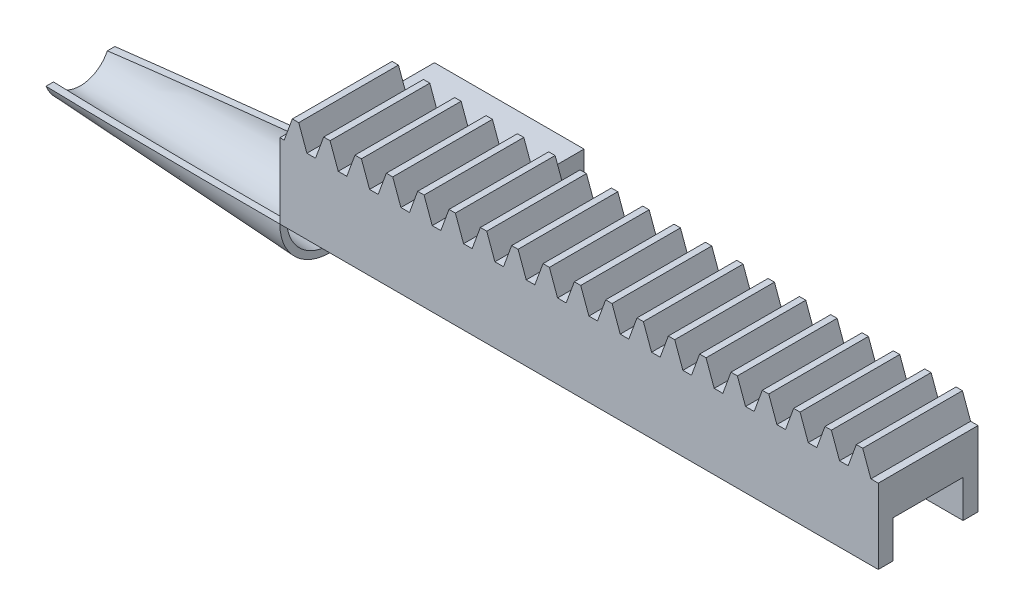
ISO-10303-21;
HEADER;
FILE_DESCRIPTION(('STEP AP214'),'2;1');
FILE_NAME('part.step','',(''),(''),'','','');
FILE_SCHEMA(('AUTOMOTIVE_DESIGN { 1 0 10303 214 1 1 1 1 }'));
ENDSEC;
DATA;
#1=APPLICATION_CONTEXT('core data for automotive mechanical design processes');
#2=APPLICATION_PROTOCOL_DEFINITION('international standard','automotive_design',2000,#1);
#3=PRODUCT_CONTEXT('',#1,'mechanical');
#4=PRODUCT('Part','Part','',(#3));
#5=PRODUCT_RELATED_PRODUCT_CATEGORY('part','',(#4));
#6=PRODUCT_DEFINITION_FORMATION('','',#4);
#7=PRODUCT_DEFINITION_CONTEXT('part definition',#1,'design');
#8=PRODUCT_DEFINITION('design','',#6,#7);
#9=PRODUCT_DEFINITION_SHAPE('','',#8);
#10=(LENGTH_UNIT() NAMED_UNIT(*) SI_UNIT(.MILLI.,.METRE.));
#11=(NAMED_UNIT(*) PLANE_ANGLE_UNIT() SI_UNIT($,.RADIAN.));
#12=(NAMED_UNIT(*) SI_UNIT($,.STERADIAN.) SOLID_ANGLE_UNIT());
#13=UNCERTAINTY_MEASURE_WITH_UNIT(LENGTH_MEASURE(1.E-05),#10,'distance_accuracy_value','');
#14=(GEOMETRIC_REPRESENTATION_CONTEXT(3) GLOBAL_UNCERTAINTY_ASSIGNED_CONTEXT((#13)) GLOBAL_UNIT_ASSIGNED_CONTEXT((#10,
#11,#12)) REPRESENTATION_CONTEXT('',''));
#15=CARTESIAN_POINT('',(0.,0.,0.));
#16=DIRECTION('',(0.,0.,1.));
#17=DIRECTION('',(1.,0.,0.));
#18=AXIS2_PLACEMENT_3D('',#15,#16,#17);
#19=CARTESIAN_POINT('',(0.,-7.5,-20.));
#20=DIRECTION('',(-0.0523359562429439,0.998629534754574,0.));
#21=DIRECTION('',(-0.998629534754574,-0.052335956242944,0.));
#22=AXIS2_PLACEMENT_3D('',#19,#20,#21);
#23=PLANE('',#22);
#24=DIRECTION('',(0.,0.,-1.));
#25=VECTOR('',#24,1.);
#26=CARTESIAN_POINT('',(0.,-7.5,-20.));
#27=LINE('',#26,#25);
#28=CARTESIAN_POINT('',(0.,-7.5,0.));
#29=VERTEX_POINT('',#28);
#30=CARTESIAN_POINT('',(0.,-7.5,-1.37961103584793));
#31=VERTEX_POINT('',#30);
#32=EDGE_CURVE('E100',#29,#31,#27,.T.);
#33=ORIENTED_EDGE('',*,*,#32,.T.);
#34=CARTESIAN_POINT('',(0.000200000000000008,-7.49998951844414,-1.37960055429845));
#35=CARTESIAN_POINT('',(-1.36137483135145,-7.57134663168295,-1.45096092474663));
#36=CARTESIAN_POINT('',(-2.72290402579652,-7.64270135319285,-1.52319838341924));
#37=CARTESIAN_POINT('',(-5.44585708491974,-7.78540527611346,-1.6695817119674));
#38=CARTESIAN_POINT('',(-6.80728094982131,-7.85675447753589,-1.74372757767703));
#39=CARTESIAN_POINT('',(-9.52997438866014,-7.99944479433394,-1.89408000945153));
#40=CARTESIAN_POINT('',(-10.8912439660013,-8.07078590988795,-1.97028651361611));
#41=CARTESIAN_POINT('',(-13.6136589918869,-8.2134616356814,-2.12494784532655));
#42=CARTESIAN_POINT('',(-14.9748044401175,-8.28479624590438,-2.20340267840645));
#43=CARTESIAN_POINT('',(-19.1430533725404,-8.50324491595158,-2.44742121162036));
#44=CARTESIAN_POINT('',(-21.9499255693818,-8.65034685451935,-2.61697234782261));
#45=CARTESIAN_POINT('',(-27.5628664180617,-8.94450861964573,-2.96880656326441));
#46=CARTESIAN_POINT('',(-30.3689350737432,-9.09156844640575,-3.15108958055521));
#47=CARTESIAN_POINT('',(-34.5773070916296,-9.31211987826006,-3.43663537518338));
#48=CARTESIAN_POINT('',(-35.980020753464,-9.38563298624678,-3.53384081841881));
#49=CARTESIAN_POINT('',(-38.7851184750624,-9.53264192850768,-3.73288747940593));
#50=CARTESIAN_POINT('',(-40.187502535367,-9.60613776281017,-3.83472868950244));
#51=CARTESIAN_POINT('',(-42.9919008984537,-9.75311005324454,-4.04377072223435));
#52=CARTESIAN_POINT('',(-44.3939151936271,-9.82658650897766,-4.15097164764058));
#53=CARTESIAN_POINT('',(-46.4965688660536,-9.93678191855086,-4.31650375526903));
#54=CARTESIAN_POINT('',(-47.1973941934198,-9.97351061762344,-4.37246974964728));
#55=CARTESIAN_POINT('',(-48.5989056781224,-10.0469607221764,-4.48613174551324));
#56=CARTESIAN_POINT('',(-49.2995918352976,-10.0836821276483,-4.54382774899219));
#57=CARTESIAN_POINT('',(-50.0002,-10.1203994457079,-4.60246528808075));
#58=B_SPLINE_CURVE_WITH_KNOTS('',3,(#34,#35,#36,#37,#38,#39,#40,#41,#42,#43,#44,#45,#46,#47,#48,
#49,#50,#51,#52,#53,#54,#55,#56,#57),.UNSPECIFIED.,.F.,.F.,(4,2,2,2,2,2,2,2,2,2,2,4),(0.,
4.09592865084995,8.1918483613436,12.287645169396,16.3834520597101,24.8309294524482,
33.2783657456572,37.5023538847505,41.7263350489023,45.9503972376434,48.0624407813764,
50.1744867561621),.UNSPECIFIED.);
#59=CARTESIAN_POINT('',(-50.,-10.1203889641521,-4.6024485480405));
#60=VERTEX_POINT('',#59);
#61=EDGE_CURVE('E60',#31,#60,#58,.T.);
#62=ORIENTED_EDGE('',*,*,#61,.T.);
#63=DIRECTION('',(0.,0.,1.));
#64=VECTOR('',#63,1.);
#65=CARTESIAN_POINT('',(-50.,-10.1203889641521,-20.));
#66=LINE('',#65,#64);
#67=CARTESIAN_POINT('',(-50.,-10.1203889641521,-3.10128847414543));
#68=VERTEX_POINT('',#67);
#69=EDGE_CURVE('E93',#68,#60,#66,.F.);
#70=ORIENTED_EDGE('',*,*,#69,.F.);
#71=CARTESIAN_POINT('',(-50.,-10.1203889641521,-3.10128847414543));
#72=CARTESIAN_POINT('',(-48.8361454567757,-10.0593939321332,-3.01288233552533));
#73=CARTESIAN_POINT('',(-47.6721654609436,-9.99839232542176,-2.92614760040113));
#74=CARTESIAN_POINT('',(-45.3439857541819,-9.87637759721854,-2.75570995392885));
#75=CARTESIAN_POINT('',(-44.1797860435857,-9.81536447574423,-2.67200703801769));
#76=CARTESIAN_POINT('',(-40.6869481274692,-9.63231259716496,-2.42498263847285));
#77=CARTESIAN_POINT('',(-38.3580218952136,-9.51025874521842,-2.26574178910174));
#78=CARTESIAN_POINT('',(-33.0279205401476,-9.23091996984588,-1.91165246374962));
#79=CARTESIAN_POINT('',(-30.0265491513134,-9.07362476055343,-1.71977726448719));
#80=CARTESIAN_POINT('',(-24.0230508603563,-8.75899474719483,-1.3481460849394));
#81=CARTESIAN_POINT('',(-21.0209239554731,-8.60165994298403,-1.16839014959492));
#82=CARTESIAN_POINT('',(-15.0159177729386,-8.28695090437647,-0.818959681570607));
#83=CARTESIAN_POINT('',(-12.0130384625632,-8.1295766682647,-0.649285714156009));
#84=CARTESIAN_POINT('',(-7.5083807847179,-7.89349756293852,-0.401204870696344));
#85=CARTESIAN_POINT('',(-6.00677793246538,-7.81480189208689,-0.319583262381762));
#86=CARTESIAN_POINT('',(-3.00346614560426,-7.65740499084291,-0.158333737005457));
#87=CARTESIAN_POINT('',(-1.50175721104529,-7.57870376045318,-0.0787058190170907));
#88=CARTESIAN_POINT('',(0.,-7.5,0.));
#89=B_SPLINE_CURVE_WITH_KNOTS('',3,(#71,#72,#73,#74,#75,#76,#77,#78,#79,#80,#81,#82,#83,#84,#85,
#86,#87,#88),.UNSPECIFIED.,.F.,.F.,(4,2,2,2,2,2,2,2,4),(0.,3.50639697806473,7.01278867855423,
14.0254237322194,23.0602194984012,32.0950487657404,41.1303841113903,45.648014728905,
50.1656432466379),.UNSPECIFIED.);
#90=EDGE_CURVE('E53',#68,#29,#89,.T.);
#91=ORIENTED_EDGE('',*,*,#90,.T.);
#92=EDGE_LOOP('',(#33,#62,#70,#91));
#93=FACE_BOUND('',#92,.T.);
#94=ADVANCED_FACE('F44',(#93),#23,.T.);
#95=CARTESIAN_POINT('',(0.,-7.5,-10.));
#96=DIRECTION('',(1.,0.,0.));
#97=DIRECTION('',(0.,0.,1.));
#98=AXIS2_PLACEMENT_3D('',#95,#96,#97);
#99=CONICAL_SURFACE('',#98,10.,0.05235987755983);
#100=CARTESIAN_POINT('',(0.,-7.5,-10.));
#101=DIRECTION('',(-1.,0.,0.));
#102=DIRECTION('',(0.,0.,1.));
#103=AXIS2_PLACEMENT_3D('',#100,#101,#102);
#104=CIRCLE('',#103,10.);
#105=CARTESIAN_POINT('',(0.,-7.5,-20.));
#106=VERTEX_POINT('',#105);
#107=EDGE_CURVE('E152',#106,#29,#104,.T.);
#108=ORIENTED_EDGE('',*,*,#107,.T.);
#109=ORIENTED_EDGE('',*,*,#90,.F.);
#110=CARTESIAN_POINT('',(-50.,-7.5,-10.));
#111=DIRECTION('',(-1.,0.,0.));
#112=DIRECTION('',(0.,0.,1.));
#113=AXIS2_PLACEMENT_3D('',#110,#111,#112);
#114=CIRCLE('',#113,7.37961103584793);
#115=CARTESIAN_POINT('',(-50.,-10.1203889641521,-16.8987115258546));
#116=VERTEX_POINT('',#115);
#117=EDGE_CURVE('E99',#116,#68,#114,.T.);
#118=ORIENTED_EDGE('',*,*,#117,.F.);
#119=CARTESIAN_POINT('',(-50.,-10.1203889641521,-16.8987115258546));
#120=CARTESIAN_POINT('',(-48.8361454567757,-10.0593939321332,-16.9871176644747));
#121=CARTESIAN_POINT('',(-47.6721654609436,-9.99839232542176,-17.0738523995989));
#122=CARTESIAN_POINT('',(-45.3439857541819,-9.87637759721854,-17.2442900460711));
#123=CARTESIAN_POINT('',(-44.1797860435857,-9.81536447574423,-17.3279929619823));
#124=CARTESIAN_POINT('',(-40.6869481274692,-9.63231259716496,-17.5750173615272));
#125=CARTESIAN_POINT('',(-38.3580218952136,-9.51025874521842,-17.7342582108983));
#126=CARTESIAN_POINT('',(-33.0279205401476,-9.23091996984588,-18.0883475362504));
#127=CARTESIAN_POINT('',(-30.0265491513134,-9.07362476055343,-18.2802227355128));
#128=CARTESIAN_POINT('',(-24.0230508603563,-8.75899474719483,-18.6518539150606));
#129=CARTESIAN_POINT('',(-21.0209239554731,-8.60165994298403,-18.8316098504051));
#130=CARTESIAN_POINT('',(-15.0159177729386,-8.28695090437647,-19.1810403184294));
#131=CARTESIAN_POINT('',(-12.0130384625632,-8.1295766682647,-19.350714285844));
#132=CARTESIAN_POINT('',(-7.5083807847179,-7.89349756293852,-19.5987951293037));
#133=CARTESIAN_POINT('',(-6.00677793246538,-7.81480189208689,-19.6804167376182));
#134=CARTESIAN_POINT('',(-3.00346614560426,-7.65740499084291,-19.8416662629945));
#135=CARTESIAN_POINT('',(-1.50175721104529,-7.57870376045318,-19.9212941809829));
#136=CARTESIAN_POINT('',(0.,-7.5,-20.));
#137=B_SPLINE_CURVE_WITH_KNOTS('',3,(#119,#120,#121,#122,#123,#124,#125,#126,#127,#128,#129,
#130,#131,#132,#133,#134,#135,#136),.UNSPECIFIED.,.F.,.F.,(4,2,2,2,2,2,2,2,4),(0.,
3.50639697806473,7.01278867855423,14.0254237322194,23.0602194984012,32.0950487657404,
41.1303841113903,45.648014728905,50.1656432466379),.UNSPECIFIED.);
#138=EDGE_CURVE('E97',#116,#106,#137,.T.);
#139=ORIENTED_EDGE('',*,*,#138,.T.);
#140=EDGE_LOOP('',(#108,#109,#118,#139));
#141=FACE_BOUND('',#140,.T.);
#142=ADVANCED_FACE('F46',(#141),#99,.T.);
#143=CARTESIAN_POINT('',(-50.,-10.1203889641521,-15.3975514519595));
#144=VERTEX_POINT('',#143);
#145=EDGE_CURVE('E67',#144,#116,#66,.F.);
#146=ORIENTED_EDGE('',*,*,#145,.F.);
#147=CARTESIAN_POINT('',(-50.0002,-10.1203994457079,-15.3975347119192));
#148=CARTESIAN_POINT('',(-49.0544927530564,-10.0708370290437,-15.4766772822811));
#149=CARTESIAN_POINT('',(-48.1086447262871,-10.0212672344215,-15.5541175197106));
#150=CARTESIAN_POINT('',(-46.2167060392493,-9.92211492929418,-15.7059408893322));
#151=CARTESIAN_POINT('',(-45.2706153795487,-9.87253241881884,-15.7803240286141));
#152=CARTESIAN_POINT('',(-43.3782556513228,-9.77335804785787,-15.9263788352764));
#153=CARTESIAN_POINT('',(-42.4319865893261,-9.72376618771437,-15.998050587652));
#154=CARTESIAN_POINT('',(-40.5392673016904,-9.6245729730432,-16.1389557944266));
#155=CARTESIAN_POINT('',(-39.5928170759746,-9.5749716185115,-16.2081892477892));
#156=CARTESIAN_POINT('',(-37.0372877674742,-9.44104200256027,-16.3921406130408));
#157=CARTESIAN_POINT('',(-35.4280592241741,-9.35670590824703,-16.5047786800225));
#158=CARTESIAN_POINT('',(-32.2092308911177,-9.18801426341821,-16.7246187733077));
#159=CARTESIAN_POINT('',(-30.599631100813,-9.10365871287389,-16.8318207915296));
#160=CARTESIAN_POINT('',(-27.3801113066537,-8.93493083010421,-17.041503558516));
#161=CARTESIAN_POINT('',(-25.7701913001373,-8.85055849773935,-17.1439842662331));
#162=CARTESIAN_POINT('',(-22.5500931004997,-8.68180030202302,-17.3447959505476));
#163=CARTESIAN_POINT('',(-20.939914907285,-8.59741443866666,-17.4431269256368));
#164=CARTESIAN_POINT('',(-17.719156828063,-8.42862166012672,-17.6361153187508));
#165=CARTESIAN_POINT('',(-16.1085769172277,-8.34421474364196,-17.7307723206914));
#166=CARTESIAN_POINT('',(-12.8872266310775,-8.17539092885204,-17.9167851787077));
#167=CARTESIAN_POINT('',(-11.2764562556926,-8.09097403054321,-18.0081410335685));
#168=CARTESIAN_POINT('',(-8.05478764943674,-7.92213353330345,-18.1878738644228));
#169=CARTESIAN_POINT('',(-6.44388942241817,-7.83770993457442,-18.276250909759));
#170=CARTESIAN_POINT('',(-3.22194862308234,-7.6688551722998,-18.4502929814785));
#171=CARTESIAN_POINT('',(-1.6109060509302,-7.58442400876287,-18.5359580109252));
#172=CARTESIAN_POINT('',(0.000199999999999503,-7.49998951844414,-18.6203994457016));
#173=B_SPLINE_CURVE_WITH_KNOTS('',3,(#147,#148,#149,#150,#151,#152,#153,#154,#155,#156,#157,
#158,#159,#160,#161,#162,#163,#164,#165,#166,#167,#168,#169,#170,#171,#172),.UNSPECIFIED.,.F.,
.F.,(4,2,2,2,2,2,2,2,2,2,2,2,4),(0.,2.85091566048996,5.70182470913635,8.55264431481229,
11.4034651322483,16.2495597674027,21.0956616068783,25.9418055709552,30.7879512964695,
35.6346442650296,40.4813390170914,45.3279208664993,50.1744972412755),.UNSPECIFIED.);
#174=CARTESIAN_POINT('',(0.,-7.5,-18.6203889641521));
#175=VERTEX_POINT('',#174);
#176=EDGE_CURVE('E85',#144,#175,#173,.T.);
#177=ORIENTED_EDGE('',*,*,#176,.T.);
#178=EDGE_CURVE('E151',#175,#106,#27,.T.);
#179=ORIENTED_EDGE('',*,*,#178,.T.);
#180=ORIENTED_EDGE('',*,*,#138,.F.);
#181=EDGE_LOOP('',(#146,#177,#179,#180));
#182=FACE_BOUND('',#181,.T.);
#183=ADVANCED_FACE('F95',(#182),#23,.T.);
#184=CARTESIAN_POINT('',(-50.,-7.5,-10.));
#185=DIRECTION('',(-1.,0.,0.));
#186=DIRECTION('',(0.,0.,1.));
#187=AXIS2_PLACEMENT_3D('',#184,#185,#186);
#188=PLANE('',#187);
#189=CARTESIAN_POINT('',(-50.,-7.5,-10.));
#190=DIRECTION('',(-1.,0.,0.));
#191=DIRECTION('',(0.,0.,1.));
#192=AXIS2_PLACEMENT_3D('',#189,#190,#191);
#193=CIRCLE('',#192,6.);
#194=EDGE_CURVE('E87',#144,#60,#193,.T.);
#195=ORIENTED_EDGE('',*,*,#194,.F.);
#196=ORIENTED_EDGE('',*,*,#145,.T.);
#197=ORIENTED_EDGE('',*,*,#117,.T.);
#198=ORIENTED_EDGE('',*,*,#69,.T.);
#199=EDGE_LOOP('',(#195,#196,#197,#198));
#200=FACE_BOUND('',#199,.T.);
#201=ADVANCED_FACE('F92',(#200),#188,.T.);
#202=CARTESIAN_POINT('',(0.,-7.5,-10.));
#203=DIRECTION('',(-1.,0.,0.));
#204=DIRECTION('',(0.,0.,1.));
#205=AXIS2_PLACEMENT_3D('',#202,#203,#204);
#206=PLANE('',#205);
#207=ORIENTED_EDGE('',*,*,#178,.F.);
#208=CARTESIAN_POINT('',(0.,-7.5,-10.));
#209=DIRECTION('',(-1.,0.,0.));
#210=DIRECTION('',(0.,0.,1.));
#211=AXIS2_PLACEMENT_3D('',#208,#209,#210);
#212=CIRCLE('',#211,8.62038896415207);
#213=EDGE_CURVE('E12',#175,#31,#212,.T.);
#214=ORIENTED_EDGE('',*,*,#213,.T.);
#215=ORIENTED_EDGE('',*,*,#32,.F.);
#216=ORIENTED_EDGE('',*,*,#107,.F.);
#217=EDGE_LOOP('',(#207,#214,#215,#216));
#218=FACE_BOUND('',#217,.T.);
#219=ADVANCED_FACE('F116',(#218),#206,.F.);
#220=CARTESIAN_POINT('',(-50.,-7.5,-10.));
#221=DIRECTION('',(1.,0.,0.));
#222=DIRECTION('',(0.,0.,1.));
#223=AXIS2_PLACEMENT_3D('',#220,#221,#222);
#224=CONICAL_SURFACE('',#223,6.,0.05235987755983);
#225=ORIENTED_EDGE('',*,*,#213,.F.);
#226=ORIENTED_EDGE('',*,*,#176,.F.);
#227=ORIENTED_EDGE('',*,*,#194,.T.);
#228=ORIENTED_EDGE('',*,*,#61,.F.);
#229=EDGE_LOOP('',(#225,#226,#227,#228));
#230=FACE_BOUND('',#229,.T.);
#231=ADVANCED_FACE('F86',(#230),#224,.F.);
#232=CLOSED_SHELL('',(#94,#142,#183,#201,#219,#231));
#233=MANIFOLD_SOLID_BREP('B2',#232);
#234=CARTESIAN_POINT('',(0.,0.,-20.));
#235=DIRECTION('',(0.,-1.,0.));
#236=DIRECTION('',(0.,0.,-1.));
#237=AXIS2_PLACEMENT_3D('',#234,#235,#236);
#238=PLANE('',#237);
#239=DIRECTION('',(0.,0.,1.));
#240=VECTOR('',#239,1.);
#241=CARTESIAN_POINT('',(120.,0.,-20.));
#242=LINE('',#241,#240);
#243=CARTESIAN_POINT('',(120.,0.,-17.));
#244=VERTEX_POINT('',#243);
#245=CARTESIAN_POINT('',(120.,0.,-3.));
#246=VERTEX_POINT('',#245);
#247=EDGE_CURVE('E1319',#244,#246,#242,.T.);
#248=ORIENTED_EDGE('',*,*,#247,.T.);
#249=DIRECTION('',(1.,0.,0.));
#250=VECTOR('',#249,1.);
#251=CARTESIAN_POINT('',(0.,0.,-3.));
#252=LINE('',#251,#250);
#253=CARTESIAN_POINT('',(0.,0.,-3.));
#254=VERTEX_POINT('',#253);
#255=EDGE_CURVE('E792',#254,#246,#252,.T.);
#256=ORIENTED_EDGE('',*,*,#255,.F.);
#257=DIRECTION('',(0.,0.,1.));
#258=VECTOR('',#257,1.);
#259=CARTESIAN_POINT('',(0.,0.,-20.));
#260=LINE('',#259,#258);
#261=CARTESIAN_POINT('',(0.,0.,-17.));
#262=VERTEX_POINT('',#261);
#263=EDGE_CURVE('E1309',#262,#254,#260,.T.);
#264=ORIENTED_EDGE('',*,*,#263,.F.);
#265=DIRECTION('',(-1.,0.,0.));
#266=VECTOR('',#265,1.);
#267=CARTESIAN_POINT('',(0.,0.,-17.));
#268=LINE('',#267,#266);
#269=EDGE_CURVE('E211',#244,#262,#268,.T.);
#270=ORIENTED_EDGE('',*,*,#269,.F.);
#271=EDGE_LOOP('',(#248,#256,#264,#270));
#272=FACE_BOUND('',#271,.T.);
#273=ADVANCED_FACE('F188',(#272),#238,.T.);
#274=CARTESIAN_POINT('',(0.,12.,-20.));
#275=DIRECTION('',(0.,1.,0.));
#276=DIRECTION('',(0.,0.,1.));
#277=AXIS2_PLACEMENT_3D('',#274,#275,#276);
#278=PLANE('',#277);
#279=DIRECTION('',(0.,0.,1.));
#280=VECTOR('',#279,1.);
#281=CARTESIAN_POINT('',(110.597598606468,12.,-20.));
#282=LINE('',#281,#280);
#283=CARTESIAN_POINT('',(110.597598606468,12.,-20.));
#284=VERTEX_POINT('',#283);
#285=CARTESIAN_POINT('',(110.597598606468,12.,0.));
#286=VERTEX_POINT('',#285);
#287=EDGE_CURVE('E871',#284,#286,#282,.T.);
#288=ORIENTED_EDGE('',*,*,#287,.F.);
#289=DIRECTION('',(-1.,0.,0.));
#290=VECTOR('',#289,1.);
#291=CARTESIAN_POINT('',(0.,12.,-20.));
#292=LINE('',#291,#290);
#293=CARTESIAN_POINT('',(109.313886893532,12.,-20.));
#294=VERTEX_POINT('',#293);
#295=EDGE_CURVE('E1310',#284,#294,#292,.T.);
#296=ORIENTED_EDGE('',*,*,#295,.T.);
#297=DIRECTION('',(0.,0.,-1.));
#298=VECTOR('',#297,1.);
#299=CARTESIAN_POINT('',(109.313886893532,12.,-20.));
#300=LINE('',#299,#298);
#301=CARTESIAN_POINT('',(109.313886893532,12.,0.));
#302=VERTEX_POINT('',#301);
#303=EDGE_CURVE('E891',#302,#294,#300,.T.);
#304=ORIENTED_EDGE('',*,*,#303,.F.);
#305=DIRECTION('',(-1.,0.,0.));
#306=VECTOR('',#305,1.);
#307=CARTESIAN_POINT('',(0.,12.,0.));
#308=LINE('',#307,#306);
#309=EDGE_CURVE('E1318',#286,#302,#308,.T.);
#310=ORIENTED_EDGE('',*,*,#309,.F.);
#311=EDGE_LOOP('',(#288,#296,#304,#310));
#312=FACE_BOUND('',#311,.T.);
#313=ADVANCED_FACE('F1389',(#312),#278,.T.);
#314=DIRECTION('',(0.,0.,1.));
#315=VECTOR('',#314,1.);
#316=CARTESIAN_POINT('',(104.314413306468,12.,-20.));
#317=LINE('',#316,#315);
#318=CARTESIAN_POINT('',(104.314413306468,12.,-20.));
#319=VERTEX_POINT('',#318);
#320=CARTESIAN_POINT('',(104.314413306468,12.,0.));
#321=VERTEX_POINT('',#320);
#322=EDGE_CURVE('E895',#319,#321,#317,.T.);
#323=ORIENTED_EDGE('',*,*,#322,.F.);
#324=CARTESIAN_POINT('',(103.030701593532,12.,-20.));
#325=VERTEX_POINT('',#324);
#326=EDGE_CURVE('E1523',#319,#325,#292,.T.);
#327=ORIENTED_EDGE('',*,*,#326,.T.);
#328=DIRECTION('',(0.,0.,-1.));
#329=VECTOR('',#328,1.);
#330=CARTESIAN_POINT('',(103.030701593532,12.,-20.));
#331=LINE('',#330,#329);
#332=CARTESIAN_POINT('',(103.030701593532,12.,0.));
#333=VERTEX_POINT('',#332);
#334=EDGE_CURVE('E915',#333,#325,#331,.T.);
#335=ORIENTED_EDGE('',*,*,#334,.F.);
#336=EDGE_CURVE('E1391',#321,#333,#308,.T.);
#337=ORIENTED_EDGE('',*,*,#336,.F.);
#338=EDGE_LOOP('',(#323,#327,#335,#337));
#339=FACE_BOUND('',#338,.T.);
#340=ADVANCED_FACE('F1542',(#339),#278,.T.);
#341=DIRECTION('',(0.,0.,1.));
#342=VECTOR('',#341,1.);
#343=CARTESIAN_POINT('',(98.0312280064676,12.,-20.));
#344=LINE('',#343,#342);
#345=CARTESIAN_POINT('',(98.0312280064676,12.,-20.));
#346=VERTEX_POINT('',#345);
#347=CARTESIAN_POINT('',(98.0312280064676,12.,0.));
#348=VERTEX_POINT('',#347);
#349=EDGE_CURVE('E919',#346,#348,#344,.T.);
#350=ORIENTED_EDGE('',*,*,#349,.F.);
#351=CARTESIAN_POINT('',(96.7475162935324,12.,-20.));
#352=VERTEX_POINT('',#351);
#353=EDGE_CURVE('E1518',#346,#352,#292,.T.);
#354=ORIENTED_EDGE('',*,*,#353,.T.);
#355=DIRECTION('',(0.,0.,-1.));
#356=VECTOR('',#355,1.);
#357=CARTESIAN_POINT('',(96.7475162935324,12.,-20.));
#358=LINE('',#357,#356);
#359=CARTESIAN_POINT('',(96.7475162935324,12.,0.));
#360=VERTEX_POINT('',#359);
#361=EDGE_CURVE('E939',#360,#352,#358,.T.);
#362=ORIENTED_EDGE('',*,*,#361,.F.);
#363=EDGE_CURVE('E1392',#348,#360,#308,.T.);
#364=ORIENTED_EDGE('',*,*,#363,.F.);
#365=EDGE_LOOP('',(#350,#354,#362,#364));
#366=FACE_BOUND('',#365,.T.);
#367=ADVANCED_FACE('F1552',(#366),#278,.T.);
#368=DIRECTION('',(0.,0.,1.));
#369=VECTOR('',#368,1.);
#370=CARTESIAN_POINT('',(91.7480427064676,12.,-20.));
#371=LINE('',#370,#369);
#372=CARTESIAN_POINT('',(91.7480427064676,12.,-20.));
#373=VERTEX_POINT('',#372);
#374=CARTESIAN_POINT('',(91.7480427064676,12.,0.));
#375=VERTEX_POINT('',#374);
#376=EDGE_CURVE('E943',#373,#375,#371,.T.);
#377=ORIENTED_EDGE('',*,*,#376,.F.);
#378=CARTESIAN_POINT('',(90.4643309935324,12.,-20.));
#379=VERTEX_POINT('',#378);
#380=EDGE_CURVE('E1513',#373,#379,#292,.T.);
#381=ORIENTED_EDGE('',*,*,#380,.T.);
#382=DIRECTION('',(0.,0.,-1.));
#383=VECTOR('',#382,1.);
#384=CARTESIAN_POINT('',(90.4643309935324,12.,-20.));
#385=LINE('',#384,#383);
#386=CARTESIAN_POINT('',(90.4643309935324,12.,0.));
#387=VERTEX_POINT('',#386);
#388=EDGE_CURVE('E963',#387,#379,#385,.T.);
#389=ORIENTED_EDGE('',*,*,#388,.F.);
#390=EDGE_CURVE('E1395',#375,#387,#308,.T.);
#391=ORIENTED_EDGE('',*,*,#390,.F.);
#392=EDGE_LOOP('',(#377,#381,#389,#391));
#393=FACE_BOUND('',#392,.T.);
#394=ADVANCED_FACE('F1562',(#393),#278,.T.);
#395=DIRECTION('',(0.,0.,1.));
#396=VECTOR('',#395,1.);
#397=CARTESIAN_POINT('',(85.4648574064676,12.,-20.));
#398=LINE('',#397,#396);
#399=CARTESIAN_POINT('',(85.4648574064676,12.,-20.));
#400=VERTEX_POINT('',#399);
#401=CARTESIAN_POINT('',(85.4648574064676,12.,0.));
#402=VERTEX_POINT('',#401);
#403=EDGE_CURVE('E967',#400,#402,#398,.T.);
#404=ORIENTED_EDGE('',*,*,#403,.F.);
#405=CARTESIAN_POINT('',(84.1811456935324,12.,-20.));
#406=VERTEX_POINT('',#405);
#407=EDGE_CURVE('E1508',#400,#406,#292,.T.);
#408=ORIENTED_EDGE('',*,*,#407,.T.);
#409=DIRECTION('',(0.,0.,-1.));
#410=VECTOR('',#409,1.);
#411=CARTESIAN_POINT('',(84.1811456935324,12.,-20.));
#412=LINE('',#411,#410);
#413=CARTESIAN_POINT('',(84.1811456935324,12.,0.));
#414=VERTEX_POINT('',#413);
#415=EDGE_CURVE('E987',#414,#406,#412,.T.);
#416=ORIENTED_EDGE('',*,*,#415,.F.);
#417=EDGE_CURVE('E1398',#402,#414,#308,.T.);
#418=ORIENTED_EDGE('',*,*,#417,.F.);
#419=EDGE_LOOP('',(#404,#408,#416,#418));
#420=FACE_BOUND('',#419,.T.);
#421=ADVANCED_FACE('F1572',(#420),#278,.T.);
#422=DIRECTION('',(0.,0.,1.));
#423=VECTOR('',#422,1.);
#424=CARTESIAN_POINT('',(79.1816721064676,12.,-20.));
#425=LINE('',#424,#423);
#426=CARTESIAN_POINT('',(79.1816721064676,12.,-20.));
#427=VERTEX_POINT('',#426);
#428=CARTESIAN_POINT('',(79.1816721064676,12.,0.));
#429=VERTEX_POINT('',#428);
#430=EDGE_CURVE('E991',#427,#429,#425,.T.);
#431=ORIENTED_EDGE('',*,*,#430,.F.);
#432=CARTESIAN_POINT('',(77.8979603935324,12.,-20.));
#433=VERTEX_POINT('',#432);
#434=EDGE_CURVE('E1503',#427,#433,#292,.T.);
#435=ORIENTED_EDGE('',*,*,#434,.T.);
#436=DIRECTION('',(0.,0.,-1.));
#437=VECTOR('',#436,1.);
#438=CARTESIAN_POINT('',(77.8979603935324,12.,-20.));
#439=LINE('',#438,#437);
#440=CARTESIAN_POINT('',(77.8979603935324,12.,0.));
#441=VERTEX_POINT('',#440);
#442=EDGE_CURVE('E1011',#441,#433,#439,.T.);
#443=ORIENTED_EDGE('',*,*,#442,.F.);
#444=EDGE_CURVE('E1401',#429,#441,#308,.T.);
#445=ORIENTED_EDGE('',*,*,#444,.F.);
#446=EDGE_LOOP('',(#431,#435,#443,#445));
#447=FACE_BOUND('',#446,.T.);
#448=ADVANCED_FACE('F1582',(#447),#278,.T.);
#449=DIRECTION('',(0.,0.,1.));
#450=VECTOR('',#449,1.);
#451=CARTESIAN_POINT('',(72.8984868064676,12.,-20.));
#452=LINE('',#451,#450);
#453=CARTESIAN_POINT('',(72.8984868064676,12.,-20.));
#454=VERTEX_POINT('',#453);
#455=CARTESIAN_POINT('',(72.8984868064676,12.,0.));
#456=VERTEX_POINT('',#455);
#457=EDGE_CURVE('E1015',#454,#456,#452,.T.);
#458=ORIENTED_EDGE('',*,*,#457,.F.);
#459=CARTESIAN_POINT('',(71.6147750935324,12.,-20.));
#460=VERTEX_POINT('',#459);
#461=EDGE_CURVE('E1498',#454,#460,#292,.T.);
#462=ORIENTED_EDGE('',*,*,#461,.T.);
#463=DIRECTION('',(0.,0.,-1.));
#464=VECTOR('',#463,1.);
#465=CARTESIAN_POINT('',(71.6147750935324,12.,-20.));
#466=LINE('',#465,#464);
#467=CARTESIAN_POINT('',(71.6147750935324,12.,0.));
#468=VERTEX_POINT('',#467);
#469=EDGE_CURVE('E1035',#468,#460,#466,.T.);
#470=ORIENTED_EDGE('',*,*,#469,.F.);
#471=EDGE_CURVE('E1404',#456,#468,#308,.T.);
#472=ORIENTED_EDGE('',*,*,#471,.F.);
#473=EDGE_LOOP('',(#458,#462,#470,#472));
#474=FACE_BOUND('',#473,.T.);
#475=ADVANCED_FACE('F1592',(#474),#278,.T.);
#476=DIRECTION('',(0.,0.,1.));
#477=VECTOR('',#476,1.);
#478=CARTESIAN_POINT('',(66.6153015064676,12.,-20.));
#479=LINE('',#478,#477);
#480=CARTESIAN_POINT('',(66.6153015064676,12.,-20.));
#481=VERTEX_POINT('',#480);
#482=CARTESIAN_POINT('',(66.6153015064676,12.,0.));
#483=VERTEX_POINT('',#482);
#484=EDGE_CURVE('E1039',#481,#483,#479,.T.);
#485=ORIENTED_EDGE('',*,*,#484,.F.);
#486=CARTESIAN_POINT('',(65.3315897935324,12.,-20.));
#487=VERTEX_POINT('',#486);
#488=EDGE_CURVE('E1493',#481,#487,#292,.T.);
#489=ORIENTED_EDGE('',*,*,#488,.T.);
#490=DIRECTION('',(0.,0.,-1.));
#491=VECTOR('',#490,1.);
#492=CARTESIAN_POINT('',(65.3315897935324,12.,-20.));
#493=LINE('',#492,#491);
#494=CARTESIAN_POINT('',(65.3315897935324,12.,0.));
#495=VERTEX_POINT('',#494);
#496=EDGE_CURVE('E1059',#495,#487,#493,.T.);
#497=ORIENTED_EDGE('',*,*,#496,.F.);
#498=EDGE_CURVE('E1407',#483,#495,#308,.T.);
#499=ORIENTED_EDGE('',*,*,#498,.F.);
#500=EDGE_LOOP('',(#485,#489,#497,#499));
#501=FACE_BOUND('',#500,.T.);
#502=ADVANCED_FACE('F1602',(#501),#278,.T.);
#503=DIRECTION('',(0.,0.,1.));
#504=VECTOR('',#503,1.);
#505=CARTESIAN_POINT('',(60.3321162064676,12.,-20.));
#506=LINE('',#505,#504);
#507=CARTESIAN_POINT('',(60.3321162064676,12.,-20.));
#508=VERTEX_POINT('',#507);
#509=CARTESIAN_POINT('',(60.3321162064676,12.,0.));
#510=VERTEX_POINT('',#509);
#511=EDGE_CURVE('E1063',#508,#510,#506,.T.);
#512=ORIENTED_EDGE('',*,*,#511,.F.);
#513=CARTESIAN_POINT('',(59.0484044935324,12.,-20.));
#514=VERTEX_POINT('',#513);
#515=EDGE_CURVE('E1488',#508,#514,#292,.T.);
#516=ORIENTED_EDGE('',*,*,#515,.T.);
#517=DIRECTION('',(0.,0.,-1.));
#518=VECTOR('',#517,1.);
#519=CARTESIAN_POINT('',(59.0484044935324,12.,-20.));
#520=LINE('',#519,#518);
#521=CARTESIAN_POINT('',(59.0484044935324,12.,0.));
#522=VERTEX_POINT('',#521);
#523=EDGE_CURVE('E1083',#522,#514,#520,.T.);
#524=ORIENTED_EDGE('',*,*,#523,.F.);
#525=EDGE_CURVE('E1410',#510,#522,#308,.T.);
#526=ORIENTED_EDGE('',*,*,#525,.F.);
#527=EDGE_LOOP('',(#512,#516,#524,#526));
#528=FACE_BOUND('',#527,.T.);
#529=ADVANCED_FACE('F1612',(#528),#278,.T.);
#530=DIRECTION('',(0.,0.,1.));
#531=VECTOR('',#530,1.);
#532=CARTESIAN_POINT('',(54.0489309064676,12.,-20.));
#533=LINE('',#532,#531);
#534=CARTESIAN_POINT('',(54.0489309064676,12.,-20.));
#535=VERTEX_POINT('',#534);
#536=CARTESIAN_POINT('',(54.0489309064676,12.,0.));
#537=VERTEX_POINT('',#536);
#538=EDGE_CURVE('E1087',#535,#537,#533,.T.);
#539=ORIENTED_EDGE('',*,*,#538,.F.);
#540=CARTESIAN_POINT('',(52.7652191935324,12.,-20.));
#541=VERTEX_POINT('',#540);
#542=EDGE_CURVE('E1483',#535,#541,#292,.T.);
#543=ORIENTED_EDGE('',*,*,#542,.T.);
#544=DIRECTION('',(0.,0.,-1.));
#545=VECTOR('',#544,1.);
#546=CARTESIAN_POINT('',(52.7652191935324,12.,-20.));
#547=LINE('',#546,#545);
#548=CARTESIAN_POINT('',(52.7652191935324,12.,0.));
#549=VERTEX_POINT('',#548);
#550=EDGE_CURVE('E1107',#549,#541,#547,.T.);
#551=ORIENTED_EDGE('',*,*,#550,.F.);
#552=EDGE_CURVE('E1413',#537,#549,#308,.T.);
#553=ORIENTED_EDGE('',*,*,#552,.F.);
#554=EDGE_LOOP('',(#539,#543,#551,#553));
#555=FACE_BOUND('',#554,.T.);
#556=ADVANCED_FACE('F1622',(#555),#278,.T.);
#557=DIRECTION('',(0.,0.,1.));
#558=VECTOR('',#557,1.);
#559=CARTESIAN_POINT('',(47.7657456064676,12.,-20.));
#560=LINE('',#559,#558);
#561=CARTESIAN_POINT('',(47.7657456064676,12.,-20.));
#562=VERTEX_POINT('',#561);
#563=CARTESIAN_POINT('',(47.7657456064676,12.,0.));
#564=VERTEX_POINT('',#563);
#565=EDGE_CURVE('E1111',#562,#564,#560,.T.);
#566=ORIENTED_EDGE('',*,*,#565,.F.);
#567=CARTESIAN_POINT('',(46.4820338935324,12.,-20.));
#568=VERTEX_POINT('',#567);
#569=EDGE_CURVE('E1478',#562,#568,#292,.T.);
#570=ORIENTED_EDGE('',*,*,#569,.T.);
#571=DIRECTION('',(0.,0.,-1.));
#572=VECTOR('',#571,1.);
#573=CARTESIAN_POINT('',(46.4820338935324,12.,-20.));
#574=LINE('',#573,#572);
#575=CARTESIAN_POINT('',(46.4820338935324,12.,0.));
#576=VERTEX_POINT('',#575);
#577=EDGE_CURVE('E1131',#576,#568,#574,.T.);
#578=ORIENTED_EDGE('',*,*,#577,.F.);
#579=EDGE_CURVE('E1416',#564,#576,#308,.T.);
#580=ORIENTED_EDGE('',*,*,#579,.F.);
#581=EDGE_LOOP('',(#566,#570,#578,#580));
#582=FACE_BOUND('',#581,.T.);
#583=ADVANCED_FACE('F1632',(#582),#278,.T.);
#584=DIRECTION('',(0.,0.,1.));
#585=VECTOR('',#584,1.);
#586=CARTESIAN_POINT('',(41.4825603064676,12.,-20.));
#587=LINE('',#586,#585);
#588=CARTESIAN_POINT('',(41.4825603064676,12.,-20.));
#589=VERTEX_POINT('',#588);
#590=CARTESIAN_POINT('',(41.4825603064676,12.,0.));
#591=VERTEX_POINT('',#590);
#592=EDGE_CURVE('E1135',#589,#591,#587,.T.);
#593=ORIENTED_EDGE('',*,*,#592,.F.);
#594=CARTESIAN_POINT('',(40.1988485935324,12.,-20.));
#595=VERTEX_POINT('',#594);
#596=EDGE_CURVE('E1473',#589,#595,#292,.T.);
#597=ORIENTED_EDGE('',*,*,#596,.T.);
#598=DIRECTION('',(0.,0.,-1.));
#599=VECTOR('',#598,1.);
#600=CARTESIAN_POINT('',(40.1988485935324,12.,-20.));
#601=LINE('',#600,#599);
#602=CARTESIAN_POINT('',(40.1988485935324,12.,0.));
#603=VERTEX_POINT('',#602);
#604=EDGE_CURVE('E1155',#603,#595,#601,.T.);
#605=ORIENTED_EDGE('',*,*,#604,.F.);
#606=EDGE_CURVE('E1419',#591,#603,#308,.T.);
#607=ORIENTED_EDGE('',*,*,#606,.F.);
#608=EDGE_LOOP('',(#593,#597,#605,#607));
#609=FACE_BOUND('',#608,.T.);
#610=ADVANCED_FACE('F1642',(#609),#278,.T.);
#611=DIRECTION('',(0.,0.,1.));
#612=VECTOR('',#611,1.);
#613=CARTESIAN_POINT('',(35.1993750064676,12.,-20.));
#614=LINE('',#613,#612);
#615=CARTESIAN_POINT('',(35.1993750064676,12.,-20.));
#616=VERTEX_POINT('',#615);
#617=CARTESIAN_POINT('',(35.1993750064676,12.,0.));
#618=VERTEX_POINT('',#617);
#619=EDGE_CURVE('E1159',#616,#618,#614,.T.);
#620=ORIENTED_EDGE('',*,*,#619,.F.);
#621=CARTESIAN_POINT('',(33.9156632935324,12.,-20.));
#622=VERTEX_POINT('',#621);
#623=EDGE_CURVE('E1468',#616,#622,#292,.T.);
#624=ORIENTED_EDGE('',*,*,#623,.T.);
#625=DIRECTION('',(0.,0.,-1.));
#626=VECTOR('',#625,1.);
#627=CARTESIAN_POINT('',(33.9156632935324,12.,-20.));
#628=LINE('',#627,#626);
#629=CARTESIAN_POINT('',(33.9156632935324,12.,0.));
#630=VERTEX_POINT('',#629);
#631=EDGE_CURVE('E1179',#630,#622,#628,.T.);
#632=ORIENTED_EDGE('',*,*,#631,.F.);
#633=EDGE_CURVE('E1422',#618,#630,#308,.T.);
#634=ORIENTED_EDGE('',*,*,#633,.F.);
#635=EDGE_LOOP('',(#620,#624,#632,#634));
#636=FACE_BOUND('',#635,.T.);
#637=ADVANCED_FACE('F1652',(#636),#278,.T.);
#638=DIRECTION('',(0.,0.,1.));
#639=VECTOR('',#638,1.);
#640=CARTESIAN_POINT('',(28.9161897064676,12.,-20.));
#641=LINE('',#640,#639);
#642=CARTESIAN_POINT('',(28.9161897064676,12.,-20.));
#643=VERTEX_POINT('',#642);
#644=CARTESIAN_POINT('',(28.9161897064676,12.,0.));
#645=VERTEX_POINT('',#644);
#646=EDGE_CURVE('E1183',#643,#645,#641,.T.);
#647=ORIENTED_EDGE('',*,*,#646,.F.);
#648=CARTESIAN_POINT('',(27.6324779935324,12.,-20.));
#649=VERTEX_POINT('',#648);
#650=EDGE_CURVE('E1463',#643,#649,#292,.T.);
#651=ORIENTED_EDGE('',*,*,#650,.T.);
#652=DIRECTION('',(0.,0.,-1.));
#653=VECTOR('',#652,1.);
#654=CARTESIAN_POINT('',(27.6324779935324,12.,-20.));
#655=LINE('',#654,#653);
#656=CARTESIAN_POINT('',(27.6324779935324,12.,0.));
#657=VERTEX_POINT('',#656);
#658=EDGE_CURVE('E1203',#657,#649,#655,.T.);
#659=ORIENTED_EDGE('',*,*,#658,.F.);
#660=EDGE_CURVE('E1425',#645,#657,#308,.T.);
#661=ORIENTED_EDGE('',*,*,#660,.F.);
#662=EDGE_LOOP('',(#647,#651,#659,#661));
#663=FACE_BOUND('',#662,.T.);
#664=ADVANCED_FACE('F1662',(#663),#278,.T.);
#665=DIRECTION('',(0.,0.,1.));
#666=VECTOR('',#665,1.);
#667=CARTESIAN_POINT('',(22.6330044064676,12.,-20.));
#668=LINE('',#667,#666);
#669=CARTESIAN_POINT('',(22.6330044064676,12.,-20.));
#670=VERTEX_POINT('',#669);
#671=CARTESIAN_POINT('',(22.6330044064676,12.,0.));
#672=VERTEX_POINT('',#671);
#673=EDGE_CURVE('E1207',#670,#672,#668,.T.);
#674=ORIENTED_EDGE('',*,*,#673,.F.);
#675=CARTESIAN_POINT('',(21.3492926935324,12.,-20.));
#676=VERTEX_POINT('',#675);
#677=EDGE_CURVE('E1458',#670,#676,#292,.T.);
#678=ORIENTED_EDGE('',*,*,#677,.T.);
#679=DIRECTION('',(0.,0.,-1.));
#680=VECTOR('',#679,1.);
#681=CARTESIAN_POINT('',(21.3492926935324,12.,-20.));
#682=LINE('',#681,#680);
#683=CARTESIAN_POINT('',(21.3492926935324,12.,0.));
#684=VERTEX_POINT('',#683);
#685=EDGE_CURVE('E1227',#684,#676,#682,.T.);
#686=ORIENTED_EDGE('',*,*,#685,.F.);
#687=EDGE_CURVE('E1428',#672,#684,#308,.T.);
#688=ORIENTED_EDGE('',*,*,#687,.F.);
#689=EDGE_LOOP('',(#674,#678,#686,#688));
#690=FACE_BOUND('',#689,.T.);
#691=ADVANCED_FACE('F1672',(#690),#278,.T.);
#692=DIRECTION('',(0.,0.,1.));
#693=VECTOR('',#692,1.);
#694=CARTESIAN_POINT('',(16.3498191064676,12.,-20.));
#695=LINE('',#694,#693);
#696=CARTESIAN_POINT('',(16.3498191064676,12.,-20.));
#697=VERTEX_POINT('',#696);
#698=CARTESIAN_POINT('',(16.3498191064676,12.,0.));
#699=VERTEX_POINT('',#698);
#700=EDGE_CURVE('E1231',#697,#699,#695,.T.);
#701=ORIENTED_EDGE('',*,*,#700,.F.);
#702=CARTESIAN_POINT('',(15.0661073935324,12.,-20.));
#703=VERTEX_POINT('',#702);
#704=EDGE_CURVE('E1453',#697,#703,#292,.T.);
#705=ORIENTED_EDGE('',*,*,#704,.T.);
#706=DIRECTION('',(0.,0.,-1.));
#707=VECTOR('',#706,1.);
#708=CARTESIAN_POINT('',(15.0661073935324,12.,-20.));
#709=LINE('',#708,#707);
#710=CARTESIAN_POINT('',(15.0661073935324,12.,0.));
#711=VERTEX_POINT('',#710);
#712=EDGE_CURVE('E1251',#711,#703,#709,.T.);
#713=ORIENTED_EDGE('',*,*,#712,.F.);
#714=EDGE_CURVE('E1431',#699,#711,#308,.T.);
#715=ORIENTED_EDGE('',*,*,#714,.F.);
#716=EDGE_LOOP('',(#701,#705,#713,#715));
#717=FACE_BOUND('',#716,.T.);
#718=ADVANCED_FACE('F1682',(#717),#278,.T.);
#719=DIRECTION('',(0.,0.,1.));
#720=VECTOR('',#719,1.);
#721=CARTESIAN_POINT('',(10.0666338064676,12.,-20.));
#722=LINE('',#721,#720);
#723=CARTESIAN_POINT('',(10.0666338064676,12.,-20.));
#724=VERTEX_POINT('',#723);
#725=CARTESIAN_POINT('',(10.0666338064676,12.,0.));
#726=VERTEX_POINT('',#725);
#727=EDGE_CURVE('E1255',#724,#726,#722,.T.);
#728=ORIENTED_EDGE('',*,*,#727,.F.);
#729=CARTESIAN_POINT('',(8.78292209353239,12.,-20.));
#730=VERTEX_POINT('',#729);
#731=EDGE_CURVE('E1452',#724,#730,#292,.T.);
#732=ORIENTED_EDGE('',*,*,#731,.T.);
#733=DIRECTION('',(0.,0.,-1.));
#734=VECTOR('',#733,1.);
#735=CARTESIAN_POINT('',(8.78292209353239,12.,-20.));
#736=LINE('',#735,#734);
#737=CARTESIAN_POINT('',(8.78292209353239,12.,0.));
#738=VERTEX_POINT('',#737);
#739=EDGE_CURVE('E1275',#738,#730,#736,.T.);
#740=ORIENTED_EDGE('',*,*,#739,.F.);
#741=EDGE_CURVE('E1434',#726,#738,#308,.T.);
#742=ORIENTED_EDGE('',*,*,#741,.F.);
#743=EDGE_LOOP('',(#728,#732,#740,#742));
#744=FACE_BOUND('',#743,.T.);
#745=ADVANCED_FACE('F1692',(#744),#278,.T.);
#746=DIRECTION('',(0.,0.,1.));
#747=VECTOR('',#746,1.);
#748=CARTESIAN_POINT('',(3.78344850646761,12.,-20.));
#749=LINE('',#748,#747);
#750=CARTESIAN_POINT('',(3.78344850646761,12.,-20.));
#751=VERTEX_POINT('',#750);
#752=CARTESIAN_POINT('',(3.78344850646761,12.,0.));
#753=VERTEX_POINT('',#752);
#754=EDGE_CURVE('E1279',#751,#753,#749,.T.);
#755=ORIENTED_EDGE('',*,*,#754,.F.);
#756=CARTESIAN_POINT('',(2.49973679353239,12.,-20.));
#757=VERTEX_POINT('',#756);
#758=EDGE_CURVE('E1306',#751,#757,#292,.T.);
#759=ORIENTED_EDGE('',*,*,#758,.T.);
#760=DIRECTION('',(0.,0.,-1.));
#761=VECTOR('',#760,1.);
#762=CARTESIAN_POINT('',(2.49973679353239,12.,-20.));
#763=LINE('',#762,#761);
#764=CARTESIAN_POINT('',(2.49973679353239,12.,0.));
#765=VERTEX_POINT('',#764);
#766=EDGE_CURVE('E1295',#765,#757,#763,.T.);
#767=ORIENTED_EDGE('',*,*,#766,.F.);
#768=EDGE_CURVE('E1315',#753,#765,#308,.T.);
#769=ORIENTED_EDGE('',*,*,#768,.F.);
#770=EDGE_LOOP('',(#755,#759,#767,#769));
#771=FACE_BOUND('',#770,.T.);
#772=ADVANCED_FACE('F1449',(#771),#278,.T.);
#773=CARTESIAN_POINT('',(0.,0.,-20.));
#774=DIRECTION('',(-1.,0.,0.));
#775=DIRECTION('',(0.,0.,1.));
#776=AXIS2_PLACEMENT_3D('',#773,#774,#775);
#777=PLANE('',#776);
#778=DIRECTION('',(0.,0.,1.));
#779=VECTOR('',#778,1.);
#780=CARTESIAN_POINT('',(0.,7.5,-20.));
#781=LINE('',#780,#779);
#782=CARTESIAN_POINT('',(0.,7.5,-20.));
#783=VERTEX_POINT('',#782);
#784=CARTESIAN_POINT('',(0.,7.5,0.));
#785=VERTEX_POINT('',#784);
#786=EDGE_CURVE('E1293',#783,#785,#781,.T.);
#787=ORIENTED_EDGE('',*,*,#786,.F.);
#788=DIRECTION('',(0.,-1.,0.));
#789=VECTOR('',#788,1.);
#790=CARTESIAN_POINT('',(0.,0.,-20.));
#791=LINE('',#790,#789);
#792=CARTESIAN_POINT('',(0.,5.01923788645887,-20.));
#793=VERTEX_POINT('',#792);
#794=EDGE_CURVE('E1299',#783,#793,#791,.T.);
#795=ORIENTED_EDGE('',*,*,#794,.T.);
#796=DIRECTION('',(0.,0.,-1.));
#797=VECTOR('',#796,1.);
#798=CARTESIAN_POINT('',(0.,5.01923788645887,-20.));
#799=LINE('',#798,#797);
#800=CARTESIAN_POINT('',(0.,5.01923788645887,-30.9999999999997));
#801=VERTEX_POINT('',#800);
#802=EDGE_CURVE('E784',#793,#801,#799,.T.);
#803=ORIENTED_EDGE('',*,*,#802,.T.);
#804=DIRECTION('',(0.,-1.,0.));
#805=VECTOR('',#804,1.);
#806=CARTESIAN_POINT('',(0.,5.01923788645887,-30.9999999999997));
#807=LINE('',#806,#805);
#808=CARTESIAN_POINT('',(0.,-3.48076211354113,-30.9999999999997));
#809=VERTEX_POINT('',#808);
#810=EDGE_CURVE('E752',#801,#809,#807,.T.);
#811=ORIENTED_EDGE('',*,*,#810,.T.);
#812=DIRECTION('',(0.,0.,1.));
#813=VECTOR('',#812,1.);
#814=CARTESIAN_POINT('',(0.,-3.48076211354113,-30.9999999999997));
#815=LINE('',#814,#813);
#816=CARTESIAN_POINT('',(0.,-3.48076211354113,-23.9999999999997));
#817=VERTEX_POINT('',#816);
#818=EDGE_CURVE('E787',#809,#817,#815,.T.);
#819=ORIENTED_EDGE('',*,*,#818,.T.);
#820=DIRECTION('',(0.,1.,0.));
#821=VECTOR('',#820,1.);
#822=CARTESIAN_POINT('',(0.,-3.48076211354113,-23.9999999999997));
#823=LINE('',#822,#821);
#824=CARTESIAN_POINT('',(0.,0.0192378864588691,-23.9999999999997));
#825=VERTEX_POINT('',#824);
#826=EDGE_CURVE('E774',#817,#825,#823,.T.);
#827=ORIENTED_EDGE('',*,*,#826,.T.);
#828=DIRECTION('',(0.,0.,1.));
#829=VECTOR('',#828,1.);
#830=CARTESIAN_POINT('',(0.,0.0192378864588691,-23.9999999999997));
#831=LINE('',#830,#829);
#832=CARTESIAN_POINT('',(0.,0.0192378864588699,-20.));
#833=VERTEX_POINT('',#832);
#834=EDGE_CURVE('E203',#825,#833,#831,.T.);
#835=ORIENTED_EDGE('',*,*,#834,.T.);
#836=CARTESIAN_POINT('',(0.,-7.5,-20.));
#837=VERTEX_POINT('',#836);
#838=EDGE_CURVE('E1303',#833,#837,#791,.T.);
#839=ORIENTED_EDGE('',*,*,#838,.T.);
#840=DIRECTION('',(0.,0.,-1.));
#841=VECTOR('',#840,1.);
#842=CARTESIAN_POINT('',(0.,-7.5,-20.));
#843=LINE('',#842,#841);
#844=CARTESIAN_POINT('',(0.,-7.5,-17.));
#845=VERTEX_POINT('',#844);
#846=EDGE_CURVE('E822',#845,#837,#843,.T.);
#847=ORIENTED_EDGE('',*,*,#846,.F.);
#848=DIRECTION('',(0.,1.,0.));
#849=VECTOR('',#848,1.);
#850=CARTESIAN_POINT('',(0.,-7.5,-17.));
#851=LINE('',#850,#849);
#852=EDGE_CURVE('E828',#845,#262,#851,.T.);
#853=ORIENTED_EDGE('',*,*,#852,.T.);
#854=ORIENTED_EDGE('',*,*,#263,.T.);
#855=DIRECTION('',(0.,1.,0.));
#856=VECTOR('',#855,1.);
#857=CARTESIAN_POINT('',(0.,-7.5,-3.));
#858=LINE('',#857,#856);
#859=CARTESIAN_POINT('',(0.,-7.5,-3.));
#860=VERTEX_POINT('',#859);
#861=EDGE_CURVE('E815',#860,#254,#858,.T.);
#862=ORIENTED_EDGE('',*,*,#861,.F.);
#863=DIRECTION('',(0.,0.,-1.));
#864=VECTOR('',#863,1.);
#865=CARTESIAN_POINT('',(0.,-7.5,0.));
#866=LINE('',#865,#864);
#867=CARTESIAN_POINT('',(0.,-7.5,0.));
#868=VERTEX_POINT('',#867);
#869=EDGE_CURVE('E800',#868,#860,#866,.T.);
#870=ORIENTED_EDGE('',*,*,#869,.F.);
#871=DIRECTION('',(0.,-1.,0.));
#872=VECTOR('',#871,1.);
#873=CARTESIAN_POINT('',(0.,0.,0.));
#874=LINE('',#873,#872);
#875=EDGE_CURVE('E1298',#785,#868,#874,.T.);
#876=ORIENTED_EDGE('',*,*,#875,.F.);
#877=EDGE_LOOP('',(#787,#795,#803,#811,#819,#827,#835,#839,#847,#853,#854,#862,#870,#876));
#878=FACE_BOUND('',#877,.T.);
#879=ADVANCED_FACE('F190',(#878),#777,.T.);
#880=DIRECTION('',(0.,0.,1.));
#881=VECTOR('',#880,1.);
#882=CARTESIAN_POINT('',(116.880783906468,12.,-20.));
#883=LINE('',#882,#881);
#884=CARTESIAN_POINT('',(116.880783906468,12.,-20.));
#885=VERTEX_POINT('',#884);
#886=CARTESIAN_POINT('',(116.880783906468,12.,0.));
#887=VERTEX_POINT('',#886);
#888=EDGE_CURVE('E847',#885,#887,#883,.T.);
#889=ORIENTED_EDGE('',*,*,#888,.F.);
#890=CARTESIAN_POINT('',(115.597072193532,12.,-20.));
#891=VERTEX_POINT('',#890);
#892=EDGE_CURVE('E1307',#885,#891,#292,.T.);
#893=ORIENTED_EDGE('',*,*,#892,.T.);
#894=DIRECTION('',(0.,0.,-1.));
#895=VECTOR('',#894,1.);
#896=CARTESIAN_POINT('',(115.597072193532,12.,-20.));
#897=LINE('',#896,#895);
#898=CARTESIAN_POINT('',(115.597072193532,12.,0.));
#899=VERTEX_POINT('',#898);
#900=EDGE_CURVE('E867',#899,#891,#897,.T.);
#901=ORIENTED_EDGE('',*,*,#900,.F.);
#902=EDGE_CURVE('E1316',#887,#899,#308,.T.);
#903=ORIENTED_EDGE('',*,*,#902,.F.);
#904=EDGE_LOOP('',(#889,#893,#901,#903));
#905=FACE_BOUND('',#904,.T.);
#906=ADVANCED_FACE('F1718',(#905),#278,.T.);
#907=CARTESIAN_POINT('',(120.,0.,-20.));
#908=DIRECTION('',(1.,0.,0.));
#909=DIRECTION('',(0.,0.,-1.));
#910=AXIS2_PLACEMENT_3D('',#907,#908,#909);
#911=PLANE('',#910);
#912=DIRECTION('',(0.,0.,-1.));
#913=VECTOR('',#912,1.);
#914=CARTESIAN_POINT('',(120.,7.5,-20.));
#915=LINE('',#914,#913);
#916=CARTESIAN_POINT('',(120.,7.5,0.));
#917=VERTEX_POINT('',#916);
#918=CARTESIAN_POINT('',(120.,7.5,-20.));
#919=VERTEX_POINT('',#918);
#920=EDGE_CURVE('E845',#917,#919,#915,.T.);
#921=ORIENTED_EDGE('',*,*,#920,.F.);
#922=DIRECTION('',(0.,1.,0.));
#923=VECTOR('',#922,1.);
#924=CARTESIAN_POINT('',(120.,0.,0.));
#925=LINE('',#924,#923);
#926=CARTESIAN_POINT('',(120.,-7.5,0.));
#927=VERTEX_POINT('',#926);
#928=EDGE_CURVE('E1312',#927,#917,#925,.T.);
#929=ORIENTED_EDGE('',*,*,#928,.F.);
#930=DIRECTION('',(0.,0.,1.));
#931=VECTOR('',#930,1.);
#932=CARTESIAN_POINT('',(120.,-7.5,-3.));
#933=LINE('',#932,#931);
#934=CARTESIAN_POINT('',(120.,-7.5,-3.));
#935=VERTEX_POINT('',#934);
#936=EDGE_CURVE('E805',#935,#927,#933,.T.);
#937=ORIENTED_EDGE('',*,*,#936,.F.);
#938=DIRECTION('',(0.,1.,0.));
#939=VECTOR('',#938,1.);
#940=CARTESIAN_POINT('',(120.,-7.5,-3.));
#941=LINE('',#940,#939);
#942=EDGE_CURVE('E811',#935,#246,#941,.T.);
#943=ORIENTED_EDGE('',*,*,#942,.T.);
#944=ORIENTED_EDGE('',*,*,#247,.F.);
#945=DIRECTION('',(0.,1.,0.));
#946=VECTOR('',#945,1.);
#947=CARTESIAN_POINT('',(120.,-7.5,-17.));
#948=LINE('',#947,#946);
#949=CARTESIAN_POINT('',(120.,-7.5,-17.));
#950=VERTEX_POINT('',#949);
#951=EDGE_CURVE('E832',#950,#244,#948,.T.);
#952=ORIENTED_EDGE('',*,*,#951,.F.);
#953=DIRECTION('',(0.,0.,1.));
#954=VECTOR('',#953,1.);
#955=CARTESIAN_POINT('',(120.,-7.5,-17.));
#956=LINE('',#955,#954);
#957=CARTESIAN_POINT('',(120.,-7.5,-20.));
#958=VERTEX_POINT('',#957);
#959=EDGE_CURVE('E817',#958,#950,#956,.T.);
#960=ORIENTED_EDGE('',*,*,#959,.F.);
#961=DIRECTION('',(0.,1.,0.));
#962=VECTOR('',#961,1.);
#963=CARTESIAN_POINT('',(120.,0.,-20.));
#964=LINE('',#963,#962);
#965=EDGE_CURVE('E1302',#958,#919,#964,.T.);
#966=ORIENTED_EDGE('',*,*,#965,.T.);
#967=EDGE_LOOP('',(#921,#929,#937,#943,#944,#952,#960,#966));
#968=FACE_BOUND('',#967,.T.);
#969=ADVANCED_FACE('F1720',(#968),#911,.T.);
#970=CARTESIAN_POINT('',(0.,12.,-20.));
#971=DIRECTION('',(0.,0.,-1.));
#972=DIRECTION('',(-1.,0.,0.));
#973=AXIS2_PLACEMENT_3D('',#970,#971,#972);
#974=PLANE('',#973);
#975=DIRECTION('',(-1.,0.,0.));
#976=VECTOR('',#975,1.);
#977=CARTESIAN_POINT('',(30.,5.01923788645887,-20.));
#978=LINE('',#977,#976);
#979=CARTESIAN_POINT('',(30.,5.01923788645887,-20.));
#980=VERTEX_POINT('',#979);
#981=EDGE_CURVE('E772',#980,#793,#978,.T.);
#982=ORIENTED_EDGE('',*,*,#981,.T.);
#983=ORIENTED_EDGE('',*,*,#794,.F.);
#984=DIRECTION('',(1.,0.,0.));
#985=VECTOR('',#984,1.);
#986=CARTESIAN_POINT('',(0.86187073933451,7.5,-20.));
#987=LINE('',#986,#985);
#988=CARTESIAN_POINT('',(0.86187073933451,7.5,-20.));
#989=VERTEX_POINT('',#988);
#990=EDGE_CURVE('E1282',#783,#989,#987,.T.);
#991=ORIENTED_EDGE('',*,*,#990,.T.);
#992=DIRECTION('',(0.342020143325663,0.939692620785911,0.));
#993=VECTOR('',#992,1.);
#994=CARTESIAN_POINT('',(2.50898163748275,12.0254,-20.));
#995=LINE('',#994,#993);
#996=EDGE_CURVE('E1285',#989,#757,#995,.T.);
#997=ORIENTED_EDGE('',*,*,#996,.T.);
#998=ORIENTED_EDGE('',*,*,#758,.F.);
#999=DIRECTION('',(0.342020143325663,-0.939692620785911,0.));
#1000=VECTOR('',#999,1.);
#1001=CARTESIAN_POINT('',(3.77420366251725,12.0254,-20.));
#1002=LINE('',#1001,#1000);
#1003=CARTESIAN_POINT('',(5.42131456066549,7.5,-20.));
#1004=VERTEX_POINT('',#1003);
#1005=EDGE_CURVE('E1258',#751,#1004,#1002,.T.);
#1006=ORIENTED_EDGE('',*,*,#1005,.T.);
#1007=DIRECTION('',(1.,0.,0.));
#1008=VECTOR('',#1007,1.);
#1009=CARTESIAN_POINT('',(7.14505603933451,7.5,-20.));
#1010=LINE('',#1009,#1008);
#1011=CARTESIAN_POINT('',(7.14505603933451,7.5,-20.));
#1012=VERTEX_POINT('',#1011);
#1013=EDGE_CURVE('E1261',#1004,#1012,#1010,.T.);
#1014=ORIENTED_EDGE('',*,*,#1013,.T.);
#1015=DIRECTION('',(0.342020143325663,0.939692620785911,0.));
#1016=VECTOR('',#1015,1.);
#1017=CARTESIAN_POINT('',(8.79216693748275,12.0254,-20.));
#1018=LINE('',#1017,#1016);
#1019=EDGE_CURVE('E1265',#1012,#730,#1018,.T.);
#1020=ORIENTED_EDGE('',*,*,#1019,.T.);
#1021=ORIENTED_EDGE('',*,*,#731,.F.);
#1022=DIRECTION('',(0.342020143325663,-0.939692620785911,0.));
#1023=VECTOR('',#1022,1.);
#1024=CARTESIAN_POINT('',(10.0573889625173,12.0254,-20.));
#1025=LINE('',#1024,#1023);
#1026=CARTESIAN_POINT('',(11.7044998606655,7.5,-20.));
#1027=VERTEX_POINT('',#1026);
#1028=EDGE_CURVE('E1234',#724,#1027,#1025,.T.);
#1029=ORIENTED_EDGE('',*,*,#1028,.T.);
#1030=DIRECTION('',(1.,0.,0.));
#1031=VECTOR('',#1030,1.);
#1032=CARTESIAN_POINT('',(13.4282413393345,7.5,-20.));
#1033=LINE('',#1032,#1031);
#1034=CARTESIAN_POINT('',(13.4282413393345,7.5,-20.));
#1035=VERTEX_POINT('',#1034);
#1036=EDGE_CURVE('E1237',#1027,#1035,#1033,.T.);
#1037=ORIENTED_EDGE('',*,*,#1036,.T.);
#1038=DIRECTION('',(0.342020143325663,0.939692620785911,0.));
#1039=VECTOR('',#1038,1.);
#1040=CARTESIAN_POINT('',(15.0753522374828,12.0254,-20.));
#1041=LINE('',#1040,#1039);
#1042=EDGE_CURVE('E1241',#1035,#703,#1041,.T.);
#1043=ORIENTED_EDGE('',*,*,#1042,.T.);
#1044=ORIENTED_EDGE('',*,*,#704,.F.);
#1045=DIRECTION('',(0.342020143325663,-0.939692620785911,0.));
#1046=VECTOR('',#1045,1.);
#1047=CARTESIAN_POINT('',(16.3405742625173,12.0254,-20.));
#1048=LINE('',#1047,#1046);
#1049=CARTESIAN_POINT('',(17.9876851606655,7.5,-20.));
#1050=VERTEX_POINT('',#1049);
#1051=EDGE_CURVE('E1210',#697,#1050,#1048,.T.);
#1052=ORIENTED_EDGE('',*,*,#1051,.T.);
#1053=DIRECTION('',(1.,0.,0.));
#1054=VECTOR('',#1053,1.);
#1055=CARTESIAN_POINT('',(19.7114266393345,7.5,-20.));
#1056=LINE('',#1055,#1054);
#1057=CARTESIAN_POINT('',(19.7114266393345,7.5,-20.));
#1058=VERTEX_POINT('',#1057);
#1059=EDGE_CURVE('E1213',#1050,#1058,#1056,.T.);
#1060=ORIENTED_EDGE('',*,*,#1059,.T.);
#1061=DIRECTION('',(0.342020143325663,0.939692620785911,0.));
#1062=VECTOR('',#1061,1.);
#1063=CARTESIAN_POINT('',(21.3585375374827,12.0254,-20.));
#1064=LINE('',#1063,#1062);
#1065=EDGE_CURVE('E1217',#1058,#676,#1064,.T.);
#1066=ORIENTED_EDGE('',*,*,#1065,.T.);
#1067=ORIENTED_EDGE('',*,*,#677,.F.);
#1068=DIRECTION('',(0.342020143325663,-0.939692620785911,0.));
#1069=VECTOR('',#1068,1.);
#1070=CARTESIAN_POINT('',(22.6237595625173,12.0254,-20.));
#1071=LINE('',#1070,#1069);
#1072=CARTESIAN_POINT('',(24.2708704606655,7.5,-20.));
#1073=VERTEX_POINT('',#1072);
#1074=EDGE_CURVE('E1186',#670,#1073,#1071,.T.);
#1075=ORIENTED_EDGE('',*,*,#1074,.T.);
#1076=DIRECTION('',(1.,0.,0.));
#1077=VECTOR('',#1076,1.);
#1078=CARTESIAN_POINT('',(25.9946119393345,7.5,-20.));
#1079=LINE('',#1078,#1077);
#1080=CARTESIAN_POINT('',(25.9946119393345,7.5,-20.));
#1081=VERTEX_POINT('',#1080);
#1082=EDGE_CURVE('E1189',#1073,#1081,#1079,.T.);
#1083=ORIENTED_EDGE('',*,*,#1082,.T.);
#1084=DIRECTION('',(0.342020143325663,0.939692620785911,0.));
#1085=VECTOR('',#1084,1.);
#1086=CARTESIAN_POINT('',(27.6417228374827,12.0254,-20.));
#1087=LINE('',#1086,#1085);
#1088=EDGE_CURVE('E1193',#1081,#649,#1087,.T.);
#1089=ORIENTED_EDGE('',*,*,#1088,.T.);
#1090=ORIENTED_EDGE('',*,*,#650,.F.);
#1091=DIRECTION('',(0.342020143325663,-0.939692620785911,0.));
#1092=VECTOR('',#1091,1.);
#1093=CARTESIAN_POINT('',(28.9069448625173,12.0254,-20.));
#1094=LINE('',#1093,#1092);
#1095=CARTESIAN_POINT('',(30.5540557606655,7.5,-20.));
#1096=VERTEX_POINT('',#1095);
#1097=EDGE_CURVE('E1162',#643,#1096,#1094,.T.);
#1098=ORIENTED_EDGE('',*,*,#1097,.T.);
#1099=DIRECTION('',(1.,0.,0.));
#1100=VECTOR('',#1099,1.);
#1101=CARTESIAN_POINT('',(32.2777972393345,7.5,-20.));
#1102=LINE('',#1101,#1100);
#1103=CARTESIAN_POINT('',(32.2777972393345,7.5,-20.));
#1104=VERTEX_POINT('',#1103);
#1105=EDGE_CURVE('E1165',#1096,#1104,#1102,.T.);
#1106=ORIENTED_EDGE('',*,*,#1105,.T.);
#1107=DIRECTION('',(0.342020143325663,0.939692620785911,0.));
#1108=VECTOR('',#1107,1.);
#1109=CARTESIAN_POINT('',(33.9249081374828,12.0254,-20.));
#1110=LINE('',#1109,#1108);
#1111=EDGE_CURVE('E1169',#1104,#622,#1110,.T.);
#1112=ORIENTED_EDGE('',*,*,#1111,.T.);
#1113=ORIENTED_EDGE('',*,*,#623,.F.);
#1114=DIRECTION('',(0.342020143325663,-0.939692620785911,0.));
#1115=VECTOR('',#1114,1.);
#1116=CARTESIAN_POINT('',(35.1901301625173,12.0254,-20.));
#1117=LINE('',#1116,#1115);
#1118=CARTESIAN_POINT('',(36.8372410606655,7.5,-20.));
#1119=VERTEX_POINT('',#1118);
#1120=EDGE_CURVE('E1138',#616,#1119,#1117,.T.);
#1121=ORIENTED_EDGE('',*,*,#1120,.T.);
#1122=DIRECTION('',(1.,0.,0.));
#1123=VECTOR('',#1122,1.);
#1124=CARTESIAN_POINT('',(38.5609825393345,7.5,-20.));
#1125=LINE('',#1124,#1123);
#1126=CARTESIAN_POINT('',(38.5609825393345,7.5,-20.));
#1127=VERTEX_POINT('',#1126);
#1128=EDGE_CURVE('E1141',#1119,#1127,#1125,.T.);
#1129=ORIENTED_EDGE('',*,*,#1128,.T.);
#1130=DIRECTION('',(0.342020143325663,0.939692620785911,0.));
#1131=VECTOR('',#1130,1.);
#1132=CARTESIAN_POINT('',(40.2080934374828,12.0254,-20.));
#1133=LINE('',#1132,#1131);
#1134=EDGE_CURVE('E1145',#1127,#595,#1133,.T.);
#1135=ORIENTED_EDGE('',*,*,#1134,.T.);
#1136=ORIENTED_EDGE('',*,*,#596,.F.);
#1137=DIRECTION('',(0.342020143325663,-0.939692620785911,0.));
#1138=VECTOR('',#1137,1.);
#1139=CARTESIAN_POINT('',(41.4733154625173,12.0254,-20.));
#1140=LINE('',#1139,#1138);
#1141=CARTESIAN_POINT('',(43.1204263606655,7.5,-20.));
#1142=VERTEX_POINT('',#1141);
#1143=EDGE_CURVE('E1114',#589,#1142,#1140,.T.);
#1144=ORIENTED_EDGE('',*,*,#1143,.T.);
#1145=DIRECTION('',(1.,0.,0.));
#1146=VECTOR('',#1145,1.);
#1147=CARTESIAN_POINT('',(44.8441678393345,7.5,-20.));
#1148=LINE('',#1147,#1146);
#1149=CARTESIAN_POINT('',(44.8441678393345,7.5,-20.));
#1150=VERTEX_POINT('',#1149);
#1151=EDGE_CURVE('E1117',#1142,#1150,#1148,.T.);
#1152=ORIENTED_EDGE('',*,*,#1151,.T.);
#1153=DIRECTION('',(0.342020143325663,0.939692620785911,0.));
#1154=VECTOR('',#1153,1.);
#1155=CARTESIAN_POINT('',(46.4912787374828,12.0254,-20.));
#1156=LINE('',#1155,#1154);
#1157=EDGE_CURVE('E1121',#1150,#568,#1156,.T.);
#1158=ORIENTED_EDGE('',*,*,#1157,.T.);
#1159=ORIENTED_EDGE('',*,*,#569,.F.);
#1160=DIRECTION('',(0.342020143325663,-0.939692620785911,0.));
#1161=VECTOR('',#1160,1.);
#1162=CARTESIAN_POINT('',(47.7565007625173,12.0254,-20.));
#1163=LINE('',#1162,#1161);
#1164=CARTESIAN_POINT('',(49.4036116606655,7.5,-20.));
#1165=VERTEX_POINT('',#1164);
#1166=EDGE_CURVE('E1090',#562,#1165,#1163,.T.);
#1167=ORIENTED_EDGE('',*,*,#1166,.T.);
#1168=DIRECTION('',(1.,0.,0.));
#1169=VECTOR('',#1168,1.);
#1170=CARTESIAN_POINT('',(51.1273531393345,7.5,-20.));
#1171=LINE('',#1170,#1169);
#1172=CARTESIAN_POINT('',(51.1273531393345,7.5,-20.));
#1173=VERTEX_POINT('',#1172);
#1174=EDGE_CURVE('E1093',#1165,#1173,#1171,.T.);
#1175=ORIENTED_EDGE('',*,*,#1174,.T.);
#1176=DIRECTION('',(0.342020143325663,0.939692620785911,0.));
#1177=VECTOR('',#1176,1.);
#1178=CARTESIAN_POINT('',(52.7744640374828,12.0254,-20.));
#1179=LINE('',#1178,#1177);
#1180=EDGE_CURVE('E1097',#1173,#541,#1179,.T.);
#1181=ORIENTED_EDGE('',*,*,#1180,.T.);
#1182=ORIENTED_EDGE('',*,*,#542,.F.);
#1183=DIRECTION('',(0.342020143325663,-0.939692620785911,0.));
#1184=VECTOR('',#1183,1.);
#1185=CARTESIAN_POINT('',(54.0396860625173,12.0254,-20.));
#1186=LINE('',#1185,#1184);
#1187=CARTESIAN_POINT('',(55.6867969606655,7.5,-20.));
#1188=VERTEX_POINT('',#1187);
#1189=EDGE_CURVE('E1066',#535,#1188,#1186,.T.);
#1190=ORIENTED_EDGE('',*,*,#1189,.T.);
#1191=DIRECTION('',(1.,0.,0.));
#1192=VECTOR('',#1191,1.);
#1193=CARTESIAN_POINT('',(57.4105384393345,7.5,-20.));
#1194=LINE('',#1193,#1192);
#1195=CARTESIAN_POINT('',(57.4105384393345,7.5,-20.));
#1196=VERTEX_POINT('',#1195);
#1197=EDGE_CURVE('E1069',#1188,#1196,#1194,.T.);
#1198=ORIENTED_EDGE('',*,*,#1197,.T.);
#1199=DIRECTION('',(0.342020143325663,0.939692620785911,0.));
#1200=VECTOR('',#1199,1.);
#1201=CARTESIAN_POINT('',(59.0576493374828,12.0254,-20.));
#1202=LINE('',#1201,#1200);
#1203=EDGE_CURVE('E1073',#1196,#514,#1202,.T.);
#1204=ORIENTED_EDGE('',*,*,#1203,.T.);
#1205=ORIENTED_EDGE('',*,*,#515,.F.);
#1206=DIRECTION('',(0.342020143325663,-0.939692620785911,0.));
#1207=VECTOR('',#1206,1.);
#1208=CARTESIAN_POINT('',(60.3228713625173,12.0254,-20.));
#1209=LINE('',#1208,#1207);
#1210=CARTESIAN_POINT('',(61.9699822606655,7.5,-20.));
#1211=VERTEX_POINT('',#1210);
#1212=EDGE_CURVE('E1042',#508,#1211,#1209,.T.);
#1213=ORIENTED_EDGE('',*,*,#1212,.T.);
#1214=DIRECTION('',(1.,0.,0.));
#1215=VECTOR('',#1214,1.);
#1216=CARTESIAN_POINT('',(63.6937237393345,7.5,-20.));
#1217=LINE('',#1216,#1215);
#1218=CARTESIAN_POINT('',(63.6937237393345,7.5,-20.));
#1219=VERTEX_POINT('',#1218);
#1220=EDGE_CURVE('E1045',#1211,#1219,#1217,.T.);
#1221=ORIENTED_EDGE('',*,*,#1220,.T.);
#1222=DIRECTION('',(0.342020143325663,0.939692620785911,0.));
#1223=VECTOR('',#1222,1.);
#1224=CARTESIAN_POINT('',(65.3408346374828,12.0254,-20.));
#1225=LINE('',#1224,#1223);
#1226=EDGE_CURVE('E1049',#1219,#487,#1225,.T.);
#1227=ORIENTED_EDGE('',*,*,#1226,.T.);
#1228=ORIENTED_EDGE('',*,*,#488,.F.);
#1229=DIRECTION('',(0.342020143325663,-0.939692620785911,0.));
#1230=VECTOR('',#1229,1.);
#1231=CARTESIAN_POINT('',(66.6060566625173,12.0254,-20.));
#1232=LINE('',#1231,#1230);
#1233=CARTESIAN_POINT('',(68.2531675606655,7.5,-20.));
#1234=VERTEX_POINT('',#1233);
#1235=EDGE_CURVE('E1018',#481,#1234,#1232,.T.);
#1236=ORIENTED_EDGE('',*,*,#1235,.T.);
#1237=DIRECTION('',(1.,0.,0.));
#1238=VECTOR('',#1237,1.);
#1239=CARTESIAN_POINT('',(69.9769090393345,7.5,-20.));
#1240=LINE('',#1239,#1238);
#1241=CARTESIAN_POINT('',(69.9769090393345,7.5,-20.));
#1242=VERTEX_POINT('',#1241);
#1243=EDGE_CURVE('E1021',#1234,#1242,#1240,.T.);
#1244=ORIENTED_EDGE('',*,*,#1243,.T.);
#1245=DIRECTION('',(0.342020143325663,0.939692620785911,0.));
#1246=VECTOR('',#1245,1.);
#1247=CARTESIAN_POINT('',(71.6240199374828,12.0254,-20.));
#1248=LINE('',#1247,#1246);
#1249=EDGE_CURVE('E1025',#1242,#460,#1248,.T.);
#1250=ORIENTED_EDGE('',*,*,#1249,.T.);
#1251=ORIENTED_EDGE('',*,*,#461,.F.);
#1252=DIRECTION('',(0.342020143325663,-0.939692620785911,0.));
#1253=VECTOR('',#1252,1.);
#1254=CARTESIAN_POINT('',(72.8892419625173,12.0254,-20.));
#1255=LINE('',#1254,#1253);
#1256=CARTESIAN_POINT('',(74.5363528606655,7.5,-20.));
#1257=VERTEX_POINT('',#1256);
#1258=EDGE_CURVE('E994',#454,#1257,#1255,.T.);
#1259=ORIENTED_EDGE('',*,*,#1258,.T.);
#1260=DIRECTION('',(1.,0.,0.));
#1261=VECTOR('',#1260,1.);
#1262=CARTESIAN_POINT('',(76.2600943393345,7.5,-20.));
#1263=LINE('',#1262,#1261);
#1264=CARTESIAN_POINT('',(76.2600943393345,7.5,-20.));
#1265=VERTEX_POINT('',#1264);
#1266=EDGE_CURVE('E997',#1257,#1265,#1263,.T.);
#1267=ORIENTED_EDGE('',*,*,#1266,.T.);
#1268=DIRECTION('',(0.342020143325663,0.939692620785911,0.));
#1269=VECTOR('',#1268,1.);
#1270=CARTESIAN_POINT('',(77.9072052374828,12.0254,-20.));
#1271=LINE('',#1270,#1269);
#1272=EDGE_CURVE('E1001',#1265,#433,#1271,.T.);
#1273=ORIENTED_EDGE('',*,*,#1272,.T.);
#1274=ORIENTED_EDGE('',*,*,#434,.F.);
#1275=DIRECTION('',(0.342020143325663,-0.939692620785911,0.));
#1276=VECTOR('',#1275,1.);
#1277=CARTESIAN_POINT('',(79.1724272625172,12.0254,-20.));
#1278=LINE('',#1277,#1276);
#1279=CARTESIAN_POINT('',(80.8195381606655,7.5,-20.));
#1280=VERTEX_POINT('',#1279);
#1281=EDGE_CURVE('E970',#427,#1280,#1278,.T.);
#1282=ORIENTED_EDGE('',*,*,#1281,.T.);
#1283=DIRECTION('',(1.,0.,0.));
#1284=VECTOR('',#1283,1.);
#1285=CARTESIAN_POINT('',(82.5432796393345,7.5,-20.));
#1286=LINE('',#1285,#1284);
#1287=CARTESIAN_POINT('',(82.5432796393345,7.5,-20.));
#1288=VERTEX_POINT('',#1287);
#1289=EDGE_CURVE('E973',#1280,#1288,#1286,.T.);
#1290=ORIENTED_EDGE('',*,*,#1289,.T.);
#1291=DIRECTION('',(0.342020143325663,0.939692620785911,0.));
#1292=VECTOR('',#1291,1.);
#1293=CARTESIAN_POINT('',(84.1903905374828,12.0254,-20.));
#1294=LINE('',#1293,#1292);
#1295=EDGE_CURVE('E977',#1288,#406,#1294,.T.);
#1296=ORIENTED_EDGE('',*,*,#1295,.T.);
#1297=ORIENTED_EDGE('',*,*,#407,.F.);
#1298=DIRECTION('',(0.342020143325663,-0.939692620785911,0.));
#1299=VECTOR('',#1298,1.);
#1300=CARTESIAN_POINT('',(85.4556125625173,12.0254,-20.));
#1301=LINE('',#1300,#1299);
#1302=CARTESIAN_POINT('',(87.1027234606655,7.5,-20.));
#1303=VERTEX_POINT('',#1302);
#1304=EDGE_CURVE('E946',#400,#1303,#1301,.T.);
#1305=ORIENTED_EDGE('',*,*,#1304,.T.);
#1306=DIRECTION('',(1.,0.,0.));
#1307=VECTOR('',#1306,1.);
#1308=CARTESIAN_POINT('',(88.8264649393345,7.5,-20.));
#1309=LINE('',#1308,#1307);
#1310=CARTESIAN_POINT('',(88.8264649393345,7.5,-20.));
#1311=VERTEX_POINT('',#1310);
#1312=EDGE_CURVE('E949',#1303,#1311,#1309,.T.);
#1313=ORIENTED_EDGE('',*,*,#1312,.T.);
#1314=DIRECTION('',(0.342020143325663,0.939692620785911,0.));
#1315=VECTOR('',#1314,1.);
#1316=CARTESIAN_POINT('',(90.4735758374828,12.0254,-20.));
#1317=LINE('',#1316,#1315);
#1318=EDGE_CURVE('E953',#1311,#379,#1317,.T.);
#1319=ORIENTED_EDGE('',*,*,#1318,.T.);
#1320=ORIENTED_EDGE('',*,*,#380,.F.);
#1321=DIRECTION('',(0.342020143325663,-0.939692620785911,0.));
#1322=VECTOR('',#1321,1.);
#1323=CARTESIAN_POINT('',(91.7387978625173,12.0254,-20.));
#1324=LINE('',#1323,#1322);
#1325=CARTESIAN_POINT('',(93.3859087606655,7.5,-20.));
#1326=VERTEX_POINT('',#1325);
#1327=EDGE_CURVE('E922',#373,#1326,#1324,.T.);
#1328=ORIENTED_EDGE('',*,*,#1327,.T.);
#1329=DIRECTION('',(1.,0.,0.));
#1330=VECTOR('',#1329,1.);
#1331=CARTESIAN_POINT('',(95.1096502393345,7.5,-20.));
#1332=LINE('',#1331,#1330);
#1333=CARTESIAN_POINT('',(95.1096502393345,7.5,-20.));
#1334=VERTEX_POINT('',#1333);
#1335=EDGE_CURVE('E925',#1326,#1334,#1332,.T.);
#1336=ORIENTED_EDGE('',*,*,#1335,.T.);
#1337=DIRECTION('',(0.342020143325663,0.939692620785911,0.));
#1338=VECTOR('',#1337,1.);
#1339=CARTESIAN_POINT('',(96.7567611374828,12.0254,-20.));
#1340=LINE('',#1339,#1338);
#1341=EDGE_CURVE('E929',#1334,#352,#1340,.T.);
#1342=ORIENTED_EDGE('',*,*,#1341,.T.);
#1343=ORIENTED_EDGE('',*,*,#353,.F.);
#1344=DIRECTION('',(0.342020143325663,-0.939692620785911,0.));
#1345=VECTOR('',#1344,1.);
#1346=CARTESIAN_POINT('',(98.0219831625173,12.0254,-20.));
#1347=LINE('',#1346,#1345);
#1348=CARTESIAN_POINT('',(99.6690940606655,7.5,-20.));
#1349=VERTEX_POINT('',#1348);
#1350=EDGE_CURVE('E898',#346,#1349,#1347,.T.);
#1351=ORIENTED_EDGE('',*,*,#1350,.T.);
#1352=DIRECTION('',(1.,0.,0.));
#1353=VECTOR('',#1352,1.);
#1354=CARTESIAN_POINT('',(101.392835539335,7.5,-20.));
#1355=LINE('',#1354,#1353);
#1356=CARTESIAN_POINT('',(101.392835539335,7.5,-20.));
#1357=VERTEX_POINT('',#1356);
#1358=EDGE_CURVE('E901',#1349,#1357,#1355,.T.);
#1359=ORIENTED_EDGE('',*,*,#1358,.T.);
#1360=DIRECTION('',(0.342020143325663,0.939692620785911,0.));
#1361=VECTOR('',#1360,1.);
#1362=CARTESIAN_POINT('',(103.039946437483,12.0254,-20.));
#1363=LINE('',#1362,#1361);
#1364=EDGE_CURVE('E905',#1357,#325,#1363,.T.);
#1365=ORIENTED_EDGE('',*,*,#1364,.T.);
#1366=ORIENTED_EDGE('',*,*,#326,.F.);
#1367=DIRECTION('',(0.342020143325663,-0.939692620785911,0.));
#1368=VECTOR('',#1367,1.);
#1369=CARTESIAN_POINT('',(104.305168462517,12.0254,-20.));
#1370=LINE('',#1369,#1368);
#1371=CARTESIAN_POINT('',(105.952279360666,7.5,-20.));
#1372=VERTEX_POINT('',#1371);
#1373=EDGE_CURVE('E874',#319,#1372,#1370,.T.);
#1374=ORIENTED_EDGE('',*,*,#1373,.T.);
#1375=DIRECTION('',(1.,0.,0.));
#1376=VECTOR('',#1375,1.);
#1377=CARTESIAN_POINT('',(107.676020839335,7.5,-20.));
#1378=LINE('',#1377,#1376);
#1379=CARTESIAN_POINT('',(107.676020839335,7.5,-20.));
#1380=VERTEX_POINT('',#1379);
#1381=EDGE_CURVE('E877',#1372,#1380,#1378,.T.);
#1382=ORIENTED_EDGE('',*,*,#1381,.T.);
#1383=DIRECTION('',(0.342020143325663,0.939692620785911,0.));
#1384=VECTOR('',#1383,1.);
#1385=CARTESIAN_POINT('',(109.323131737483,12.0254,-20.));
#1386=LINE('',#1385,#1384);
#1387=EDGE_CURVE('E881',#1380,#294,#1386,.T.);
#1388=ORIENTED_EDGE('',*,*,#1387,.T.);
#1389=ORIENTED_EDGE('',*,*,#295,.F.);
#1390=DIRECTION('',(0.342020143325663,-0.939692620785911,0.));
#1391=VECTOR('',#1390,1.);
#1392=CARTESIAN_POINT('',(110.588353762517,12.0254,-20.));
#1393=LINE('',#1392,#1391);
#1394=CARTESIAN_POINT('',(112.235464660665,7.5,-20.));
#1395=VERTEX_POINT('',#1394);
#1396=EDGE_CURVE('E850',#284,#1395,#1393,.T.);
#1397=ORIENTED_EDGE('',*,*,#1396,.T.);
#1398=DIRECTION('',(1.,0.,0.));
#1399=VECTOR('',#1398,1.);
#1400=CARTESIAN_POINT('',(113.959206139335,7.5,-20.));
#1401=LINE('',#1400,#1399);
#1402=CARTESIAN_POINT('',(113.959206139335,7.5,-20.));
#1403=VERTEX_POINT('',#1402);
#1404=EDGE_CURVE('E853',#1395,#1403,#1401,.T.);
#1405=ORIENTED_EDGE('',*,*,#1404,.T.);
#1406=DIRECTION('',(0.342020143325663,0.939692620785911,0.));
#1407=VECTOR('',#1406,1.);
#1408=CARTESIAN_POINT('',(115.606317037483,12.0254,-20.));
#1409=LINE('',#1408,#1407);
#1410=EDGE_CURVE('E857',#1403,#891,#1409,.T.);
#1411=ORIENTED_EDGE('',*,*,#1410,.T.);
#1412=ORIENTED_EDGE('',*,*,#892,.F.);
#1413=DIRECTION('',(0.342020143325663,-0.939692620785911,0.));
#1414=VECTOR('',#1413,1.);
#1415=CARTESIAN_POINT('',(116.871539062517,12.0254,-20.));
#1416=LINE('',#1415,#1414);
#1417=CARTESIAN_POINT('',(118.518649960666,7.5,-20.));
#1418=VERTEX_POINT('',#1417);
#1419=EDGE_CURVE('E836',#885,#1418,#1416,.T.);
#1420=ORIENTED_EDGE('',*,*,#1419,.T.);
#1421=DIRECTION('',(1.,0.,0.));
#1422=VECTOR('',#1421,1.);
#1423=CARTESIAN_POINT('',(120.242391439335,7.5,-20.));
#1424=LINE('',#1423,#1422);
#1425=EDGE_CURVE('E839',#1418,#919,#1424,.T.);
#1426=ORIENTED_EDGE('',*,*,#1425,.T.);
#1427=ORIENTED_EDGE('',*,*,#965,.F.);
#1428=DIRECTION('',(1.,0.,0.));
#1429=VECTOR('',#1428,1.);
#1430=CARTESIAN_POINT('',(120.,-7.5,-20.));
#1431=LINE('',#1430,#1429);
#1432=EDGE_CURVE('E825',#837,#958,#1431,.T.);
#1433=ORIENTED_EDGE('',*,*,#1432,.F.);
#1434=ORIENTED_EDGE('',*,*,#838,.F.);
#1435=DIRECTION('',(-1.,0.,0.));
#1436=VECTOR('',#1435,1.);
#1437=CARTESIAN_POINT('',(30.,0.0192378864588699,-19.9999999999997));
#1438=LINE('',#1437,#1436);
#1439=CARTESIAN_POINT('',(30.,0.0192378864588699,-19.9999999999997));
#1440=VERTEX_POINT('',#1439);
#1441=EDGE_CURVE('E793',#1440,#833,#1438,.T.);
#1442=ORIENTED_EDGE('',*,*,#1441,.F.);
#1443=DIRECTION('',(0.,1.,0.));
#1444=VECTOR('',#1443,1.);
#1445=CARTESIAN_POINT('',(30.,0.0192378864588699,-19.9999999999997));
#1446=LINE('',#1445,#1444);
#1447=EDGE_CURVE('E757',#1440,#980,#1446,.T.);
#1448=ORIENTED_EDGE('',*,*,#1447,.T.);
#1449=EDGE_LOOP('',(#982,#983,#991,#997,#998,#1006,#1014,#1020,#1021,#1029,#1037,#1043,#1044,
#1052,#1060,#1066,#1067,#1075,#1083,#1089,#1090,#1098,#1106,#1112,#1113,#1121,#1129,#1135,#1136,
#1144,#1152,#1158,#1159,#1167,#1175,#1181,#1182,#1190,#1198,#1204,#1205,#1213,#1221,#1227,#1228,
#1236,#1244,#1250,#1251,#1259,#1267,#1273,#1274,#1282,#1290,#1296,#1297,#1305,#1313,#1319,#1320,
#1328,#1336,#1342,#1343,#1351,#1359,#1365,#1366,#1374,#1382,#1388,#1389,#1397,#1405,#1411,#1412,
#1420,#1426,#1427,#1433,#1434,#1442,#1448));
#1450=FACE_BOUND('',#1449,.T.);
#1451=ADVANCED_FACE('F1535',(#1450),#974,.T.);
#1452=CARTESIAN_POINT('',(0.,12.,0.));
#1453=DIRECTION('',(0.,0.,-1.));
#1454=DIRECTION('',(-1.,0.,0.));
#1455=AXIS2_PLACEMENT_3D('',#1452,#1453,#1454);
#1456=PLANE('',#1455);
#1457=DIRECTION('',(1.,0.,0.));
#1458=VECTOR('',#1457,1.);
#1459=CARTESIAN_POINT('',(120.242391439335,7.5,0.));
#1460=LINE('',#1459,#1458);
#1461=CARTESIAN_POINT('',(118.518649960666,7.5,0.));
#1462=VERTEX_POINT('',#1461);
#1463=EDGE_CURVE('E835',#1462,#917,#1460,.T.);
#1464=ORIENTED_EDGE('',*,*,#1463,.F.);
#1465=DIRECTION('',(-0.342020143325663,0.939692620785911,0.));
#1466=VECTOR('',#1465,1.);
#1467=CARTESIAN_POINT('',(103.208329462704,49.5647598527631,0.));
#1468=LINE('',#1467,#1466);
#1469=EDGE_CURVE('E42',#1462,#887,#1468,.T.);
#1470=ORIENTED_EDGE('',*,*,#1469,.T.);
#1471=ORIENTED_EDGE('',*,*,#902,.T.);
#1472=DIRECTION('',(0.342020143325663,0.939692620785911,0.));
#1473=VECTOR('',#1472,1.);
#1474=CARTESIAN_POINT('',(115.606317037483,12.0254,0.));
#1475=LINE('',#1474,#1473);
#1476=CARTESIAN_POINT('',(113.959206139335,7.5,0.));
#1477=VERTEX_POINT('',#1476);
#1478=EDGE_CURVE('E854',#1477,#899,#1475,.T.);
#1479=ORIENTED_EDGE('',*,*,#1478,.F.);
#1480=DIRECTION('',(1.,0.,0.));
#1481=VECTOR('',#1480,1.);
#1482=CARTESIAN_POINT('',(113.959206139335,7.5,0.));
#1483=LINE('',#1482,#1481);
#1484=CARTESIAN_POINT('',(112.235464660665,7.5,0.));
#1485=VERTEX_POINT('',#1484);
#1486=EDGE_CURVE('E849',#1485,#1477,#1483,.T.);
#1487=ORIENTED_EDGE('',*,*,#1486,.F.);
#1488=DIRECTION('',(-0.342020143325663,0.939692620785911,0.));
#1489=VECTOR('',#1488,1.);
#1490=CARTESIAN_POINT('',(97.6601372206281,47.5453830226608,0.));
#1491=LINE('',#1490,#1489);
#1492=EDGE_CURVE('E196',#1485,#286,#1491,.T.);
#1493=ORIENTED_EDGE('',*,*,#1492,.T.);
#1494=ORIENTED_EDGE('',*,*,#309,.T.);
#1495=DIRECTION('',(0.342020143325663,0.939692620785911,0.));
#1496=VECTOR('',#1495,1.);
#1497=CARTESIAN_POINT('',(109.323131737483,12.0254,0.));
#1498=LINE('',#1497,#1496);
#1499=CARTESIAN_POINT('',(107.676020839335,7.5,0.));
#1500=VERTEX_POINT('',#1499);
#1501=EDGE_CURVE('E878',#1500,#302,#1498,.T.);
#1502=ORIENTED_EDGE('',*,*,#1501,.F.);
#1503=DIRECTION('',(1.,0.,0.));
#1504=VECTOR('',#1503,1.);
#1505=CARTESIAN_POINT('',(107.676020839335,7.5,0.));
#1506=LINE('',#1505,#1504);
#1507=CARTESIAN_POINT('',(105.952279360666,7.5,0.));
#1508=VERTEX_POINT('',#1507);
#1509=EDGE_CURVE('E873',#1508,#1500,#1506,.T.);
#1510=ORIENTED_EDGE('',*,*,#1509,.F.);
#1511=DIRECTION('',(-0.342020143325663,0.939692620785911,0.));
#1512=VECTOR('',#1511,1.);
#1513=CARTESIAN_POINT('',(92.1119449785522,45.5260061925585,0.));
#1514=LINE('',#1513,#1512);
#1515=EDGE_CURVE('E1374',#1508,#321,#1514,.T.);
#1516=ORIENTED_EDGE('',*,*,#1515,.T.);
#1517=ORIENTED_EDGE('',*,*,#336,.T.);
#1518=DIRECTION('',(0.342020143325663,0.939692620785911,0.));
#1519=VECTOR('',#1518,1.);
#1520=CARTESIAN_POINT('',(103.039946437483,12.0254,0.));
#1521=LINE('',#1520,#1519);
#1522=CARTESIAN_POINT('',(101.392835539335,7.5,0.));
#1523=VERTEX_POINT('',#1522);
#1524=EDGE_CURVE('E902',#1523,#333,#1521,.T.);
#1525=ORIENTED_EDGE('',*,*,#1524,.F.);
#1526=DIRECTION('',(1.,0.,0.));
#1527=VECTOR('',#1526,1.);
#1528=CARTESIAN_POINT('',(101.392835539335,7.5,0.));
#1529=LINE('',#1528,#1527);
#1530=CARTESIAN_POINT('',(99.6690940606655,7.5,0.));
#1531=VERTEX_POINT('',#1530);
#1532=EDGE_CURVE('E897',#1531,#1523,#1529,.T.);
#1533=ORIENTED_EDGE('',*,*,#1532,.F.);
#1534=DIRECTION('',(-0.342020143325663,0.939692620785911,0.));
#1535=VECTOR('',#1534,1.);
#1536=CARTESIAN_POINT('',(86.5637527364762,43.5066293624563,0.));
#1537=LINE('',#1536,#1535);
#1538=EDGE_CURVE('E1371',#1531,#348,#1537,.T.);
#1539=ORIENTED_EDGE('',*,*,#1538,.T.);
#1540=ORIENTED_EDGE('',*,*,#363,.T.);
#1541=DIRECTION('',(0.342020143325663,0.939692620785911,0.));
#1542=VECTOR('',#1541,1.);
#1543=CARTESIAN_POINT('',(96.7567611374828,12.0254,0.));
#1544=LINE('',#1543,#1542);
#1545=CARTESIAN_POINT('',(95.1096502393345,7.5,0.));
#1546=VERTEX_POINT('',#1545);
#1547=EDGE_CURVE('E926',#1546,#360,#1544,.T.);
#1548=ORIENTED_EDGE('',*,*,#1547,.F.);
#1549=DIRECTION('',(1.,0.,0.));
#1550=VECTOR('',#1549,1.);
#1551=CARTESIAN_POINT('',(95.1096502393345,7.5,0.));
#1552=LINE('',#1551,#1550);
#1553=CARTESIAN_POINT('',(93.3859087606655,7.5,0.));
#1554=VERTEX_POINT('',#1553);
#1555=EDGE_CURVE('E921',#1554,#1546,#1552,.T.);
#1556=ORIENTED_EDGE('',*,*,#1555,.F.);
#1557=DIRECTION('',(-0.342020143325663,0.939692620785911,0.));
#1558=VECTOR('',#1557,1.);
#1559=CARTESIAN_POINT('',(81.0155604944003,41.487252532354,0.));
#1560=LINE('',#1559,#1558);
#1561=EDGE_CURVE('E1368',#1554,#375,#1560,.T.);
#1562=ORIENTED_EDGE('',*,*,#1561,.T.);
#1563=ORIENTED_EDGE('',*,*,#390,.T.);
#1564=DIRECTION('',(0.342020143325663,0.939692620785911,0.));
#1565=VECTOR('',#1564,1.);
#1566=CARTESIAN_POINT('',(90.4735758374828,12.0254,0.));
#1567=LINE('',#1566,#1565);
#1568=CARTESIAN_POINT('',(88.8264649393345,7.5,0.));
#1569=VERTEX_POINT('',#1568);
#1570=EDGE_CURVE('E950',#1569,#387,#1567,.T.);
#1571=ORIENTED_EDGE('',*,*,#1570,.F.);
#1572=DIRECTION('',(1.,0.,0.));
#1573=VECTOR('',#1572,1.);
#1574=CARTESIAN_POINT('',(88.8264649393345,7.5,0.));
#1575=LINE('',#1574,#1573);
#1576=CARTESIAN_POINT('',(87.1027234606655,7.5,0.));
#1577=VERTEX_POINT('',#1576);
#1578=EDGE_CURVE('E945',#1577,#1569,#1575,.T.);
#1579=ORIENTED_EDGE('',*,*,#1578,.F.);
#1580=DIRECTION('',(-0.342020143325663,0.939692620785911,0.));
#1581=VECTOR('',#1580,1.);
#1582=CARTESIAN_POINT('',(75.4673682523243,39.4678757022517,0.));
#1583=LINE('',#1582,#1581);
#1584=EDGE_CURVE('E1365',#1577,#402,#1583,.T.);
#1585=ORIENTED_EDGE('',*,*,#1584,.T.);
#1586=ORIENTED_EDGE('',*,*,#417,.T.);
#1587=DIRECTION('',(0.342020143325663,0.939692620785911,0.));
#1588=VECTOR('',#1587,1.);
#1589=CARTESIAN_POINT('',(84.1903905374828,12.0254,0.));
#1590=LINE('',#1589,#1588);
#1591=CARTESIAN_POINT('',(82.5432796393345,7.5,0.));
#1592=VERTEX_POINT('',#1591);
#1593=EDGE_CURVE('E974',#1592,#414,#1590,.T.);
#1594=ORIENTED_EDGE('',*,*,#1593,.F.);
#1595=DIRECTION('',(1.,0.,0.));
#1596=VECTOR('',#1595,1.);
#1597=CARTESIAN_POINT('',(82.5432796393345,7.5,0.));
#1598=LINE('',#1597,#1596);
#1599=CARTESIAN_POINT('',(80.8195381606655,7.5,0.));
#1600=VERTEX_POINT('',#1599);
#1601=EDGE_CURVE('E969',#1600,#1592,#1598,.T.);
#1602=ORIENTED_EDGE('',*,*,#1601,.F.);
#1603=DIRECTION('',(-0.342020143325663,0.939692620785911,0.));
#1604=VECTOR('',#1603,1.);
#1605=CARTESIAN_POINT('',(69.9191760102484,37.4484988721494,0.));
#1606=LINE('',#1605,#1604);
#1607=EDGE_CURVE('E1362',#1600,#429,#1606,.T.);
#1608=ORIENTED_EDGE('',*,*,#1607,.T.);
#1609=ORIENTED_EDGE('',*,*,#444,.T.);
#1610=DIRECTION('',(0.342020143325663,0.939692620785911,0.));
#1611=VECTOR('',#1610,1.);
#1612=CARTESIAN_POINT('',(77.9072052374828,12.0254,0.));
#1613=LINE('',#1612,#1611);
#1614=CARTESIAN_POINT('',(76.2600943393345,7.5,0.));
#1615=VERTEX_POINT('',#1614);
#1616=EDGE_CURVE('E998',#1615,#441,#1613,.T.);
#1617=ORIENTED_EDGE('',*,*,#1616,.F.);
#1618=DIRECTION('',(1.,0.,0.));
#1619=VECTOR('',#1618,1.);
#1620=CARTESIAN_POINT('',(76.2600943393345,7.5,0.));
#1621=LINE('',#1620,#1619);
#1622=CARTESIAN_POINT('',(74.5363528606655,7.5,0.));
#1623=VERTEX_POINT('',#1622);
#1624=EDGE_CURVE('E993',#1623,#1615,#1621,.T.);
#1625=ORIENTED_EDGE('',*,*,#1624,.F.);
#1626=DIRECTION('',(-0.342020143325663,0.939692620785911,0.));
#1627=VECTOR('',#1626,1.);
#1628=CARTESIAN_POINT('',(64.3709837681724,35.4291220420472,0.));
#1629=LINE('',#1628,#1627);
#1630=EDGE_CURVE('E1359',#1623,#456,#1629,.T.);
#1631=ORIENTED_EDGE('',*,*,#1630,.T.);
#1632=ORIENTED_EDGE('',*,*,#471,.T.);
#1633=DIRECTION('',(0.342020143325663,0.939692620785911,0.));
#1634=VECTOR('',#1633,1.);
#1635=CARTESIAN_POINT('',(71.6240199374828,12.0254,0.));
#1636=LINE('',#1635,#1634);
#1637=CARTESIAN_POINT('',(69.9769090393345,7.5,0.));
#1638=VERTEX_POINT('',#1637);
#1639=EDGE_CURVE('E1022',#1638,#468,#1636,.T.);
#1640=ORIENTED_EDGE('',*,*,#1639,.F.);
#1641=DIRECTION('',(1.,0.,0.));
#1642=VECTOR('',#1641,1.);
#1643=CARTESIAN_POINT('',(69.9769090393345,7.5,0.));
#1644=LINE('',#1643,#1642);
#1645=CARTESIAN_POINT('',(68.2531675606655,7.5,0.));
#1646=VERTEX_POINT('',#1645);
#1647=EDGE_CURVE('E1017',#1646,#1638,#1644,.T.);
#1648=ORIENTED_EDGE('',*,*,#1647,.F.);
#1649=DIRECTION('',(-0.342020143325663,0.939692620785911,0.));
#1650=VECTOR('',#1649,1.);
#1651=CARTESIAN_POINT('',(58.8227915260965,33.4097452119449,0.));
#1652=LINE('',#1651,#1650);
#1653=EDGE_CURVE('E1356',#1646,#483,#1652,.T.);
#1654=ORIENTED_EDGE('',*,*,#1653,.T.);
#1655=ORIENTED_EDGE('',*,*,#498,.T.);
#1656=DIRECTION('',(0.342020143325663,0.939692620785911,0.));
#1657=VECTOR('',#1656,1.);
#1658=CARTESIAN_POINT('',(65.3408346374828,12.0254,0.));
#1659=LINE('',#1658,#1657);
#1660=CARTESIAN_POINT('',(63.6937237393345,7.5,0.));
#1661=VERTEX_POINT('',#1660);
#1662=EDGE_CURVE('E1046',#1661,#495,#1659,.T.);
#1663=ORIENTED_EDGE('',*,*,#1662,.F.);
#1664=DIRECTION('',(1.,0.,0.));
#1665=VECTOR('',#1664,1.);
#1666=CARTESIAN_POINT('',(63.6937237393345,7.5,0.));
#1667=LINE('',#1666,#1665);
#1668=CARTESIAN_POINT('',(61.9699822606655,7.5,0.));
#1669=VERTEX_POINT('',#1668);
#1670=EDGE_CURVE('E1041',#1669,#1661,#1667,.T.);
#1671=ORIENTED_EDGE('',*,*,#1670,.F.);
#1672=DIRECTION('',(-0.342020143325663,0.939692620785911,0.));
#1673=VECTOR('',#1672,1.);
#1674=CARTESIAN_POINT('',(53.2745992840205,31.3903683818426,0.));
#1675=LINE('',#1674,#1673);
#1676=EDGE_CURVE('E1353',#1669,#510,#1675,.T.);
#1677=ORIENTED_EDGE('',*,*,#1676,.T.);
#1678=ORIENTED_EDGE('',*,*,#525,.T.);
#1679=DIRECTION('',(0.342020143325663,0.939692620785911,0.));
#1680=VECTOR('',#1679,1.);
#1681=CARTESIAN_POINT('',(59.0576493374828,12.0254,0.));
#1682=LINE('',#1681,#1680);
#1683=CARTESIAN_POINT('',(57.4105384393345,7.5,0.));
#1684=VERTEX_POINT('',#1683);
#1685=EDGE_CURVE('E1070',#1684,#522,#1682,.T.);
#1686=ORIENTED_EDGE('',*,*,#1685,.F.);
#1687=DIRECTION('',(1.,0.,0.));
#1688=VECTOR('',#1687,1.);
#1689=CARTESIAN_POINT('',(57.4105384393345,7.5,0.));
#1690=LINE('',#1689,#1688);
#1691=CARTESIAN_POINT('',(55.6867969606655,7.5,0.));
#1692=VERTEX_POINT('',#1691);
#1693=EDGE_CURVE('E1065',#1692,#1684,#1690,.T.);
#1694=ORIENTED_EDGE('',*,*,#1693,.F.);
#1695=DIRECTION('',(-0.342020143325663,0.939692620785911,0.));
#1696=VECTOR('',#1695,1.);
#1697=CARTESIAN_POINT('',(47.7264070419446,29.3709915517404,0.));
#1698=LINE('',#1697,#1696);
#1699=EDGE_CURVE('E1350',#1692,#537,#1698,.T.);
#1700=ORIENTED_EDGE('',*,*,#1699,.T.);
#1701=ORIENTED_EDGE('',*,*,#552,.T.);
#1702=DIRECTION('',(0.342020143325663,0.939692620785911,0.));
#1703=VECTOR('',#1702,1.);
#1704=CARTESIAN_POINT('',(52.7744640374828,12.0254,0.));
#1705=LINE('',#1704,#1703);
#1706=CARTESIAN_POINT('',(51.1273531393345,7.5,0.));
#1707=VERTEX_POINT('',#1706);
#1708=EDGE_CURVE('E1094',#1707,#549,#1705,.T.);
#1709=ORIENTED_EDGE('',*,*,#1708,.F.);
#1710=DIRECTION('',(1.,0.,0.));
#1711=VECTOR('',#1710,1.);
#1712=CARTESIAN_POINT('',(51.1273531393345,7.5,0.));
#1713=LINE('',#1712,#1711);
#1714=CARTESIAN_POINT('',(49.4036116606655,7.5,0.));
#1715=VERTEX_POINT('',#1714);
#1716=EDGE_CURVE('E1089',#1715,#1707,#1713,.T.);
#1717=ORIENTED_EDGE('',*,*,#1716,.F.);
#1718=DIRECTION('',(-0.342020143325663,0.939692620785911,0.));
#1719=VECTOR('',#1718,1.);
#1720=CARTESIAN_POINT('',(42.1782147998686,27.3516147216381,0.));
#1721=LINE('',#1720,#1719);
#1722=EDGE_CURVE('E1347',#1715,#564,#1721,.T.);
#1723=ORIENTED_EDGE('',*,*,#1722,.T.);
#1724=ORIENTED_EDGE('',*,*,#579,.T.);
#1725=DIRECTION('',(0.342020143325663,0.939692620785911,0.));
#1726=VECTOR('',#1725,1.);
#1727=CARTESIAN_POINT('',(46.4912787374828,12.0254,0.));
#1728=LINE('',#1727,#1726);
#1729=CARTESIAN_POINT('',(44.8441678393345,7.5,0.));
#1730=VERTEX_POINT('',#1729);
#1731=EDGE_CURVE('E1118',#1730,#576,#1728,.T.);
#1732=ORIENTED_EDGE('',*,*,#1731,.F.);
#1733=DIRECTION('',(1.,0.,0.));
#1734=VECTOR('',#1733,1.);
#1735=CARTESIAN_POINT('',(44.8441678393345,7.5,0.));
#1736=LINE('',#1735,#1734);
#1737=CARTESIAN_POINT('',(43.1204263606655,7.5,0.));
#1738=VERTEX_POINT('',#1737);
#1739=EDGE_CURVE('E1113',#1738,#1730,#1736,.T.);
#1740=ORIENTED_EDGE('',*,*,#1739,.F.);
#1741=DIRECTION('',(-0.342020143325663,0.939692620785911,0.));
#1742=VECTOR('',#1741,1.);
#1743=CARTESIAN_POINT('',(36.6300225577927,25.3322378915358,0.));
#1744=LINE('',#1743,#1742);
#1745=EDGE_CURVE('E1344',#1738,#591,#1744,.T.);
#1746=ORIENTED_EDGE('',*,*,#1745,.T.);
#1747=ORIENTED_EDGE('',*,*,#606,.T.);
#1748=DIRECTION('',(0.342020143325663,0.939692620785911,0.));
#1749=VECTOR('',#1748,1.);
#1750=CARTESIAN_POINT('',(40.2080934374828,12.0254,0.));
#1751=LINE('',#1750,#1749);
#1752=CARTESIAN_POINT('',(38.5609825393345,7.5,0.));
#1753=VERTEX_POINT('',#1752);
#1754=EDGE_CURVE('E1142',#1753,#603,#1751,.T.);
#1755=ORIENTED_EDGE('',*,*,#1754,.F.);
#1756=DIRECTION('',(1.,0.,0.));
#1757=VECTOR('',#1756,1.);
#1758=CARTESIAN_POINT('',(38.5609825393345,7.5,0.));
#1759=LINE('',#1758,#1757);
#1760=CARTESIAN_POINT('',(36.8372410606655,7.5,0.));
#1761=VERTEX_POINT('',#1760);
#1762=EDGE_CURVE('E1137',#1761,#1753,#1759,.T.);
#1763=ORIENTED_EDGE('',*,*,#1762,.F.);
#1764=DIRECTION('',(-0.342020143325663,0.939692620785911,0.));
#1765=VECTOR('',#1764,1.);
#1766=CARTESIAN_POINT('',(31.0818303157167,23.3128610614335,0.));
#1767=LINE('',#1766,#1765);
#1768=EDGE_CURVE('E1341',#1761,#618,#1767,.T.);
#1769=ORIENTED_EDGE('',*,*,#1768,.T.);
#1770=ORIENTED_EDGE('',*,*,#633,.T.);
#1771=DIRECTION('',(0.342020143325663,0.939692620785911,0.));
#1772=VECTOR('',#1771,1.);
#1773=CARTESIAN_POINT('',(33.9249081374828,12.0254,0.));
#1774=LINE('',#1773,#1772);
#1775=CARTESIAN_POINT('',(32.2777972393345,7.5,0.));
#1776=VERTEX_POINT('',#1775);
#1777=EDGE_CURVE('E1166',#1776,#630,#1774,.T.);
#1778=ORIENTED_EDGE('',*,*,#1777,.F.);
#1779=DIRECTION('',(1.,0.,0.));
#1780=VECTOR('',#1779,1.);
#1781=CARTESIAN_POINT('',(32.2777972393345,7.5,0.));
#1782=LINE('',#1781,#1780);
#1783=CARTESIAN_POINT('',(30.5540557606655,7.5,0.));
#1784=VERTEX_POINT('',#1783);
#1785=EDGE_CURVE('E1161',#1784,#1776,#1782,.T.);
#1786=ORIENTED_EDGE('',*,*,#1785,.F.);
#1787=DIRECTION('',(-0.342020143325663,0.939692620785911,0.));
#1788=VECTOR('',#1787,1.);
#1789=CARTESIAN_POINT('',(25.5336380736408,21.2934842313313,0.));
#1790=LINE('',#1789,#1788);
#1791=EDGE_CURVE('E1338',#1784,#645,#1790,.T.);
#1792=ORIENTED_EDGE('',*,*,#1791,.T.);
#1793=ORIENTED_EDGE('',*,*,#660,.T.);
#1794=DIRECTION('',(0.342020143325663,0.939692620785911,0.));
#1795=VECTOR('',#1794,1.);
#1796=CARTESIAN_POINT('',(27.6417228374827,12.0254,0.));
#1797=LINE('',#1796,#1795);
#1798=CARTESIAN_POINT('',(25.9946119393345,7.5,0.));
#1799=VERTEX_POINT('',#1798);
#1800=EDGE_CURVE('E1190',#1799,#657,#1797,.T.);
#1801=ORIENTED_EDGE('',*,*,#1800,.F.);
#1802=DIRECTION('',(1.,0.,0.));
#1803=VECTOR('',#1802,1.);
#1804=CARTESIAN_POINT('',(25.9946119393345,7.5,0.));
#1805=LINE('',#1804,#1803);
#1806=CARTESIAN_POINT('',(24.2708704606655,7.5,0.));
#1807=VERTEX_POINT('',#1806);
#1808=EDGE_CURVE('E1185',#1807,#1799,#1805,.T.);
#1809=ORIENTED_EDGE('',*,*,#1808,.F.);
#1810=DIRECTION('',(-0.342020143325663,0.939692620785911,0.));
#1811=VECTOR('',#1810,1.);
#1812=CARTESIAN_POINT('',(19.9854458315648,19.274107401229,0.));
#1813=LINE('',#1812,#1811);
#1814=EDGE_CURVE('E1335',#1807,#672,#1813,.T.);
#1815=ORIENTED_EDGE('',*,*,#1814,.T.);
#1816=ORIENTED_EDGE('',*,*,#687,.T.);
#1817=DIRECTION('',(0.342020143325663,0.939692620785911,0.));
#1818=VECTOR('',#1817,1.);
#1819=CARTESIAN_POINT('',(21.3585375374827,12.0254,0.));
#1820=LINE('',#1819,#1818);
#1821=CARTESIAN_POINT('',(19.7114266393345,7.5,0.));
#1822=VERTEX_POINT('',#1821);
#1823=EDGE_CURVE('E1214',#1822,#684,#1820,.T.);
#1824=ORIENTED_EDGE('',*,*,#1823,.F.);
#1825=DIRECTION('',(1.,0.,0.));
#1826=VECTOR('',#1825,1.);
#1827=CARTESIAN_POINT('',(19.7114266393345,7.5,0.));
#1828=LINE('',#1827,#1826);
#1829=CARTESIAN_POINT('',(17.9876851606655,7.5,0.));
#1830=VERTEX_POINT('',#1829);
#1831=EDGE_CURVE('E1209',#1830,#1822,#1828,.T.);
#1832=ORIENTED_EDGE('',*,*,#1831,.F.);
#1833=DIRECTION('',(-0.342020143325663,0.939692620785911,0.));
#1834=VECTOR('',#1833,1.);
#1835=CARTESIAN_POINT('',(14.4372535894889,17.2547305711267,0.));
#1836=LINE('',#1835,#1834);
#1837=EDGE_CURVE('E1332',#1830,#699,#1836,.T.);
#1838=ORIENTED_EDGE('',*,*,#1837,.T.);
#1839=ORIENTED_EDGE('',*,*,#714,.T.);
#1840=DIRECTION('',(0.342020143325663,0.939692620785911,0.));
#1841=VECTOR('',#1840,1.);
#1842=CARTESIAN_POINT('',(15.0753522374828,12.0254,0.));
#1843=LINE('',#1842,#1841);
#1844=CARTESIAN_POINT('',(13.4282413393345,7.5,0.));
#1845=VERTEX_POINT('',#1844);
#1846=EDGE_CURVE('E1238',#1845,#711,#1843,.T.);
#1847=ORIENTED_EDGE('',*,*,#1846,.F.);
#1848=DIRECTION('',(1.,0.,0.));
#1849=VECTOR('',#1848,1.);
#1850=CARTESIAN_POINT('',(13.4282413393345,7.5,0.));
#1851=LINE('',#1850,#1849);
#1852=CARTESIAN_POINT('',(11.7044998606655,7.5,0.));
#1853=VERTEX_POINT('',#1852);
#1854=EDGE_CURVE('E1233',#1853,#1845,#1851,.T.);
#1855=ORIENTED_EDGE('',*,*,#1854,.F.);
#1856=DIRECTION('',(-0.342020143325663,0.939692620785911,0.));
#1857=VECTOR('',#1856,1.);
#1858=CARTESIAN_POINT('',(8.88906134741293,15.2353537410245,0.));
#1859=LINE('',#1858,#1857);
#1860=EDGE_CURVE('E1329',#1853,#726,#1859,.T.);
#1861=ORIENTED_EDGE('',*,*,#1860,.T.);
#1862=ORIENTED_EDGE('',*,*,#741,.T.);
#1863=DIRECTION('',(0.342020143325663,0.939692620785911,0.));
#1864=VECTOR('',#1863,1.);
#1865=CARTESIAN_POINT('',(8.79216693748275,12.0254,0.));
#1866=LINE('',#1865,#1864);
#1867=CARTESIAN_POINT('',(7.14505603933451,7.5,0.));
#1868=VERTEX_POINT('',#1867);
#1869=EDGE_CURVE('E1262',#1868,#738,#1866,.T.);
#1870=ORIENTED_EDGE('',*,*,#1869,.F.);
#1871=DIRECTION('',(1.,0.,0.));
#1872=VECTOR('',#1871,1.);
#1873=CARTESIAN_POINT('',(7.14505603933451,7.5,0.));
#1874=LINE('',#1873,#1872);
#1875=CARTESIAN_POINT('',(5.42131456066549,7.5,0.));
#1876=VERTEX_POINT('',#1875);
#1877=EDGE_CURVE('E1257',#1876,#1868,#1874,.T.);
#1878=ORIENTED_EDGE('',*,*,#1877,.F.);
#1879=DIRECTION('',(-0.342020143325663,0.939692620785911,0.));
#1880=VECTOR('',#1879,1.);
#1881=CARTESIAN_POINT('',(3.34086910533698,13.2159769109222,0.));
#1882=LINE('',#1881,#1880);
#1883=EDGE_CURVE('E1326',#1876,#753,#1882,.T.);
#1884=ORIENTED_EDGE('',*,*,#1883,.T.);
#1885=ORIENTED_EDGE('',*,*,#768,.T.);
#1886=DIRECTION('',(0.342020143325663,0.939692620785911,0.));
#1887=VECTOR('',#1886,1.);
#1888=CARTESIAN_POINT('',(2.50898163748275,12.0254,0.));
#1889=LINE('',#1888,#1887);
#1890=CARTESIAN_POINT('',(0.86187073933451,7.5,0.));
#1891=VERTEX_POINT('',#1890);
#1892=EDGE_CURVE('E1281',#1891,#765,#1889,.T.);
#1893=ORIENTED_EDGE('',*,*,#1892,.F.);
#1894=DIRECTION('',(-1.,0.,0.));
#1895=VECTOR('',#1894,1.);
#1896=CARTESIAN_POINT('',(0.,7.5,0.));
#1897=LINE('',#1896,#1895);
#1898=EDGE_CURVE('E1321',#1891,#785,#1897,.T.);
#1899=ORIENTED_EDGE('',*,*,#1898,.T.);
#1900=ORIENTED_EDGE('',*,*,#875,.T.);
#1901=DIRECTION('',(-1.,0.,0.));
#1902=VECTOR('',#1901,1.);
#1903=CARTESIAN_POINT('',(120.,-7.5,0.));
#1904=LINE('',#1903,#1902);
#1905=EDGE_CURVE('E808',#927,#868,#1904,.T.);
#1906=ORIENTED_EDGE('',*,*,#1905,.F.);
#1907=ORIENTED_EDGE('',*,*,#928,.T.);
#1908=EDGE_LOOP('',(#1464,#1470,#1471,#1479,#1487,#1493,#1494,#1502,#1510,#1516,#1517,#1525,
#1533,#1539,#1540,#1548,#1556,#1562,#1563,#1571,#1579,#1585,#1586,#1594,#1602,#1608,#1609,#1617,
#1625,#1631,#1632,#1640,#1648,#1654,#1655,#1663,#1671,#1677,#1678,#1686,#1694,#1700,#1701,#1709,
#1717,#1723,#1724,#1732,#1740,#1746,#1747,#1755,#1763,#1769,#1770,#1778,#1786,#1792,#1793,#1801,
#1809,#1815,#1816,#1824,#1832,#1838,#1839,#1847,#1855,#1861,#1862,#1870,#1878,#1884,#1885,#1893,
#1899,#1900,#1906,#1907));
#1909=FACE_BOUND('',#1908,.T.);
#1910=ADVANCED_FACE('F1382',(#1909),#1456,.F.);
#1911=CARTESIAN_POINT('',(2.50898163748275,12.0254,-20.));
#1912=DIRECTION('',(0.93969262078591,-0.342020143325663,0.));
#1913=DIRECTION('',(0.342020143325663,0.939692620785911,0.));
#1914=AXIS2_PLACEMENT_3D('',#1911,#1912,#1913);
#1915=PLANE('',#1914);
#1916=ORIENTED_EDGE('',*,*,#766,.T.);
#1917=ORIENTED_EDGE('',*,*,#996,.F.);
#1918=DIRECTION('',(0.,0.,1.));
#1919=VECTOR('',#1918,1.);
#1920=CARTESIAN_POINT('',(0.86187073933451,7.5,-20.));
#1921=LINE('',#1920,#1919);
#1922=EDGE_CURVE('E1288',#989,#1891,#1921,.T.);
#1923=ORIENTED_EDGE('',*,*,#1922,.T.);
#1924=ORIENTED_EDGE('',*,*,#1892,.T.);
#1925=EDGE_LOOP('',(#1916,#1917,#1923,#1924));
#1926=FACE_BOUND('',#1925,.T.);
#1927=ADVANCED_FACE('F1447',(#1926),#1915,.F.);
#1928=CARTESIAN_POINT('',(0.86187073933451,7.5,-20.));
#1929=DIRECTION('',(0.,-1.,0.));
#1930=DIRECTION('',(0.,0.,-1.));
#1931=AXIS2_PLACEMENT_3D('',#1928,#1929,#1930);
#1932=PLANE('',#1931);
#1933=ORIENTED_EDGE('',*,*,#786,.T.);
#1934=ORIENTED_EDGE('',*,*,#1898,.F.);
#1935=ORIENTED_EDGE('',*,*,#1922,.F.);
#1936=ORIENTED_EDGE('',*,*,#990,.F.);
#1937=EDGE_LOOP('',(#1933,#1934,#1935,#1936));
#1938=FACE_BOUND('',#1937,.T.);
#1939=ADVANCED_FACE('F1702',(#1938),#1932,.F.);
#1940=CARTESIAN_POINT('',(3.77420366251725,12.0254,-20.));
#1941=DIRECTION('',(-0.93969262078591,-0.342020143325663,0.));
#1942=DIRECTION('',(0.342020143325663,-0.939692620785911,0.));
#1943=AXIS2_PLACEMENT_3D('',#1940,#1941,#1942);
#1944=PLANE('',#1943);
#1945=ORIENTED_EDGE('',*,*,#754,.T.);
#1946=ORIENTED_EDGE('',*,*,#1883,.F.);
#1947=DIRECTION('',(0.,0.,1.));
#1948=VECTOR('',#1947,1.);
#1949=CARTESIAN_POINT('',(5.42131456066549,7.5,-20.));
#1950=LINE('',#1949,#1948);
#1951=EDGE_CURVE('E1268',#1004,#1876,#1950,.T.);
#1952=ORIENTED_EDGE('',*,*,#1951,.F.);
#1953=ORIENTED_EDGE('',*,*,#1005,.F.);
#1954=EDGE_LOOP('',(#1945,#1946,#1952,#1953));
#1955=FACE_BOUND('',#1954,.T.);
#1956=ADVANCED_FACE('F1700',(#1955),#1944,.F.);
#1957=CARTESIAN_POINT('',(8.79216693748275,12.0254,-20.));
#1958=DIRECTION('',(0.93969262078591,-0.342020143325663,0.));
#1959=DIRECTION('',(0.342020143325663,0.939692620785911,0.));
#1960=AXIS2_PLACEMENT_3D('',#1957,#1958,#1959);
#1961=PLANE('',#1960);
#1962=ORIENTED_EDGE('',*,*,#739,.T.);
#1963=ORIENTED_EDGE('',*,*,#1019,.F.);
#1964=DIRECTION('',(0.,0.,1.));
#1965=VECTOR('',#1964,1.);
#1966=CARTESIAN_POINT('',(7.14505603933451,7.5,-20.));
#1967=LINE('',#1966,#1965);
#1968=EDGE_CURVE('E1273',#1012,#1868,#1967,.T.);
#1969=ORIENTED_EDGE('',*,*,#1968,.T.);
#1970=ORIENTED_EDGE('',*,*,#1869,.T.);
#1971=EDGE_LOOP('',(#1962,#1963,#1969,#1970));
#1972=FACE_BOUND('',#1971,.T.);
#1973=ADVANCED_FACE('F1695',(#1972),#1961,.F.);
#1974=CARTESIAN_POINT('',(7.14505603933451,7.5,-20.));
#1975=DIRECTION('',(0.,-1.,0.));
#1976=DIRECTION('',(0.,0.,-1.));
#1977=AXIS2_PLACEMENT_3D('',#1974,#1975,#1976);
#1978=PLANE('',#1977);
#1979=ORIENTED_EDGE('',*,*,#1877,.T.);
#1980=ORIENTED_EDGE('',*,*,#1968,.F.);
#1981=ORIENTED_EDGE('',*,*,#1013,.F.);
#1982=ORIENTED_EDGE('',*,*,#1951,.T.);
#1983=EDGE_LOOP('',(#1979,#1980,#1981,#1982));
#1984=FACE_BOUND('',#1983,.T.);
#1985=ADVANCED_FACE('F1698',(#1984),#1978,.F.);
#1986=CARTESIAN_POINT('',(10.0573889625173,12.0254,-20.));
#1987=DIRECTION('',(-0.93969262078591,-0.342020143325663,0.));
#1988=DIRECTION('',(0.342020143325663,-0.939692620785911,0.));
#1989=AXIS2_PLACEMENT_3D('',#1986,#1987,#1988);
#1990=PLANE('',#1989);
#1991=ORIENTED_EDGE('',*,*,#727,.T.);
#1992=ORIENTED_EDGE('',*,*,#1860,.F.);
#1993=DIRECTION('',(0.,0.,1.));
#1994=VECTOR('',#1993,1.);
#1995=CARTESIAN_POINT('',(11.7044998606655,7.5,-20.));
#1996=LINE('',#1995,#1994);
#1997=EDGE_CURVE('E1244',#1027,#1853,#1996,.T.);
#1998=ORIENTED_EDGE('',*,*,#1997,.F.);
#1999=ORIENTED_EDGE('',*,*,#1028,.F.);
#2000=EDGE_LOOP('',(#1991,#1992,#1998,#1999));
#2001=FACE_BOUND('',#2000,.T.);
#2002=ADVANCED_FACE('F1891',(#2001),#1990,.F.);
#2003=CARTESIAN_POINT('',(15.0753522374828,12.0254,-20.));
#2004=DIRECTION('',(0.93969262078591,-0.342020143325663,0.));
#2005=DIRECTION('',(0.342020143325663,0.939692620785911,0.));
#2006=AXIS2_PLACEMENT_3D('',#2003,#2004,#2005);
#2007=PLANE('',#2006);
#2008=ORIENTED_EDGE('',*,*,#712,.T.);
#2009=ORIENTED_EDGE('',*,*,#1042,.F.);
#2010=DIRECTION('',(0.,0.,1.));
#2011=VECTOR('',#2010,1.);
#2012=CARTESIAN_POINT('',(13.4282413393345,7.5,-20.));
#2013=LINE('',#2012,#2011);
#2014=EDGE_CURVE('E1249',#1035,#1845,#2013,.T.);
#2015=ORIENTED_EDGE('',*,*,#2014,.T.);
#2016=ORIENTED_EDGE('',*,*,#1846,.T.);
#2017=EDGE_LOOP('',(#2008,#2009,#2015,#2016));
#2018=FACE_BOUND('',#2017,.T.);
#2019=ADVANCED_FACE('F1685',(#2018),#2007,.F.);
#2020=CARTESIAN_POINT('',(13.4282413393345,7.5,-20.));
#2021=DIRECTION('',(0.,-1.,0.));
#2022=DIRECTION('',(0.,0.,-1.));
#2023=AXIS2_PLACEMENT_3D('',#2020,#2021,#2022);
#2024=PLANE('',#2023);
#2025=ORIENTED_EDGE('',*,*,#1854,.T.);
#2026=ORIENTED_EDGE('',*,*,#2014,.F.);
#2027=ORIENTED_EDGE('',*,*,#1036,.F.);
#2028=ORIENTED_EDGE('',*,*,#1997,.T.);
#2029=EDGE_LOOP('',(#2025,#2026,#2027,#2028));
#2030=FACE_BOUND('',#2029,.T.);
#2031=ADVANCED_FACE('F1688',(#2030),#2024,.F.);
#2032=CARTESIAN_POINT('',(16.3405742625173,12.0254,-20.));
#2033=DIRECTION('',(-0.93969262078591,-0.342020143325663,0.));
#2034=DIRECTION('',(0.342020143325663,-0.939692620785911,0.));
#2035=AXIS2_PLACEMENT_3D('',#2032,#2033,#2034);
#2036=PLANE('',#2035);
#2037=ORIENTED_EDGE('',*,*,#700,.T.);
#2038=ORIENTED_EDGE('',*,*,#1837,.F.);
#2039=DIRECTION('',(0.,0.,1.));
#2040=VECTOR('',#2039,1.);
#2041=CARTESIAN_POINT('',(17.9876851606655,7.5,-20.));
#2042=LINE('',#2041,#2040);
#2043=EDGE_CURVE('E1220',#1050,#1830,#2042,.T.);
#2044=ORIENTED_EDGE('',*,*,#2043,.F.);
#2045=ORIENTED_EDGE('',*,*,#1051,.F.);
#2046=EDGE_LOOP('',(#2037,#2038,#2044,#2045));
#2047=FACE_BOUND('',#2046,.T.);
#2048=ADVANCED_FACE('F1915',(#2047),#2036,.F.);
#2049=CARTESIAN_POINT('',(21.3585375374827,12.0254,-20.));
#2050=DIRECTION('',(0.93969262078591,-0.342020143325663,0.));
#2051=DIRECTION('',(0.342020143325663,0.939692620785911,0.));
#2052=AXIS2_PLACEMENT_3D('',#2049,#2050,#2051);
#2053=PLANE('',#2052);
#2054=ORIENTED_EDGE('',*,*,#685,.T.);
#2055=ORIENTED_EDGE('',*,*,#1065,.F.);
#2056=DIRECTION('',(0.,0.,1.));
#2057=VECTOR('',#2056,1.);
#2058=CARTESIAN_POINT('',(19.7114266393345,7.5,-20.));
#2059=LINE('',#2058,#2057);
#2060=EDGE_CURVE('E1225',#1058,#1822,#2059,.T.);
#2061=ORIENTED_EDGE('',*,*,#2060,.T.);
#2062=ORIENTED_EDGE('',*,*,#1823,.T.);
#2063=EDGE_LOOP('',(#2054,#2055,#2061,#2062));
#2064=FACE_BOUND('',#2063,.T.);
#2065=ADVANCED_FACE('F1675',(#2064),#2053,.F.);
#2066=CARTESIAN_POINT('',(19.7114266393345,7.5,-20.));
#2067=DIRECTION('',(0.,-1.,0.));
#2068=DIRECTION('',(0.,0.,-1.));
#2069=AXIS2_PLACEMENT_3D('',#2066,#2067,#2068);
#2070=PLANE('',#2069);
#2071=ORIENTED_EDGE('',*,*,#1831,.T.);
#2072=ORIENTED_EDGE('',*,*,#2060,.F.);
#2073=ORIENTED_EDGE('',*,*,#1059,.F.);
#2074=ORIENTED_EDGE('',*,*,#2043,.T.);
#2075=EDGE_LOOP('',(#2071,#2072,#2073,#2074));
#2076=FACE_BOUND('',#2075,.T.);
#2077=ADVANCED_FACE('F1678',(#2076),#2070,.F.);
#2078=CARTESIAN_POINT('',(22.6237595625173,12.0254,-20.));
#2079=DIRECTION('',(-0.93969262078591,-0.342020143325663,0.));
#2080=DIRECTION('',(0.342020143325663,-0.939692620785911,0.));
#2081=AXIS2_PLACEMENT_3D('',#2078,#2079,#2080);
#2082=PLANE('',#2081);
#2083=ORIENTED_EDGE('',*,*,#673,.T.);
#2084=ORIENTED_EDGE('',*,*,#1814,.F.);
#2085=DIRECTION('',(0.,0.,1.));
#2086=VECTOR('',#2085,1.);
#2087=CARTESIAN_POINT('',(24.2708704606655,7.5,-20.));
#2088=LINE('',#2087,#2086);
#2089=EDGE_CURVE('E1196',#1073,#1807,#2088,.T.);
#2090=ORIENTED_EDGE('',*,*,#2089,.F.);
#2091=ORIENTED_EDGE('',*,*,#1074,.F.);
#2092=EDGE_LOOP('',(#2083,#2084,#2090,#2091));
#2093=FACE_BOUND('',#2092,.T.);
#2094=ADVANCED_FACE('F1940',(#2093),#2082,.F.);
#2095=CARTESIAN_POINT('',(27.6417228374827,12.0254,-20.));
#2096=DIRECTION('',(0.93969262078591,-0.342020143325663,0.));
#2097=DIRECTION('',(0.342020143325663,0.939692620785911,0.));
#2098=AXIS2_PLACEMENT_3D('',#2095,#2096,#2097);
#2099=PLANE('',#2098);
#2100=ORIENTED_EDGE('',*,*,#658,.T.);
#2101=ORIENTED_EDGE('',*,*,#1088,.F.);
#2102=DIRECTION('',(0.,0.,1.));
#2103=VECTOR('',#2102,1.);
#2104=CARTESIAN_POINT('',(25.9946119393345,7.5,-20.));
#2105=LINE('',#2104,#2103);
#2106=EDGE_CURVE('E1201',#1081,#1799,#2105,.T.);
#2107=ORIENTED_EDGE('',*,*,#2106,.T.);
#2108=ORIENTED_EDGE('',*,*,#1800,.T.);
#2109=EDGE_LOOP('',(#2100,#2101,#2107,#2108));
#2110=FACE_BOUND('',#2109,.T.);
#2111=ADVANCED_FACE('F1665',(#2110),#2099,.F.);
#2112=CARTESIAN_POINT('',(25.9946119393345,7.5,-20.));
#2113=DIRECTION('',(0.,-1.,0.));
#2114=DIRECTION('',(0.,0.,-1.));
#2115=AXIS2_PLACEMENT_3D('',#2112,#2113,#2114);
#2116=PLANE('',#2115);
#2117=ORIENTED_EDGE('',*,*,#1808,.T.);
#2118=ORIENTED_EDGE('',*,*,#2106,.F.);
#2119=ORIENTED_EDGE('',*,*,#1082,.F.);
#2120=ORIENTED_EDGE('',*,*,#2089,.T.);
#2121=EDGE_LOOP('',(#2117,#2118,#2119,#2120));
#2122=FACE_BOUND('',#2121,.T.);
#2123=ADVANCED_FACE('F1668',(#2122),#2116,.F.);
#2124=CARTESIAN_POINT('',(28.9069448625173,12.0254,-20.));
#2125=DIRECTION('',(-0.93969262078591,-0.342020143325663,0.));
#2126=DIRECTION('',(0.342020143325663,-0.939692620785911,0.));
#2127=AXIS2_PLACEMENT_3D('',#2124,#2125,#2126);
#2128=PLANE('',#2127);
#2129=ORIENTED_EDGE('',*,*,#646,.T.);
#2130=ORIENTED_EDGE('',*,*,#1791,.F.);
#2131=DIRECTION('',(0.,0.,1.));
#2132=VECTOR('',#2131,1.);
#2133=CARTESIAN_POINT('',(30.5540557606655,7.5,-20.));
#2134=LINE('',#2133,#2132);
#2135=EDGE_CURVE('E1172',#1096,#1784,#2134,.T.);
#2136=ORIENTED_EDGE('',*,*,#2135,.F.);
#2137=ORIENTED_EDGE('',*,*,#1097,.F.);
#2138=EDGE_LOOP('',(#2129,#2130,#2136,#2137));
#2139=FACE_BOUND('',#2138,.T.);
#2140=ADVANCED_FACE('F1965',(#2139),#2128,.F.);
#2141=CARTESIAN_POINT('',(33.9249081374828,12.0254,-20.));
#2142=DIRECTION('',(0.93969262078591,-0.342020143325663,0.));
#2143=DIRECTION('',(0.342020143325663,0.939692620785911,0.));
#2144=AXIS2_PLACEMENT_3D('',#2141,#2142,#2143);
#2145=PLANE('',#2144);
#2146=ORIENTED_EDGE('',*,*,#631,.T.);
#2147=ORIENTED_EDGE('',*,*,#1111,.F.);
#2148=DIRECTION('',(0.,0.,1.));
#2149=VECTOR('',#2148,1.);
#2150=CARTESIAN_POINT('',(32.2777972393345,7.5,-20.));
#2151=LINE('',#2150,#2149);
#2152=EDGE_CURVE('E1177',#1104,#1776,#2151,.T.);
#2153=ORIENTED_EDGE('',*,*,#2152,.T.);
#2154=ORIENTED_EDGE('',*,*,#1777,.T.);
#2155=EDGE_LOOP('',(#2146,#2147,#2153,#2154));
#2156=FACE_BOUND('',#2155,.T.);
#2157=ADVANCED_FACE('F1655',(#2156),#2145,.F.);
#2158=CARTESIAN_POINT('',(32.2777972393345,7.5,-20.));
#2159=DIRECTION('',(0.,-1.,0.));
#2160=DIRECTION('',(0.,0.,-1.));
#2161=AXIS2_PLACEMENT_3D('',#2158,#2159,#2160);
#2162=PLANE('',#2161);
#2163=ORIENTED_EDGE('',*,*,#1785,.T.);
#2164=ORIENTED_EDGE('',*,*,#2152,.F.);
#2165=ORIENTED_EDGE('',*,*,#1105,.F.);
#2166=ORIENTED_EDGE('',*,*,#2135,.T.);
#2167=EDGE_LOOP('',(#2163,#2164,#2165,#2166));
#2168=FACE_BOUND('',#2167,.T.);
#2169=ADVANCED_FACE('F1658',(#2168),#2162,.F.);
#2170=CARTESIAN_POINT('',(35.1901301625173,12.0254,-20.));
#2171=DIRECTION('',(-0.93969262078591,-0.342020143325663,0.));
#2172=DIRECTION('',(0.342020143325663,-0.939692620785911,0.));
#2173=AXIS2_PLACEMENT_3D('',#2170,#2171,#2172);
#2174=PLANE('',#2173);
#2175=ORIENTED_EDGE('',*,*,#619,.T.);
#2176=ORIENTED_EDGE('',*,*,#1768,.F.);
#2177=DIRECTION('',(0.,0.,1.));
#2178=VECTOR('',#2177,1.);
#2179=CARTESIAN_POINT('',(36.8372410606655,7.5,-20.));
#2180=LINE('',#2179,#2178);
#2181=EDGE_CURVE('E1148',#1119,#1761,#2180,.T.);
#2182=ORIENTED_EDGE('',*,*,#2181,.F.);
#2183=ORIENTED_EDGE('',*,*,#1120,.F.);
#2184=EDGE_LOOP('',(#2175,#2176,#2182,#2183));
#2185=FACE_BOUND('',#2184,.T.);
#2186=ADVANCED_FACE('F1990',(#2185),#2174,.F.);
#2187=CARTESIAN_POINT('',(40.2080934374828,12.0254,-20.));
#2188=DIRECTION('',(0.93969262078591,-0.342020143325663,0.));
#2189=DIRECTION('',(0.342020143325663,0.939692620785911,0.));
#2190=AXIS2_PLACEMENT_3D('',#2187,#2188,#2189);
#2191=PLANE('',#2190);
#2192=ORIENTED_EDGE('',*,*,#604,.T.);
#2193=ORIENTED_EDGE('',*,*,#1134,.F.);
#2194=DIRECTION('',(0.,0.,1.));
#2195=VECTOR('',#2194,1.);
#2196=CARTESIAN_POINT('',(38.5609825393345,7.5,-20.));
#2197=LINE('',#2196,#2195);
#2198=EDGE_CURVE('E1153',#1127,#1753,#2197,.T.);
#2199=ORIENTED_EDGE('',*,*,#2198,.T.);
#2200=ORIENTED_EDGE('',*,*,#1754,.T.);
#2201=EDGE_LOOP('',(#2192,#2193,#2199,#2200));
#2202=FACE_BOUND('',#2201,.T.);
#2203=ADVANCED_FACE('F1645',(#2202),#2191,.F.);
#2204=CARTESIAN_POINT('',(38.5609825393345,7.5,-20.));
#2205=DIRECTION('',(0.,-1.,0.));
#2206=DIRECTION('',(0.,0.,-1.));
#2207=AXIS2_PLACEMENT_3D('',#2204,#2205,#2206);
#2208=PLANE('',#2207);
#2209=ORIENTED_EDGE('',*,*,#1762,.T.);
#2210=ORIENTED_EDGE('',*,*,#2198,.F.);
#2211=ORIENTED_EDGE('',*,*,#1128,.F.);
#2212=ORIENTED_EDGE('',*,*,#2181,.T.);
#2213=EDGE_LOOP('',(#2209,#2210,#2211,#2212));
#2214=FACE_BOUND('',#2213,.T.);
#2215=ADVANCED_FACE('F1648',(#2214),#2208,.F.);
#2216=CARTESIAN_POINT('',(41.4733154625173,12.0254,-20.));
#2217=DIRECTION('',(-0.93969262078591,-0.342020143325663,0.));
#2218=DIRECTION('',(0.342020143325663,-0.939692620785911,0.));
#2219=AXIS2_PLACEMENT_3D('',#2216,#2217,#2218);
#2220=PLANE('',#2219);
#2221=ORIENTED_EDGE('',*,*,#592,.T.);
#2222=ORIENTED_EDGE('',*,*,#1745,.F.);
#2223=DIRECTION('',(0.,0.,1.));
#2224=VECTOR('',#2223,1.);
#2225=CARTESIAN_POINT('',(43.1204263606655,7.5,-20.));
#2226=LINE('',#2225,#2224);
#2227=EDGE_CURVE('E1124',#1142,#1738,#2226,.T.);
#2228=ORIENTED_EDGE('',*,*,#2227,.F.);
#2229=ORIENTED_EDGE('',*,*,#1143,.F.);
#2230=EDGE_LOOP('',(#2221,#2222,#2228,#2229));
#2231=FACE_BOUND('',#2230,.T.);
#2232=ADVANCED_FACE('F2015',(#2231),#2220,.F.);
#2233=CARTESIAN_POINT('',(46.4912787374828,12.0254,-20.));
#2234=DIRECTION('',(0.93969262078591,-0.342020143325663,0.));
#2235=DIRECTION('',(0.342020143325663,0.939692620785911,0.));
#2236=AXIS2_PLACEMENT_3D('',#2233,#2234,#2235);
#2237=PLANE('',#2236);
#2238=ORIENTED_EDGE('',*,*,#577,.T.);
#2239=ORIENTED_EDGE('',*,*,#1157,.F.);
#2240=DIRECTION('',(0.,0.,1.));
#2241=VECTOR('',#2240,1.);
#2242=CARTESIAN_POINT('',(44.8441678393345,7.5,-20.));
#2243=LINE('',#2242,#2241);
#2244=EDGE_CURVE('E1129',#1150,#1730,#2243,.T.);
#2245=ORIENTED_EDGE('',*,*,#2244,.T.);
#2246=ORIENTED_EDGE('',*,*,#1731,.T.);
#2247=EDGE_LOOP('',(#2238,#2239,#2245,#2246));
#2248=FACE_BOUND('',#2247,.T.);
#2249=ADVANCED_FACE('F1635',(#2248),#2237,.F.);
#2250=CARTESIAN_POINT('',(44.8441678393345,7.5,-20.));
#2251=DIRECTION('',(0.,-1.,0.));
#2252=DIRECTION('',(0.,0.,-1.));
#2253=AXIS2_PLACEMENT_3D('',#2250,#2251,#2252);
#2254=PLANE('',#2253);
#2255=ORIENTED_EDGE('',*,*,#1739,.T.);
#2256=ORIENTED_EDGE('',*,*,#2244,.F.);
#2257=ORIENTED_EDGE('',*,*,#1151,.F.);
#2258=ORIENTED_EDGE('',*,*,#2227,.T.);
#2259=EDGE_LOOP('',(#2255,#2256,#2257,#2258));
#2260=FACE_BOUND('',#2259,.T.);
#2261=ADVANCED_FACE('F1638',(#2260),#2254,.F.);
#2262=CARTESIAN_POINT('',(47.7565007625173,12.0254,-20.));
#2263=DIRECTION('',(-0.93969262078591,-0.342020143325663,0.));
#2264=DIRECTION('',(0.342020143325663,-0.939692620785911,0.));
#2265=AXIS2_PLACEMENT_3D('',#2262,#2263,#2264);
#2266=PLANE('',#2265);
#2267=ORIENTED_EDGE('',*,*,#565,.T.);
#2268=ORIENTED_EDGE('',*,*,#1722,.F.);
#2269=DIRECTION('',(0.,0.,1.));
#2270=VECTOR('',#2269,1.);
#2271=CARTESIAN_POINT('',(49.4036116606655,7.5,-20.));
#2272=LINE('',#2271,#2270);
#2273=EDGE_CURVE('E1100',#1165,#1715,#2272,.T.);
#2274=ORIENTED_EDGE('',*,*,#2273,.F.);
#2275=ORIENTED_EDGE('',*,*,#1166,.F.);
#2276=EDGE_LOOP('',(#2267,#2268,#2274,#2275));
#2277=FACE_BOUND('',#2276,.T.);
#2278=ADVANCED_FACE('F2040',(#2277),#2266,.F.);
#2279=CARTESIAN_POINT('',(52.7744640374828,12.0254,-20.));
#2280=DIRECTION('',(0.93969262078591,-0.342020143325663,0.));
#2281=DIRECTION('',(0.342020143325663,0.939692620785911,0.));
#2282=AXIS2_PLACEMENT_3D('',#2279,#2280,#2281);
#2283=PLANE('',#2282);
#2284=ORIENTED_EDGE('',*,*,#550,.T.);
#2285=ORIENTED_EDGE('',*,*,#1180,.F.);
#2286=DIRECTION('',(0.,0.,1.));
#2287=VECTOR('',#2286,1.);
#2288=CARTESIAN_POINT('',(51.1273531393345,7.5,-20.));
#2289=LINE('',#2288,#2287);
#2290=EDGE_CURVE('E1105',#1173,#1707,#2289,.T.);
#2291=ORIENTED_EDGE('',*,*,#2290,.T.);
#2292=ORIENTED_EDGE('',*,*,#1708,.T.);
#2293=EDGE_LOOP('',(#2284,#2285,#2291,#2292));
#2294=FACE_BOUND('',#2293,.T.);
#2295=ADVANCED_FACE('F1625',(#2294),#2283,.F.);
#2296=CARTESIAN_POINT('',(51.1273531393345,7.5,-20.));
#2297=DIRECTION('',(0.,-1.,0.));
#2298=DIRECTION('',(0.,0.,-1.));
#2299=AXIS2_PLACEMENT_3D('',#2296,#2297,#2298);
#2300=PLANE('',#2299);
#2301=ORIENTED_EDGE('',*,*,#1716,.T.);
#2302=ORIENTED_EDGE('',*,*,#2290,.F.);
#2303=ORIENTED_EDGE('',*,*,#1174,.F.);
#2304=ORIENTED_EDGE('',*,*,#2273,.T.);
#2305=EDGE_LOOP('',(#2301,#2302,#2303,#2304));
#2306=FACE_BOUND('',#2305,.T.);
#2307=ADVANCED_FACE('F1628',(#2306),#2300,.F.);
#2308=CARTESIAN_POINT('',(54.0396860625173,12.0254,-20.));
#2309=DIRECTION('',(-0.93969262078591,-0.342020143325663,0.));
#2310=DIRECTION('',(0.342020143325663,-0.939692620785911,0.));
#2311=AXIS2_PLACEMENT_3D('',#2308,#2309,#2310);
#2312=PLANE('',#2311);
#2313=ORIENTED_EDGE('',*,*,#538,.T.);
#2314=ORIENTED_EDGE('',*,*,#1699,.F.);
#2315=DIRECTION('',(0.,0.,1.));
#2316=VECTOR('',#2315,1.);
#2317=CARTESIAN_POINT('',(55.6867969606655,7.5,-20.));
#2318=LINE('',#2317,#2316);
#2319=EDGE_CURVE('E1076',#1188,#1692,#2318,.T.);
#2320=ORIENTED_EDGE('',*,*,#2319,.F.);
#2321=ORIENTED_EDGE('',*,*,#1189,.F.);
#2322=EDGE_LOOP('',(#2313,#2314,#2320,#2321));
#2323=FACE_BOUND('',#2322,.T.);
#2324=ADVANCED_FACE('F2065',(#2323),#2312,.F.);
#2325=CARTESIAN_POINT('',(59.0576493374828,12.0254,-20.));
#2326=DIRECTION('',(0.93969262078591,-0.342020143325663,0.));
#2327=DIRECTION('',(0.342020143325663,0.939692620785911,0.));
#2328=AXIS2_PLACEMENT_3D('',#2325,#2326,#2327);
#2329=PLANE('',#2328);
#2330=ORIENTED_EDGE('',*,*,#523,.T.);
#2331=ORIENTED_EDGE('',*,*,#1203,.F.);
#2332=DIRECTION('',(0.,0.,1.));
#2333=VECTOR('',#2332,1.);
#2334=CARTESIAN_POINT('',(57.4105384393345,7.5,-20.));
#2335=LINE('',#2334,#2333);
#2336=EDGE_CURVE('E1081',#1196,#1684,#2335,.T.);
#2337=ORIENTED_EDGE('',*,*,#2336,.T.);
#2338=ORIENTED_EDGE('',*,*,#1685,.T.);
#2339=EDGE_LOOP('',(#2330,#2331,#2337,#2338));
#2340=FACE_BOUND('',#2339,.T.);
#2341=ADVANCED_FACE('F1615',(#2340),#2329,.F.);
#2342=CARTESIAN_POINT('',(57.4105384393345,7.5,-20.));
#2343=DIRECTION('',(0.,-1.,0.));
#2344=DIRECTION('',(0.,0.,-1.));
#2345=AXIS2_PLACEMENT_3D('',#2342,#2343,#2344);
#2346=PLANE('',#2345);
#2347=ORIENTED_EDGE('',*,*,#1693,.T.);
#2348=ORIENTED_EDGE('',*,*,#2336,.F.);
#2349=ORIENTED_EDGE('',*,*,#1197,.F.);
#2350=ORIENTED_EDGE('',*,*,#2319,.T.);
#2351=EDGE_LOOP('',(#2347,#2348,#2349,#2350));
#2352=FACE_BOUND('',#2351,.T.);
#2353=ADVANCED_FACE('F1618',(#2352),#2346,.F.);
#2354=CARTESIAN_POINT('',(60.3228713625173,12.0254,-20.));
#2355=DIRECTION('',(-0.93969262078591,-0.342020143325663,0.));
#2356=DIRECTION('',(0.342020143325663,-0.939692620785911,0.));
#2357=AXIS2_PLACEMENT_3D('',#2354,#2355,#2356);
#2358=PLANE('',#2357);
#2359=ORIENTED_EDGE('',*,*,#511,.T.);
#2360=ORIENTED_EDGE('',*,*,#1676,.F.);
#2361=DIRECTION('',(0.,0.,1.));
#2362=VECTOR('',#2361,1.);
#2363=CARTESIAN_POINT('',(61.9699822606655,7.5,-20.));
#2364=LINE('',#2363,#2362);
#2365=EDGE_CURVE('E1052',#1211,#1669,#2364,.T.);
#2366=ORIENTED_EDGE('',*,*,#2365,.F.);
#2367=ORIENTED_EDGE('',*,*,#1212,.F.);
#2368=EDGE_LOOP('',(#2359,#2360,#2366,#2367));
#2369=FACE_BOUND('',#2368,.T.);
#2370=ADVANCED_FACE('F2090',(#2369),#2358,.F.);
#2371=CARTESIAN_POINT('',(65.3408346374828,12.0254,-20.));
#2372=DIRECTION('',(0.93969262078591,-0.342020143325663,0.));
#2373=DIRECTION('',(0.342020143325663,0.939692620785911,0.));
#2374=AXIS2_PLACEMENT_3D('',#2371,#2372,#2373);
#2375=PLANE('',#2374);
#2376=ORIENTED_EDGE('',*,*,#496,.T.);
#2377=ORIENTED_EDGE('',*,*,#1226,.F.);
#2378=DIRECTION('',(0.,0.,1.));
#2379=VECTOR('',#2378,1.);
#2380=CARTESIAN_POINT('',(63.6937237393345,7.5,-20.));
#2381=LINE('',#2380,#2379);
#2382=EDGE_CURVE('E1057',#1219,#1661,#2381,.T.);
#2383=ORIENTED_EDGE('',*,*,#2382,.T.);
#2384=ORIENTED_EDGE('',*,*,#1662,.T.);
#2385=EDGE_LOOP('',(#2376,#2377,#2383,#2384));
#2386=FACE_BOUND('',#2385,.T.);
#2387=ADVANCED_FACE('F1605',(#2386),#2375,.F.);
#2388=CARTESIAN_POINT('',(63.6937237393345,7.5,-20.));
#2389=DIRECTION('',(0.,-1.,0.));
#2390=DIRECTION('',(0.,0.,-1.));
#2391=AXIS2_PLACEMENT_3D('',#2388,#2389,#2390);
#2392=PLANE('',#2391);
#2393=ORIENTED_EDGE('',*,*,#1670,.T.);
#2394=ORIENTED_EDGE('',*,*,#2382,.F.);
#2395=ORIENTED_EDGE('',*,*,#1220,.F.);
#2396=ORIENTED_EDGE('',*,*,#2365,.T.);
#2397=EDGE_LOOP('',(#2393,#2394,#2395,#2396));
#2398=FACE_BOUND('',#2397,.T.);
#2399=ADVANCED_FACE('F1608',(#2398),#2392,.F.);
#2400=CARTESIAN_POINT('',(66.6060566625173,12.0254,-20.));
#2401=DIRECTION('',(-0.93969262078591,-0.342020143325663,0.));
#2402=DIRECTION('',(0.342020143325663,-0.939692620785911,0.));
#2403=AXIS2_PLACEMENT_3D('',#2400,#2401,#2402);
#2404=PLANE('',#2403);
#2405=ORIENTED_EDGE('',*,*,#484,.T.);
#2406=ORIENTED_EDGE('',*,*,#1653,.F.);
#2407=DIRECTION('',(0.,0.,1.));
#2408=VECTOR('',#2407,1.);
#2409=CARTESIAN_POINT('',(68.2531675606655,7.5,-20.));
#2410=LINE('',#2409,#2408);
#2411=EDGE_CURVE('E1028',#1234,#1646,#2410,.T.);
#2412=ORIENTED_EDGE('',*,*,#2411,.F.);
#2413=ORIENTED_EDGE('',*,*,#1235,.F.);
#2414=EDGE_LOOP('',(#2405,#2406,#2412,#2413));
#2415=FACE_BOUND('',#2414,.T.);
#2416=ADVANCED_FACE('F2115',(#2415),#2404,.F.);
#2417=CARTESIAN_POINT('',(71.6240199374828,12.0254,-20.));
#2418=DIRECTION('',(0.93969262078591,-0.342020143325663,0.));
#2419=DIRECTION('',(0.342020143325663,0.939692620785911,0.));
#2420=AXIS2_PLACEMENT_3D('',#2417,#2418,#2419);
#2421=PLANE('',#2420);
#2422=ORIENTED_EDGE('',*,*,#469,.T.);
#2423=ORIENTED_EDGE('',*,*,#1249,.F.);
#2424=DIRECTION('',(0.,0.,1.));
#2425=VECTOR('',#2424,1.);
#2426=CARTESIAN_POINT('',(69.9769090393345,7.5,-20.));
#2427=LINE('',#2426,#2425);
#2428=EDGE_CURVE('E1033',#1242,#1638,#2427,.T.);
#2429=ORIENTED_EDGE('',*,*,#2428,.T.);
#2430=ORIENTED_EDGE('',*,*,#1639,.T.);
#2431=EDGE_LOOP('',(#2422,#2423,#2429,#2430));
#2432=FACE_BOUND('',#2431,.T.);
#2433=ADVANCED_FACE('F1595',(#2432),#2421,.F.);
#2434=CARTESIAN_POINT('',(69.9769090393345,7.5,-20.));
#2435=DIRECTION('',(0.,-1.,0.));
#2436=DIRECTION('',(0.,0.,-1.));
#2437=AXIS2_PLACEMENT_3D('',#2434,#2435,#2436);
#2438=PLANE('',#2437);
#2439=ORIENTED_EDGE('',*,*,#1647,.T.);
#2440=ORIENTED_EDGE('',*,*,#2428,.F.);
#2441=ORIENTED_EDGE('',*,*,#1243,.F.);
#2442=ORIENTED_EDGE('',*,*,#2411,.T.);
#2443=EDGE_LOOP('',(#2439,#2440,#2441,#2442));
#2444=FACE_BOUND('',#2443,.T.);
#2445=ADVANCED_FACE('F1598',(#2444),#2438,.F.);
#2446=CARTESIAN_POINT('',(72.8892419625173,12.0254,-20.));
#2447=DIRECTION('',(-0.93969262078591,-0.342020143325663,0.));
#2448=DIRECTION('',(0.342020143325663,-0.939692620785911,0.));
#2449=AXIS2_PLACEMENT_3D('',#2446,#2447,#2448);
#2450=PLANE('',#2449);
#2451=ORIENTED_EDGE('',*,*,#457,.T.);
#2452=ORIENTED_EDGE('',*,*,#1630,.F.);
#2453=DIRECTION('',(0.,0.,1.));
#2454=VECTOR('',#2453,1.);
#2455=CARTESIAN_POINT('',(74.5363528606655,7.5,-20.));
#2456=LINE('',#2455,#2454);
#2457=EDGE_CURVE('E1004',#1257,#1623,#2456,.T.);
#2458=ORIENTED_EDGE('',*,*,#2457,.F.);
#2459=ORIENTED_EDGE('',*,*,#1258,.F.);
#2460=EDGE_LOOP('',(#2451,#2452,#2458,#2459));
#2461=FACE_BOUND('',#2460,.T.);
#2462=ADVANCED_FACE('F2140',(#2461),#2450,.F.);
#2463=CARTESIAN_POINT('',(77.9072052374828,12.0254,-20.));
#2464=DIRECTION('',(0.93969262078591,-0.342020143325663,0.));
#2465=DIRECTION('',(0.342020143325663,0.939692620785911,0.));
#2466=AXIS2_PLACEMENT_3D('',#2463,#2464,#2465);
#2467=PLANE('',#2466);
#2468=ORIENTED_EDGE('',*,*,#442,.T.);
#2469=ORIENTED_EDGE('',*,*,#1272,.F.);
#2470=DIRECTION('',(0.,0.,1.));
#2471=VECTOR('',#2470,1.);
#2472=CARTESIAN_POINT('',(76.2600943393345,7.5,-20.));
#2473=LINE('',#2472,#2471);
#2474=EDGE_CURVE('E1009',#1265,#1615,#2473,.T.);
#2475=ORIENTED_EDGE('',*,*,#2474,.T.);
#2476=ORIENTED_EDGE('',*,*,#1616,.T.);
#2477=EDGE_LOOP('',(#2468,#2469,#2475,#2476));
#2478=FACE_BOUND('',#2477,.T.);
#2479=ADVANCED_FACE('F1585',(#2478),#2467,.F.);
#2480=CARTESIAN_POINT('',(76.2600943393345,7.5,-20.));
#2481=DIRECTION('',(0.,-1.,0.));
#2482=DIRECTION('',(0.,0.,-1.));
#2483=AXIS2_PLACEMENT_3D('',#2480,#2481,#2482);
#2484=PLANE('',#2483);
#2485=ORIENTED_EDGE('',*,*,#1624,.T.);
#2486=ORIENTED_EDGE('',*,*,#2474,.F.);
#2487=ORIENTED_EDGE('',*,*,#1266,.F.);
#2488=ORIENTED_EDGE('',*,*,#2457,.T.);
#2489=EDGE_LOOP('',(#2485,#2486,#2487,#2488));
#2490=FACE_BOUND('',#2489,.T.);
#2491=ADVANCED_FACE('F1588',(#2490),#2484,.F.);
#2492=CARTESIAN_POINT('',(79.1724272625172,12.0254,-20.));
#2493=DIRECTION('',(-0.93969262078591,-0.342020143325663,0.));
#2494=DIRECTION('',(0.342020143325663,-0.939692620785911,0.));
#2495=AXIS2_PLACEMENT_3D('',#2492,#2493,#2494);
#2496=PLANE('',#2495);
#2497=ORIENTED_EDGE('',*,*,#430,.T.);
#2498=ORIENTED_EDGE('',*,*,#1607,.F.);
#2499=DIRECTION('',(0.,0.,1.));
#2500=VECTOR('',#2499,1.);
#2501=CARTESIAN_POINT('',(80.8195381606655,7.5,-20.));
#2502=LINE('',#2501,#2500);
#2503=EDGE_CURVE('E980',#1280,#1600,#2502,.T.);
#2504=ORIENTED_EDGE('',*,*,#2503,.F.);
#2505=ORIENTED_EDGE('',*,*,#1281,.F.);
#2506=EDGE_LOOP('',(#2497,#2498,#2504,#2505));
#2507=FACE_BOUND('',#2506,.T.);
#2508=ADVANCED_FACE('F2165',(#2507),#2496,.F.);
#2509=CARTESIAN_POINT('',(84.1903905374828,12.0254,-20.));
#2510=DIRECTION('',(0.93969262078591,-0.342020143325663,0.));
#2511=DIRECTION('',(0.342020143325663,0.939692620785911,0.));
#2512=AXIS2_PLACEMENT_3D('',#2509,#2510,#2511);
#2513=PLANE('',#2512);
#2514=ORIENTED_EDGE('',*,*,#415,.T.);
#2515=ORIENTED_EDGE('',*,*,#1295,.F.);
#2516=DIRECTION('',(0.,0.,1.));
#2517=VECTOR('',#2516,1.);
#2518=CARTESIAN_POINT('',(82.5432796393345,7.5,-20.));
#2519=LINE('',#2518,#2517);
#2520=EDGE_CURVE('E985',#1288,#1592,#2519,.T.);
#2521=ORIENTED_EDGE('',*,*,#2520,.T.);
#2522=ORIENTED_EDGE('',*,*,#1593,.T.);
#2523=EDGE_LOOP('',(#2514,#2515,#2521,#2522));
#2524=FACE_BOUND('',#2523,.T.);
#2525=ADVANCED_FACE('F1575',(#2524),#2513,.F.);
#2526=CARTESIAN_POINT('',(82.5432796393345,7.5,-20.));
#2527=DIRECTION('',(0.,-1.,0.));
#2528=DIRECTION('',(0.,0.,-1.));
#2529=AXIS2_PLACEMENT_3D('',#2526,#2527,#2528);
#2530=PLANE('',#2529);
#2531=ORIENTED_EDGE('',*,*,#1601,.T.);
#2532=ORIENTED_EDGE('',*,*,#2520,.F.);
#2533=ORIENTED_EDGE('',*,*,#1289,.F.);
#2534=ORIENTED_EDGE('',*,*,#2503,.T.);
#2535=EDGE_LOOP('',(#2531,#2532,#2533,#2534));
#2536=FACE_BOUND('',#2535,.T.);
#2537=ADVANCED_FACE('F1578',(#2536),#2530,.F.);
#2538=CARTESIAN_POINT('',(85.4556125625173,12.0254,-20.));
#2539=DIRECTION('',(-0.93969262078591,-0.342020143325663,0.));
#2540=DIRECTION('',(0.342020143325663,-0.939692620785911,0.));
#2541=AXIS2_PLACEMENT_3D('',#2538,#2539,#2540);
#2542=PLANE('',#2541);
#2543=ORIENTED_EDGE('',*,*,#403,.T.);
#2544=ORIENTED_EDGE('',*,*,#1584,.F.);
#2545=DIRECTION('',(0.,0.,1.));
#2546=VECTOR('',#2545,1.);
#2547=CARTESIAN_POINT('',(87.1027234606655,7.5,-20.));
#2548=LINE('',#2547,#2546);
#2549=EDGE_CURVE('E956',#1303,#1577,#2548,.T.);
#2550=ORIENTED_EDGE('',*,*,#2549,.F.);
#2551=ORIENTED_EDGE('',*,*,#1304,.F.);
#2552=EDGE_LOOP('',(#2543,#2544,#2550,#2551));
#2553=FACE_BOUND('',#2552,.T.);
#2554=ADVANCED_FACE('F2190',(#2553),#2542,.F.);
#2555=CARTESIAN_POINT('',(90.4735758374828,12.0254,-20.));
#2556=DIRECTION('',(0.93969262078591,-0.342020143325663,0.));
#2557=DIRECTION('',(0.342020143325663,0.939692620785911,0.));
#2558=AXIS2_PLACEMENT_3D('',#2555,#2556,#2557);
#2559=PLANE('',#2558);
#2560=ORIENTED_EDGE('',*,*,#388,.T.);
#2561=ORIENTED_EDGE('',*,*,#1318,.F.);
#2562=DIRECTION('',(0.,0.,1.));
#2563=VECTOR('',#2562,1.);
#2564=CARTESIAN_POINT('',(88.8264649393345,7.5,-20.));
#2565=LINE('',#2564,#2563);
#2566=EDGE_CURVE('E961',#1311,#1569,#2565,.T.);
#2567=ORIENTED_EDGE('',*,*,#2566,.T.);
#2568=ORIENTED_EDGE('',*,*,#1570,.T.);
#2569=EDGE_LOOP('',(#2560,#2561,#2567,#2568));
#2570=FACE_BOUND('',#2569,.T.);
#2571=ADVANCED_FACE('F1565',(#2570),#2559,.F.);
#2572=CARTESIAN_POINT('',(88.8264649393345,7.5,-20.));
#2573=DIRECTION('',(0.,-1.,0.));
#2574=DIRECTION('',(0.,0.,-1.));
#2575=AXIS2_PLACEMENT_3D('',#2572,#2573,#2574);
#2576=PLANE('',#2575);
#2577=ORIENTED_EDGE('',*,*,#1578,.T.);
#2578=ORIENTED_EDGE('',*,*,#2566,.F.);
#2579=ORIENTED_EDGE('',*,*,#1312,.F.);
#2580=ORIENTED_EDGE('',*,*,#2549,.T.);
#2581=EDGE_LOOP('',(#2577,#2578,#2579,#2580));
#2582=FACE_BOUND('',#2581,.T.);
#2583=ADVANCED_FACE('F1568',(#2582),#2576,.F.);
#2584=CARTESIAN_POINT('',(91.7387978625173,12.0254,-20.));
#2585=DIRECTION('',(-0.93969262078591,-0.342020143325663,0.));
#2586=DIRECTION('',(0.342020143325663,-0.939692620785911,0.));
#2587=AXIS2_PLACEMENT_3D('',#2584,#2585,#2586);
#2588=PLANE('',#2587);
#2589=ORIENTED_EDGE('',*,*,#376,.T.);
#2590=ORIENTED_EDGE('',*,*,#1561,.F.);
#2591=DIRECTION('',(0.,0.,1.));
#2592=VECTOR('',#2591,1.);
#2593=CARTESIAN_POINT('',(93.3859087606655,7.5,-20.));
#2594=LINE('',#2593,#2592);
#2595=EDGE_CURVE('E932',#1326,#1554,#2594,.T.);
#2596=ORIENTED_EDGE('',*,*,#2595,.F.);
#2597=ORIENTED_EDGE('',*,*,#1327,.F.);
#2598=EDGE_LOOP('',(#2589,#2590,#2596,#2597));
#2599=FACE_BOUND('',#2598,.T.);
#2600=ADVANCED_FACE('F2215',(#2599),#2588,.F.);
#2601=CARTESIAN_POINT('',(96.7567611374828,12.0254,-20.));
#2602=DIRECTION('',(0.93969262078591,-0.342020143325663,0.));
#2603=DIRECTION('',(0.342020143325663,0.939692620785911,0.));
#2604=AXIS2_PLACEMENT_3D('',#2601,#2602,#2603);
#2605=PLANE('',#2604);
#2606=ORIENTED_EDGE('',*,*,#361,.T.);
#2607=ORIENTED_EDGE('',*,*,#1341,.F.);
#2608=DIRECTION('',(0.,0.,1.));
#2609=VECTOR('',#2608,1.);
#2610=CARTESIAN_POINT('',(95.1096502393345,7.5,-20.));
#2611=LINE('',#2610,#2609);
#2612=EDGE_CURVE('E937',#1334,#1546,#2611,.T.);
#2613=ORIENTED_EDGE('',*,*,#2612,.T.);
#2614=ORIENTED_EDGE('',*,*,#1547,.T.);
#2615=EDGE_LOOP('',(#2606,#2607,#2613,#2614));
#2616=FACE_BOUND('',#2615,.T.);
#2617=ADVANCED_FACE('F1555',(#2616),#2605,.F.);
#2618=CARTESIAN_POINT('',(95.1096502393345,7.5,-20.));
#2619=DIRECTION('',(0.,-1.,0.));
#2620=DIRECTION('',(0.,0.,-1.));
#2621=AXIS2_PLACEMENT_3D('',#2618,#2619,#2620);
#2622=PLANE('',#2621);
#2623=ORIENTED_EDGE('',*,*,#1555,.T.);
#2624=ORIENTED_EDGE('',*,*,#2612,.F.);
#2625=ORIENTED_EDGE('',*,*,#1335,.F.);
#2626=ORIENTED_EDGE('',*,*,#2595,.T.);
#2627=EDGE_LOOP('',(#2623,#2624,#2625,#2626));
#2628=FACE_BOUND('',#2627,.T.);
#2629=ADVANCED_FACE('F1558',(#2628),#2622,.F.);
#2630=CARTESIAN_POINT('',(98.0219831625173,12.0254,-20.));
#2631=DIRECTION('',(-0.93969262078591,-0.342020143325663,0.));
#2632=DIRECTION('',(0.342020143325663,-0.939692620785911,0.));
#2633=AXIS2_PLACEMENT_3D('',#2630,#2631,#2632);
#2634=PLANE('',#2633);
#2635=ORIENTED_EDGE('',*,*,#349,.T.);
#2636=ORIENTED_EDGE('',*,*,#1538,.F.);
#2637=DIRECTION('',(0.,0.,1.));
#2638=VECTOR('',#2637,1.);
#2639=CARTESIAN_POINT('',(99.6690940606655,7.5,-20.));
#2640=LINE('',#2639,#2638);
#2641=EDGE_CURVE('E908',#1349,#1531,#2640,.T.);
#2642=ORIENTED_EDGE('',*,*,#2641,.F.);
#2643=ORIENTED_EDGE('',*,*,#1350,.F.);
#2644=EDGE_LOOP('',(#2635,#2636,#2642,#2643));
#2645=FACE_BOUND('',#2644,.T.);
#2646=ADVANCED_FACE('F2240',(#2645),#2634,.F.);
#2647=CARTESIAN_POINT('',(103.039946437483,12.0254,-20.));
#2648=DIRECTION('',(0.93969262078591,-0.342020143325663,0.));
#2649=DIRECTION('',(0.342020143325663,0.939692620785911,0.));
#2650=AXIS2_PLACEMENT_3D('',#2647,#2648,#2649);
#2651=PLANE('',#2650);
#2652=ORIENTED_EDGE('',*,*,#334,.T.);
#2653=ORIENTED_EDGE('',*,*,#1364,.F.);
#2654=DIRECTION('',(0.,0.,1.));
#2655=VECTOR('',#2654,1.);
#2656=CARTESIAN_POINT('',(101.392835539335,7.5,-20.));
#2657=LINE('',#2656,#2655);
#2658=EDGE_CURVE('E913',#1357,#1523,#2657,.T.);
#2659=ORIENTED_EDGE('',*,*,#2658,.T.);
#2660=ORIENTED_EDGE('',*,*,#1524,.T.);
#2661=EDGE_LOOP('',(#2652,#2653,#2659,#2660));
#2662=FACE_BOUND('',#2661,.T.);
#2663=ADVANCED_FACE('F1545',(#2662),#2651,.F.);
#2664=CARTESIAN_POINT('',(101.392835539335,7.5,-20.));
#2665=DIRECTION('',(0.,-1.,0.));
#2666=DIRECTION('',(0.,0.,-1.));
#2667=AXIS2_PLACEMENT_3D('',#2664,#2665,#2666);
#2668=PLANE('',#2667);
#2669=ORIENTED_EDGE('',*,*,#1532,.T.);
#2670=ORIENTED_EDGE('',*,*,#2658,.F.);
#2671=ORIENTED_EDGE('',*,*,#1358,.F.);
#2672=ORIENTED_EDGE('',*,*,#2641,.T.);
#2673=EDGE_LOOP('',(#2669,#2670,#2671,#2672));
#2674=FACE_BOUND('',#2673,.T.);
#2675=ADVANCED_FACE('F1548',(#2674),#2668,.F.);
#2676=CARTESIAN_POINT('',(104.305168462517,12.0254,-20.));
#2677=DIRECTION('',(-0.93969262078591,-0.342020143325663,0.));
#2678=DIRECTION('',(0.342020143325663,-0.939692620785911,0.));
#2679=AXIS2_PLACEMENT_3D('',#2676,#2677,#2678);
#2680=PLANE('',#2679);
#2681=ORIENTED_EDGE('',*,*,#322,.T.);
#2682=ORIENTED_EDGE('',*,*,#1515,.F.);
#2683=DIRECTION('',(0.,0.,1.));
#2684=VECTOR('',#2683,1.);
#2685=CARTESIAN_POINT('',(105.952279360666,7.5,-20.));
#2686=LINE('',#2685,#2684);
#2687=EDGE_CURVE('E884',#1372,#1508,#2686,.T.);
#2688=ORIENTED_EDGE('',*,*,#2687,.F.);
#2689=ORIENTED_EDGE('',*,*,#1373,.F.);
#2690=EDGE_LOOP('',(#2681,#2682,#2688,#2689));
#2691=FACE_BOUND('',#2690,.T.);
#2692=ADVANCED_FACE('F2265',(#2691),#2680,.F.);
#2693=CARTESIAN_POINT('',(109.323131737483,12.0254,-20.));
#2694=DIRECTION('',(0.93969262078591,-0.342020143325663,0.));
#2695=DIRECTION('',(0.342020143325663,0.939692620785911,0.));
#2696=AXIS2_PLACEMENT_3D('',#2693,#2694,#2695);
#2697=PLANE('',#2696);
#2698=ORIENTED_EDGE('',*,*,#303,.T.);
#2699=ORIENTED_EDGE('',*,*,#1387,.F.);
#2700=DIRECTION('',(0.,0.,1.));
#2701=VECTOR('',#2700,1.);
#2702=CARTESIAN_POINT('',(107.676020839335,7.5,-20.));
#2703=LINE('',#2702,#2701);
#2704=EDGE_CURVE('E889',#1380,#1500,#2703,.T.);
#2705=ORIENTED_EDGE('',*,*,#2704,.T.);
#2706=ORIENTED_EDGE('',*,*,#1501,.T.);
#2707=EDGE_LOOP('',(#2698,#2699,#2705,#2706));
#2708=FACE_BOUND('',#2707,.T.);
#2709=ADVANCED_FACE('F1534',(#2708),#2697,.F.);
#2710=CARTESIAN_POINT('',(107.676020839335,7.5,-20.));
#2711=DIRECTION('',(0.,-1.,0.));
#2712=DIRECTION('',(0.,0.,-1.));
#2713=AXIS2_PLACEMENT_3D('',#2710,#2711,#2712);
#2714=PLANE('',#2713);
#2715=ORIENTED_EDGE('',*,*,#1509,.T.);
#2716=ORIENTED_EDGE('',*,*,#2704,.F.);
#2717=ORIENTED_EDGE('',*,*,#1381,.F.);
#2718=ORIENTED_EDGE('',*,*,#2687,.T.);
#2719=EDGE_LOOP('',(#2715,#2716,#2717,#2718));
#2720=FACE_BOUND('',#2719,.T.);
#2721=ADVANCED_FACE('F1538',(#2720),#2714,.F.);
#2722=CARTESIAN_POINT('',(110.588353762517,12.0254,-20.));
#2723=DIRECTION('',(-0.93969262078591,-0.342020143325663,0.));
#2724=DIRECTION('',(0.342020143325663,-0.939692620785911,0.));
#2725=AXIS2_PLACEMENT_3D('',#2722,#2723,#2724);
#2726=PLANE('',#2725);
#2727=ORIENTED_EDGE('',*,*,#287,.T.);
#2728=ORIENTED_EDGE('',*,*,#1492,.F.);
#2729=DIRECTION('',(0.,0.,1.));
#2730=VECTOR('',#2729,1.);
#2731=CARTESIAN_POINT('',(112.235464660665,7.5,-20.));
#2732=LINE('',#2731,#2730);
#2733=EDGE_CURVE('E860',#1395,#1485,#2732,.T.);
#2734=ORIENTED_EDGE('',*,*,#2733,.F.);
#2735=ORIENTED_EDGE('',*,*,#1396,.F.);
#2736=EDGE_LOOP('',(#2727,#2728,#2734,#2735));
#2737=FACE_BOUND('',#2736,.T.);
#2738=ADVANCED_FACE('F2290',(#2737),#2726,.F.);
#2739=CARTESIAN_POINT('',(115.606317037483,12.0254,-20.));
#2740=DIRECTION('',(0.93969262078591,-0.342020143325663,0.));
#2741=DIRECTION('',(0.342020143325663,0.939692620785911,0.));
#2742=AXIS2_PLACEMENT_3D('',#2739,#2740,#2741);
#2743=PLANE('',#2742);
#2744=ORIENTED_EDGE('',*,*,#900,.T.);
#2745=ORIENTED_EDGE('',*,*,#1410,.F.);
#2746=DIRECTION('',(0.,0.,1.));
#2747=VECTOR('',#2746,1.);
#2748=CARTESIAN_POINT('',(113.959206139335,7.5,-20.));
#2749=LINE('',#2748,#2747);
#2750=EDGE_CURVE('E865',#1403,#1477,#2749,.T.);
#2751=ORIENTED_EDGE('',*,*,#2750,.T.);
#2752=ORIENTED_EDGE('',*,*,#1478,.T.);
#2753=EDGE_LOOP('',(#2744,#2745,#2751,#2752));
#2754=FACE_BOUND('',#2753,.T.);
#2755=ADVANCED_FACE('F2299',(#2754),#2743,.F.);
#2756=CARTESIAN_POINT('',(113.959206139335,7.5,-20.));
#2757=DIRECTION('',(0.,-1.,0.));
#2758=DIRECTION('',(0.,0.,-1.));
#2759=AXIS2_PLACEMENT_3D('',#2756,#2757,#2758);
#2760=PLANE('',#2759);
#2761=ORIENTED_EDGE('',*,*,#1486,.T.);
#2762=ORIENTED_EDGE('',*,*,#2750,.F.);
#2763=ORIENTED_EDGE('',*,*,#1404,.F.);
#2764=ORIENTED_EDGE('',*,*,#2733,.T.);
#2765=EDGE_LOOP('',(#2761,#2762,#2763,#2764));
#2766=FACE_BOUND('',#2765,.T.);
#2767=ADVANCED_FACE('F2308',(#2766),#2760,.F.);
#2768=CARTESIAN_POINT('',(116.871539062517,12.0254,-20.));
#2769=DIRECTION('',(-0.93969262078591,-0.342020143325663,0.));
#2770=DIRECTION('',(0.342020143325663,-0.939692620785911,0.));
#2771=AXIS2_PLACEMENT_3D('',#2768,#2769,#2770);
#2772=PLANE('',#2771);
#2773=ORIENTED_EDGE('',*,*,#888,.T.);
#2774=ORIENTED_EDGE('',*,*,#1469,.F.);
#2775=DIRECTION('',(0.,0.,1.));
#2776=VECTOR('',#2775,1.);
#2777=CARTESIAN_POINT('',(118.518649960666,7.5,-20.));
#2778=LINE('',#2777,#2776);
#2779=EDGE_CURVE('E842',#1418,#1462,#2778,.T.);
#2780=ORIENTED_EDGE('',*,*,#2779,.F.);
#2781=ORIENTED_EDGE('',*,*,#1419,.F.);
#2782=EDGE_LOOP('',(#2773,#2774,#2780,#2781));
#2783=FACE_BOUND('',#2782,.T.);
#2784=ADVANCED_FACE('F2318',(#2783),#2772,.F.);
#2785=CARTESIAN_POINT('',(120.242391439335,7.5,-20.));
#2786=DIRECTION('',(0.,-1.,0.));
#2787=DIRECTION('',(0.,0.,-1.));
#2788=AXIS2_PLACEMENT_3D('',#2785,#2786,#2787);
#2789=PLANE('',#2788);
#2790=ORIENTED_EDGE('',*,*,#920,.T.);
#2791=ORIENTED_EDGE('',*,*,#1425,.F.);
#2792=ORIENTED_EDGE('',*,*,#2779,.T.);
#2793=ORIENTED_EDGE('',*,*,#1463,.T.);
#2794=EDGE_LOOP('',(#2790,#2791,#2792,#2793));
#2795=FACE_BOUND('',#2794,.T.);
#2796=ADVANCED_FACE('F2328',(#2795),#2789,.F.);
#2797=CARTESIAN_POINT('',(0.,-7.5,-17.));
#2798=DIRECTION('',(0.,0.,-1.));
#2799=DIRECTION('',(-1.,0.,0.));
#2800=AXIS2_PLACEMENT_3D('',#2797,#2798,#2799);
#2801=PLANE('',#2800);
#2802=ORIENTED_EDGE('',*,*,#269,.T.);
#2803=ORIENTED_EDGE('',*,*,#852,.F.);
#2804=DIRECTION('',(-1.,0.,0.));
#2805=VECTOR('',#2804,1.);
#2806=CARTESIAN_POINT('',(0.,-7.5,-17.));
#2807=LINE('',#2806,#2805);
#2808=EDGE_CURVE('E820',#950,#845,#2807,.T.);
#2809=ORIENTED_EDGE('',*,*,#2808,.F.);
#2810=ORIENTED_EDGE('',*,*,#951,.T.);
#2811=EDGE_LOOP('',(#2802,#2803,#2809,#2810));
#2812=FACE_BOUND('',#2811,.T.);
#2813=ADVANCED_FACE('F2337',(#2812),#2801,.F.);
#2814=CARTESIAN_POINT('',(0.,-7.5,0.));
#2815=DIRECTION('',(0.,1.,0.));
#2816=DIRECTION('',(0.,0.,1.));
#2817=AXIS2_PLACEMENT_3D('',#2814,#2815,#2816);
#2818=PLANE('',#2817);
#2819=ORIENTED_EDGE('',*,*,#959,.T.);
#2820=ORIENTED_EDGE('',*,*,#2808,.T.);
#2821=ORIENTED_EDGE('',*,*,#846,.T.);
#2822=ORIENTED_EDGE('',*,*,#1432,.T.);
#2823=EDGE_LOOP('',(#2819,#2820,#2821,#2822));
#2824=FACE_BOUND('',#2823,.T.);
#2825=ADVANCED_FACE('F2366',(#2824),#2818,.F.);
#2826=CARTESIAN_POINT('',(0.,-7.5,-3.));
#2827=DIRECTION('',(0.,0.,1.));
#2828=DIRECTION('',(1.,0.,0.));
#2829=AXIS2_PLACEMENT_3D('',#2826,#2827,#2828);
#2830=PLANE('',#2829);
#2831=ORIENTED_EDGE('',*,*,#255,.T.);
#2832=ORIENTED_EDGE('',*,*,#942,.F.);
#2833=DIRECTION('',(1.,0.,0.));
#2834=VECTOR('',#2833,1.);
#2835=CARTESIAN_POINT('',(0.,-7.5,-3.));
#2836=LINE('',#2835,#2834);
#2837=EDGE_CURVE('E803',#860,#935,#2836,.T.);
#2838=ORIENTED_EDGE('',*,*,#2837,.F.);
#2839=ORIENTED_EDGE('',*,*,#861,.T.);
#2840=EDGE_LOOP('',(#2831,#2832,#2838,#2839));
#2841=FACE_BOUND('',#2840,.T.);
#2842=ADVANCED_FACE('F2376',(#2841),#2830,.F.);
#2843=CARTESIAN_POINT('',(0.,-7.5,0.));
#2844=DIRECTION('',(0.,-1.,0.));
#2845=DIRECTION('',(0.,0.,-1.));
#2846=AXIS2_PLACEMENT_3D('',#2843,#2844,#2845);
#2847=PLANE('',#2846);
#2848=ORIENTED_EDGE('',*,*,#869,.T.);
#2849=ORIENTED_EDGE('',*,*,#2837,.T.);
#2850=ORIENTED_EDGE('',*,*,#936,.T.);
#2851=ORIENTED_EDGE('',*,*,#1905,.T.);
#2852=EDGE_LOOP('',(#2848,#2849,#2850,#2851));
#2853=FACE_BOUND('',#2852,.T.);
#2854=ADVANCED_FACE('F2386',(#2853),#2847,.T.);
#2855=CARTESIAN_POINT('',(30.,5.01923788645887,-20.));
#2856=DIRECTION('',(0.,1.,0.));
#2857=DIRECTION('',(0.,0.,1.));
#2858=AXIS2_PLACEMENT_3D('',#2855,#2856,#2857);
#2859=PLANE('',#2858);
#2860=ORIENTED_EDGE('',*,*,#802,.F.);
#2861=ORIENTED_EDGE('',*,*,#981,.F.);
#2862=DIRECTION('',(0.,0.,-1.));
#2863=VECTOR('',#2862,1.);
#2864=CARTESIAN_POINT('',(30.,5.01923788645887,-20.));
#2865=LINE('',#2864,#2863);
#2866=CARTESIAN_POINT('',(30.,5.01923788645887,-30.9999999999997));
#2867=VERTEX_POINT('',#2866);
#2868=EDGE_CURVE('E764',#980,#2867,#2865,.T.);
#2869=ORIENTED_EDGE('',*,*,#2868,.T.);
#2870=DIRECTION('',(-1.,0.,0.));
#2871=VECTOR('',#2870,1.);
#2872=CARTESIAN_POINT('',(30.,5.01923788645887,-30.9999999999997));
#2873=LINE('',#2872,#2871);
#2874=EDGE_CURVE('E747',#2867,#801,#2873,.T.);
#2875=ORIENTED_EDGE('',*,*,#2874,.T.);
#2876=EDGE_LOOP('',(#2860,#2861,#2869,#2875));
#2877=FACE_BOUND('',#2876,.T.);
#2878=ADVANCED_FACE('F770',(#2877),#2859,.T.);
#2879=CARTESIAN_POINT('',(30.,0.0192378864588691,-23.9999999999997));
#2880=DIRECTION('',(0.,-1.,0.));
#2881=DIRECTION('',(0.,0.,-1.));
#2882=AXIS2_PLACEMENT_3D('',#2879,#2880,#2881);
#2883=PLANE('',#2882);
#2884=ORIENTED_EDGE('',*,*,#834,.F.);
#2885=DIRECTION('',(-1.,0.,0.));
#2886=VECTOR('',#2885,1.);
#2887=CARTESIAN_POINT('',(30.,0.0192378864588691,-23.9999999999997));
#2888=LINE('',#2887,#2886);
#2889=CARTESIAN_POINT('',(30.,0.0192378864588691,-23.9999999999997));
#2890=VERTEX_POINT('',#2889);
#2891=EDGE_CURVE('E795',#2890,#825,#2888,.T.);
#2892=ORIENTED_EDGE('',*,*,#2891,.F.);
#2893=DIRECTION('',(0.,0.,1.));
#2894=VECTOR('',#2893,1.);
#2895=CARTESIAN_POINT('',(30.,0.0192378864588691,-23.9999999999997));
#2896=LINE('',#2895,#2894);
#2897=EDGE_CURVE('E781',#2890,#1440,#2896,.T.);
#2898=ORIENTED_EDGE('',*,*,#2897,.T.);
#2899=ORIENTED_EDGE('',*,*,#1441,.T.);
#2900=EDGE_LOOP('',(#2884,#2892,#2898,#2899));
#2901=FACE_BOUND('',#2900,.T.);
#2902=ADVANCED_FACE('F2418',(#2901),#2883,.T.);
#2903=CARTESIAN_POINT('',(30.,-3.48076211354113,-23.9999999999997));
#2904=DIRECTION('',(0.,0.,1.));
#2905=DIRECTION('',(0.,-1.,0.));
#2906=AXIS2_PLACEMENT_3D('',#2903,#2904,#2905);
#2907=PLANE('',#2906);
#2908=ORIENTED_EDGE('',*,*,#826,.F.);
#2909=DIRECTION('',(-1.,0.,0.));
#2910=VECTOR('',#2909,1.);
#2911=CARTESIAN_POINT('',(30.,-3.48076211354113,-23.9999999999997));
#2912=LINE('',#2911,#2910);
#2913=CARTESIAN_POINT('',(30.,-3.48076211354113,-23.9999999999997));
#2914=VERTEX_POINT('',#2913);
#2915=EDGE_CURVE('E797',#2914,#817,#2912,.T.);
#2916=ORIENTED_EDGE('',*,*,#2915,.F.);
#2917=DIRECTION('',(0.,1.,0.));
#2918=VECTOR('',#2917,1.);
#2919=CARTESIAN_POINT('',(30.,-3.48076211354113,-23.9999999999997));
#2920=LINE('',#2919,#2918);
#2921=EDGE_CURVE('E778',#2914,#2890,#2920,.T.);
#2922=ORIENTED_EDGE('',*,*,#2921,.T.);
#2923=ORIENTED_EDGE('',*,*,#2891,.T.);
#2924=EDGE_LOOP('',(#2908,#2916,#2922,#2923));
#2925=FACE_BOUND('',#2924,.T.);
#2926=ADVANCED_FACE('F2427',(#2925),#2907,.T.);
#2927=CARTESIAN_POINT('',(30.,-3.48076211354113,-30.9999999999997));
#2928=DIRECTION('',(0.,-1.,0.));
#2929=DIRECTION('',(0.,0.,-1.));
#2930=AXIS2_PLACEMENT_3D('',#2927,#2928,#2929);
#2931=PLANE('',#2930);
#2932=ORIENTED_EDGE('',*,*,#818,.F.);
#2933=DIRECTION('',(-1.,0.,0.));
#2934=VECTOR('',#2933,1.);
#2935=CARTESIAN_POINT('',(30.,-3.48076211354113,-30.9999999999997));
#2936=LINE('',#2935,#2934);
#2937=CARTESIAN_POINT('',(30.,-3.48076211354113,-30.9999999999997));
#2938=VERTEX_POINT('',#2937);
#2939=EDGE_CURVE('E756',#2938,#809,#2936,.T.);
#2940=ORIENTED_EDGE('',*,*,#2939,.F.);
#2941=DIRECTION('',(0.,0.,1.));
#2942=VECTOR('',#2941,1.);
#2943=CARTESIAN_POINT('',(30.,-3.48076211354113,-30.9999999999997));
#2944=LINE('',#2943,#2942);
#2945=EDGE_CURVE('E768',#2938,#2914,#2944,.T.);
#2946=ORIENTED_EDGE('',*,*,#2945,.T.);
#2947=ORIENTED_EDGE('',*,*,#2915,.T.);
#2948=EDGE_LOOP('',(#2932,#2940,#2946,#2947));
#2949=FACE_BOUND('',#2948,.T.);
#2950=ADVANCED_FACE('F2437',(#2949),#2931,.T.);
#2951=CARTESIAN_POINT('',(30.,5.01923788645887,-30.9999999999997));
#2952=DIRECTION('',(0.,0.,-1.));
#2953=DIRECTION('',(-1.,0.,0.));
#2954=AXIS2_PLACEMENT_3D('',#2951,#2952,#2953);
#2955=PLANE('',#2954);
#2956=ORIENTED_EDGE('',*,*,#810,.F.);
#2957=ORIENTED_EDGE('',*,*,#2874,.F.);
#2958=DIRECTION('',(0.,-1.,0.));
#2959=VECTOR('',#2958,1.);
#2960=CARTESIAN_POINT('',(30.,5.01923788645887,-30.9999999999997));
#2961=LINE('',#2960,#2959);
#2962=EDGE_CURVE('E750',#2867,#2938,#2961,.T.);
#2963=ORIENTED_EDGE('',*,*,#2962,.T.);
#2964=ORIENTED_EDGE('',*,*,#2939,.T.);
#2965=EDGE_LOOP('',(#2956,#2957,#2963,#2964));
#2966=FACE_BOUND('',#2965,.T.);
#2967=ADVANCED_FACE('F749',(#2966),#2955,.T.);
#2968=CARTESIAN_POINT('',(30.,0.,0.));
#2969=DIRECTION('',(-1.,0.,0.));
#2970=DIRECTION('',(0.,0.,1.));
#2971=AXIS2_PLACEMENT_3D('',#2968,#2969,#2970);
#2972=PLANE('',#2971);
#2973=ORIENTED_EDGE('',*,*,#2868,.F.);
#2974=ORIENTED_EDGE('',*,*,#1447,.F.);
#2975=ORIENTED_EDGE('',*,*,#2897,.F.);
#2976=ORIENTED_EDGE('',*,*,#2921,.F.);
#2977=ORIENTED_EDGE('',*,*,#2945,.F.);
#2978=ORIENTED_EDGE('',*,*,#2962,.F.);
#2979=EDGE_LOOP('',(#2973,#2974,#2975,#2976,#2977,#2978));
#2980=FACE_BOUND('',#2979,.T.);
#2981=ADVANCED_FACE('F762',(#2980),#2972,.F.);
#2982=CLOSED_SHELL('',(#273,#313,#340,#367,#394,#421,#448,#475,#502,#529,#556,#583,#610,#637,
#664,#691,#718,#745,#772,#879,#906,#969,#1451,#1910,#1927,#1939,#1956,#1973,#1985,#2002,#2019,
#2031,#2048,#2065,#2077,#2094,#2111,#2123,#2140,#2157,#2169,#2186,#2203,#2215,#2232,#2249,#2261,
#2278,#2295,#2307,#2324,#2341,#2353,#2370,#2387,#2399,#2416,#2433,#2445,#2462,#2479,#2491,#2508,
#2525,#2537,#2554,#2571,#2583,#2600,#2617,#2629,#2646,#2663,#2675,#2692,#2709,#2721,#2738,#2755,
#2767,#2784,#2796,#2813,#2825,#2842,#2854,#2878,#2902,#2926,#2950,#2967,#2981));
#2983=MANIFOLD_SOLID_BREP('B6',#2982);
#2984=ADVANCED_BREP_SHAPE_REPRESENTATION('',(#18,#233,#2983),#14);
#2985=SHAPE_DEFINITION_REPRESENTATION(#9,#2984);
ENDSEC;
END-ISO-10303-21;
